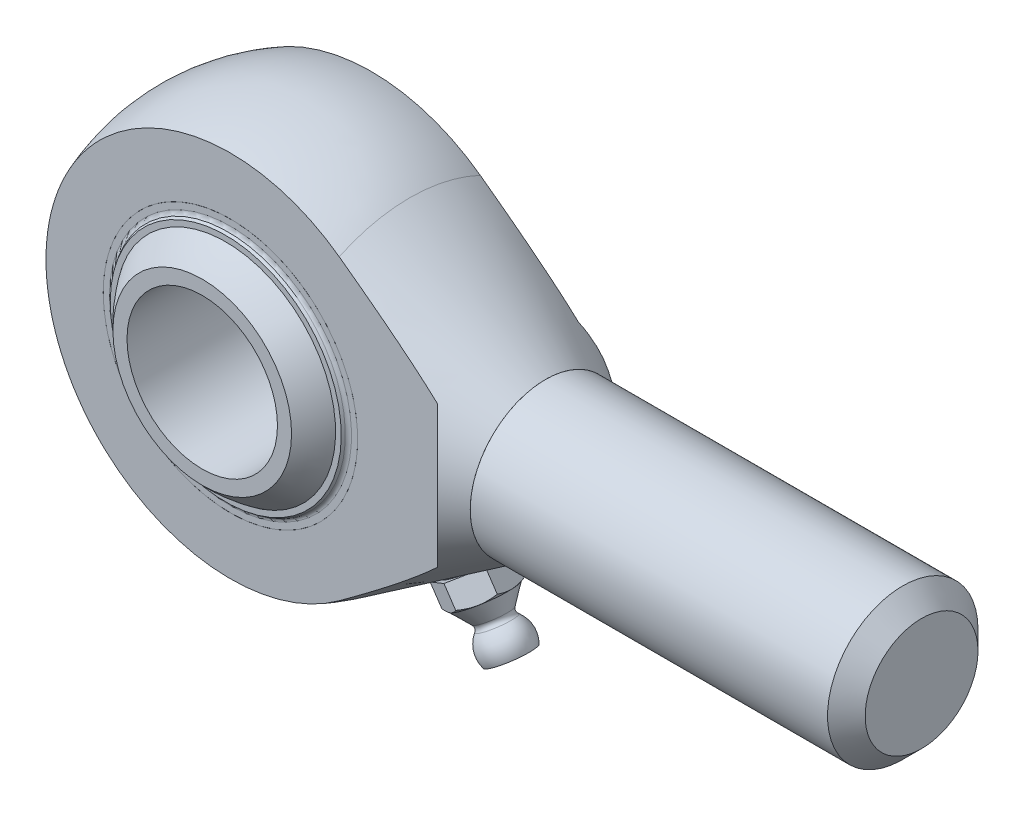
ISO-10303-21;
HEADER;
FILE_DESCRIPTION(('STEP AP214'),'2;1');
FILE_NAME('part.step','',(''),(''),'','','');
FILE_SCHEMA(('AUTOMOTIVE_DESIGN { 1 0 10303 214 1 1 1 1 }'));
ENDSEC;
DATA;
#1=APPLICATION_CONTEXT('core data for automotive mechanical design processes');
#2=APPLICATION_PROTOCOL_DEFINITION('international standard','automotive_design',2000,#1);
#3=PRODUCT_CONTEXT('',#1,'mechanical');
#4=PRODUCT('Part','Part','',(#3));
#5=PRODUCT_RELATED_PRODUCT_CATEGORY('part','',(#4));
#6=PRODUCT_DEFINITION_FORMATION('','',#4);
#7=PRODUCT_DEFINITION_CONTEXT('part definition',#1,'design');
#8=PRODUCT_DEFINITION('design','',#6,#7);
#9=PRODUCT_DEFINITION_SHAPE('','',#8);
#10=(LENGTH_UNIT() NAMED_UNIT(*) SI_UNIT(.MILLI.,.METRE.));
#11=(NAMED_UNIT(*) PLANE_ANGLE_UNIT() SI_UNIT($,.RADIAN.));
#12=(NAMED_UNIT(*) SI_UNIT($,.STERADIAN.) SOLID_ANGLE_UNIT());
#13=UNCERTAINTY_MEASURE_WITH_UNIT(LENGTH_MEASURE(1.E-05),#10,'distance_accuracy_value','');
#14=(GEOMETRIC_REPRESENTATION_CONTEXT(3) GLOBAL_UNCERTAINTY_ASSIGNED_CONTEXT((#13)) GLOBAL_UNIT_ASSIGNED_CONTEXT((#10,
#11,#12)) REPRESENTATION_CONTEXT('',''));
#15=CARTESIAN_POINT('',(0.,0.,0.));
#16=DIRECTION('',(0.,0.,1.));
#17=DIRECTION('',(1.,0.,0.));
#18=AXIS2_PLACEMENT_3D('',#15,#16,#17);
#19=CARTESIAN_POINT('',(-4.60079476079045,-14.1597902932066,2.09244005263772));
#20=DIRECTION('',(0.306009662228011,0.941800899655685,-0.139173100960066));
#21=DIRECTION('',(0.0430068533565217,0.132361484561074,0.99026806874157));
#22=AXIS2_PLACEMENT_3D('',#19,#20,#21);
#23=SPHERICAL_SURFACE('',#22,1.75);
#24=CARTESIAN_POINT('',(-4.06527785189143,-12.5116387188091,1.84888712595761));
#25=VERTEX_POINT('',#24);
#26=VERTEX_LOOP('',#25);
#27=FACE_BOUND('',#26,.T.);
#28=ADVANCED_FACE('P0_F12',(#27),#23,.T.);
#29=CLOSED_SHELL('',(#28));
#30=MANIFOLD_SOLID_BREP('P0_B1',#29);
#31=CARTESIAN_POINT('',(0.,14.8884845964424,2.09244005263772));
#32=DIRECTION('',(0.,-0.99026806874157,-0.139173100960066));
#33=DIRECTION('',(0.,-0.139173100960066,0.99026806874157));
#34=AXIS2_PLACEMENT_3D('',#31,#32,#33);
#35=SPHERICAL_SURFACE('',#34,1.75);
#36=CARTESIAN_POINT('',(0.,13.1555154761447,1.84888712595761));
#37=VERTEX_POINT('',#36);
#38=VERTEX_LOOP('',#37);
#39=FACE_BOUND('',#38,.T.);
#40=ADVANCED_FACE('P1_F12',(#39),#35,.T.);
#41=CLOSED_SHELL('',(#40));
#42=MANIFOLD_SOLID_BREP('P1_B1',#41);
#43=CARTESIAN_POINT('',(4.60079476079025,-14.1597902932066,-2.09244005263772));
#44=DIRECTION('',(-0.306009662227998,0.94180089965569,0.139173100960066));
#45=DIRECTION('',(-0.0430068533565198,0.132361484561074,-0.99026806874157));
#46=AXIS2_PLACEMENT_3D('',#43,#44,#45);
#47=SPHERICAL_SURFACE('',#46,1.75);
#48=CARTESIAN_POINT('',(4.06527785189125,-12.5116387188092,-1.84888712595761));
#49=VERTEX_POINT('',#48);
#50=VERTEX_LOOP('',#49);
#51=FACE_BOUND('',#50,.T.);
#52=ADVANCED_FACE('P2_F12',(#51),#47,.T.);
#53=CLOSED_SHELL('',(#52));
#54=MANIFOLD_SOLID_BREP('P2_B1',#53);
#55=CARTESIAN_POINT('',(0.,0.,0.));
#56=DIRECTION('',(0.,0.,1.));
#57=DIRECTION('',(0.999027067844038,0.044101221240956,0.));
#58=AXIS2_PLACEMENT_3D('',#55,#56,#57);
#59=CYLINDRICAL_SURFACE('',#58,13.535);
#60=CARTESIAN_POINT('',(0.,0.,-7.5));
#61=DIRECTION('',(0.,0.,1.));
#62=DIRECTION('',(0.999027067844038,0.044101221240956,0.));
#63=AXIS2_PLACEMENT_3D('',#60,#61,#62);
#64=CIRCLE('',#63,13.535);
#65=CARTESIAN_POINT('',(13.5218313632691,0.596910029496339,-7.5));
#66=VERTEX_POINT('',#65);
#67=EDGE_CURVE('P3_E34',#66,#66,#64,.T.);
#68=ORIENTED_EDGE('',*,*,#67,.T.);
#69=EDGE_LOOP('',(#68));
#70=FACE_BOUND('',#69,.T.);
#71=CARTESIAN_POINT('',(0.,0.,-7.));
#72=DIRECTION('',(0.,0.,1.));
#73=DIRECTION('',(0.999027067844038,0.044101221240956,0.));
#74=AXIS2_PLACEMENT_3D('',#71,#72,#73);
#75=CIRCLE('',#74,13.535);
#76=CARTESIAN_POINT('',(13.5218313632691,0.596910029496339,-7.));
#77=VERTEX_POINT('',#76);
#78=EDGE_CURVE('P3_E43',#77,#77,#75,.T.);
#79=ORIENTED_EDGE('',*,*,#78,.F.);
#80=EDGE_LOOP('',(#79));
#81=FACE_BOUND('',#80,.T.);
#82=ADVANCED_FACE('P3_F14',(#70,#81),#59,.T.);
#83=CARTESIAN_POINT('',(-0.596910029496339,13.5218313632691,-7.5));
#84=DIRECTION('',(0.,0.,-1.));
#85=DIRECTION('',(-0.999027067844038,-0.044101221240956,0.));
#86=AXIS2_PLACEMENT_3D('',#83,#84,#85);
#87=PLANE('',#86);
#88=CARTESIAN_POINT('',(0.,0.,-7.5));
#89=DIRECTION('',(0.,0.,-1.));
#90=DIRECTION('',(-0.999027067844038,-0.044101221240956,0.));
#91=AXIS2_PLACEMENT_3D('',#88,#89,#90);
#92=CIRCLE('',#91,12.8770934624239);
#93=CARTESIAN_POINT('',(-12.864564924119,-0.567895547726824,-7.5));
#94=VERTEX_POINT('',#93);
#95=EDGE_CURVE('P3_E21',#94,#94,#92,.F.);
#96=ORIENTED_EDGE('',*,*,#95,.T.);
#97=EDGE_LOOP('',(#96));
#98=FACE_BOUND('',#97,.T.);
#99=ORIENTED_EDGE('',*,*,#67,.F.);
#100=EDGE_LOOP('',(#99));
#101=FACE_BOUND('',#100,.T.);
#102=ADVANCED_FACE('P3_F50',(#98,#101),#87,.T.);
#103=CARTESIAN_POINT('',(0.,0.,0.));
#104=DIRECTION('',(0.,0.,1.));
#105=DIRECTION('',(-0.044101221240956,0.999027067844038,0.));
#106=AXIS2_PLACEMENT_3D('',#103,#104,#105);
#107=SPHERICAL_SURFACE('',#106,14.6598);
#108=CARTESIAN_POINT('',(0.,0.,-7.73614427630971));
#109=DIRECTION('',(0.,0.,1.));
#110=DIRECTION('',(0.999027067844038,0.044101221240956,0.));
#111=AXIS2_PLACEMENT_3D('',#108,#109,#110);
#112=CIRCLE('',#111,12.4523816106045);
#113=CARTESIAN_POINT('',(-0.54916523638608,12.4402662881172,-7.73614427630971));
#114=VERTEX_POINT('',#113);
#115=EDGE_CURVE('P3_E10',#114,#114,#112,.F.);
#116=CARTESIAN_POINT('',(0.,0.,-8.));
#117=DIRECTION('',(0.,0.,1.));
#118=DIRECTION('',(0.999027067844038,0.044101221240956,0.));
#119=AXIS2_PLACEMENT_3D('',#116,#117,#118);
#120=CIRCLE('',#119,12.284532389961);
#121=CARTESIAN_POINT('',(-0.541762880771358,12.2725803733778,-8.));
#122=VERTEX_POINT('',#121);
#123=EDGE_CURVE('P3_E37',#122,#122,#120,.T.);
#124=CARTESIAN_POINT('',(-0.54916523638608,12.4402662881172,-7.73614427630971));
#125=CARTESIAN_POINT('',(-0.549089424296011,12.4385489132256,-7.73891131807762));
#126=CARTESIAN_POINT('',(-0.549013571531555,12.4368306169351,-7.74167778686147));
#127=CARTESIAN_POINT('',(-0.548861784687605,12.4333921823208,-7.74720957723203));
#128=CARTESIAN_POINT('',(-0.548785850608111,12.431672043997,-7.74997489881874));
#129=CARTESIAN_POINT('',(-0.548633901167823,12.42822992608,-7.75550439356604));
#130=CARTESIAN_POINT('',(-0.548557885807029,12.426507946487,-7.75826856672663));
#131=CARTESIAN_POINT('',(-0.548405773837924,12.423062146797,-7.76379576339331));
#132=CARTESIAN_POINT('',(-0.548329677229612,12.4213383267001,-7.76655878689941));
#133=CARTESIAN_POINT('',(-0.548177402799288,12.4178888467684,-7.77208368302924));
#134=CARTESIAN_POINT('',(-0.548101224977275,12.4161631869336,-7.77484555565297));
#135=CARTESIAN_POINT('',(-0.547948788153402,12.4127100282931,-7.78036814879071));
#136=CARTESIAN_POINT('',(-0.547872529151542,12.4109825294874,-7.78312886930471));
#137=CARTESIAN_POINT('',(-0.547719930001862,12.4075256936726,-7.78864915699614));
#138=CARTESIAN_POINT('',(-0.547643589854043,12.4057963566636,-7.79140872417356));
#139=CARTESIAN_POINT('',(-0.54749082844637,12.4023358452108,-7.7969267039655));
#140=CARTESIAN_POINT('',(-0.547414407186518,12.400604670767,-7.79968511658));
#141=CARTESIAN_POINT('',(-0.547261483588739,12.397140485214,-7.80520078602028));
#142=CARTESIAN_POINT('',(-0.547184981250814,12.3954074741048,-7.80795804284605));
#143=CARTESIAN_POINT('',(-0.547031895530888,12.3919396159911,-7.81347139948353));
#144=CARTESIAN_POINT('',(-0.546955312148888,12.3902047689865,-7.81622749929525));
#145=CARTESIAN_POINT('',(-0.546802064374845,12.3867332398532,-7.82173854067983));
#146=CARTESIAN_POINT('',(-0.546725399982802,12.3849965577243,-7.8244934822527));
#147=CARTESIAN_POINT('',(-0.546571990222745,12.381521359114,-7.8300022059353));
#148=CARTESIAN_POINT('',(-0.54649524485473,12.3797828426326,-7.83275598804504));
#149=CARTESIAN_POINT('',(-0.546341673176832,12.3763039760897,-7.83826239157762));
#150=CARTESIAN_POINT('',(-0.54626484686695,12.3745636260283,-7.84101501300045));
#151=CARTESIAN_POINT('',(-0.546111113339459,12.3710810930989,-7.84651909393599));
#152=CARTESIAN_POINT('',(-0.54603420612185,12.3693389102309,-7.84927055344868));
#153=CARTESIAN_POINT('',(-0.545880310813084,12.3658527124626,-7.85477230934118));
#154=CARTESIAN_POINT('',(-0.545803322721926,12.3641086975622,-7.85752260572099));
#155=CARTESIAN_POINT('',(-0.545649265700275,12.3606188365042,-7.86302203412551));
#156=CARTESIAN_POINT('',(-0.545572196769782,12.3588729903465,-7.86577116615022));
#157=CARTESIAN_POINT('',(-0.545417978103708,12.3553794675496,-7.87126826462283));
#158=CARTESIAN_POINT('',(-0.545340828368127,12.3536317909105,-7.87401623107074));
#159=CARTESIAN_POINT('',(-0.545186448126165,12.3501346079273,-7.87951099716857));
#160=CARTESIAN_POINT('',(-0.545109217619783,12.3483851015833,-7.88225779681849));
#161=CARTESIAN_POINT('',(-0.544954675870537,12.3448842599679,-7.8877502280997));
#162=CARTESIAN_POINT('',(-0.544877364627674,12.3431329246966,-7.89049585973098));
#163=CARTESIAN_POINT('',(-0.544722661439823,12.3396284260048,-7.89598595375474));
#164=CARTESIAN_POINT('',(-0.544645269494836,12.3378752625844,-7.89873041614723));
#165=CARTESIAN_POINT('',(-0.544490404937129,12.3343671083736,-7.90421817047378));
#166=CARTESIAN_POINT('',(-0.54441293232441,12.3326121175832,-7.90696146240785));
#167=CARTESIAN_POINT('',(-0.544257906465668,12.3291003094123,-7.91244687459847));
#168=CARTESIAN_POINT('',(-0.544180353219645,12.3273434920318,-7.91518899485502));
#169=CARTESIAN_POINT('',(-0.544025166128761,12.3238280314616,-7.92067206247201));
#170=CARTESIAN_POINT('',(-0.5439475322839,12.3220693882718,-7.92341300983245));
#171=CARTESIAN_POINT('',(-0.543792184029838,12.3185502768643,-7.92889373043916));
#172=CARTESIAN_POINT('',(-0.543714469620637,12.3167898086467,-7.93163350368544));
#173=CARTESIAN_POINT('',(-0.543558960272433,12.313267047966,-7.93711187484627));
#174=CARTESIAN_POINT('',(-0.543481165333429,12.3115047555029,-7.93985047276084));
#175=CARTESIAN_POINT('',(-0.543325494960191,12.3079783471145,-7.94532649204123));
#176=CARTESIAN_POINT('',(-0.543247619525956,12.306214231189,-7.94806391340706));
#177=CARTESIAN_POINT('',(-0.543091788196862,12.3026841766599,-7.95353757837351));
#178=CARTESIAN_POINT('',(-0.543013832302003,12.3009182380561,-7.95627382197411));
#179=CARTESIAN_POINT('',(-0.542857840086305,12.2973845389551,-7.96174513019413));
#180=CARTESIAN_POINT('',(-0.542779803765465,12.2956167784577,-7.96448019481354));
#181=CARTESIAN_POINT('',(-0.542623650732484,12.2920794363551,-7.96994914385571));
#182=CARTESIAN_POINT('',(-0.542545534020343,12.2903098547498,-7.97268302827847));
#183=CARTESIAN_POINT('',(-0.542389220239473,12.2867688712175,-7.97814961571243));
#184=CARTESIAN_POINT('',(-0.542311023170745,12.2849974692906,-7.98088231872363));
#185=CARTESIAN_POINT('',(-0.54215454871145,12.2814528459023,-7.98634654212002));
#186=CARTESIAN_POINT('',(-0.542076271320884,12.279679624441,-7.98907806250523));
#187=CARTESIAN_POINT('',(-0.541919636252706,12.276131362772,-7.99453991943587));
#188=CARTESIAN_POINT('',(-0.541841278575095,12.2743563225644,-7.99727025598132));
#189=CARTESIAN_POINT('',(-0.541762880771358,12.2725803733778,-8.));
#190=B_SPLINE_CURVE_WITH_KNOTS('',3,(#124,#125,#126,#127,#128,#129,#130,#131,#132,#133,#134,
#135,#136,#137,#138,#139,#140,#141,#142,#143,#144,#145,#146,#147,#148,#149,#150,#151,#152,#153,
#154,#155,#156,#157,#158,#159,#160,#161,#162,#163,#164,#165,#166,#167,#168,#169,#170,#171,#172,
#173,#174,#175,#176,#177,#178,#179,#180,#181,#182,#183,#184,#185,#186,#187,#188,#189),
.UNSPECIFIED.,.F.,.F.,(4,2,2,2,2,2,2,2,2,2,2,2,2,2,2,2,2,2,2,2,2,2,2,2,2,2,2,2,2,2,2,2,4),(0.,
0.00977265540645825,0.0195453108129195,0.0293179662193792,0.039090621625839,0.0488632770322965,
0.0586359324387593,0.0684085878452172,0.078181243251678,0.0879538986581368,0.0977265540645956,
0.107499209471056,0.117271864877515,0.127044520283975,0.136817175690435,0.146589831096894,
0.156362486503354,0.166135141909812,0.175907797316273,0.185680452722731,0.195453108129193,
0.205225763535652,0.214998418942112,0.224771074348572,0.234543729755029,0.244316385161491,
0.254089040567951,0.263861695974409,0.273634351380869,0.28340700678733,0.293179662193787,
0.302952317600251,0.312724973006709),.UNSPECIFIED.);
#191=EDGE_CURVE('P3_BSEAM57',#114,#122,#190,.T.);
#192=ORIENTED_EDGE('',*,*,#115,.T.);
#193=ORIENTED_EDGE('',*,*,#123,.T.);
#194=ORIENTED_EDGE('',*,*,#191,.T.);
#195=ORIENTED_EDGE('',*,*,#191,.F.);
#196=EDGE_LOOP('',(#192,#194,#193,#195));
#197=FACE_BOUND('',#196,.T.);
#198=ADVANCED_FACE('P3_F57',(#197),#107,.T.);
#199=CARTESIAN_POINT('',(-0.51524862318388,11.6719516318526,-8.));
#200=DIRECTION('',(0.,0.,-1.));
#201=DIRECTION('',(-0.999027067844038,-0.044101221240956,0.));
#202=AXIS2_PLACEMENT_3D('',#199,#200,#201);
#203=PLANE('',#202);
#204=CARTESIAN_POINT('',(0.,0.,-8.));
#205=DIRECTION('',(0.,0.,1.));
#206=DIRECTION('',(0.999027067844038,0.044101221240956,0.));
#207=AXIS2_PLACEMENT_3D('',#204,#205,#206);
#208=CIRCLE('',#207,11.6833187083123);
#209=CARTESIAN_POINT('',(-0.51524862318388,11.6719516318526,-8.));
#210=VERTEX_POINT('',#209);
#211=EDGE_CURVE('P3_E40',#210,#210,#208,.T.);
#212=ORIENTED_EDGE('',*,*,#211,.T.);
#213=EDGE_LOOP('',(#212));
#214=FACE_BOUND('',#213,.T.);
#215=ORIENTED_EDGE('',*,*,#123,.F.);
#216=EDGE_LOOP('',(#215));
#217=FACE_BOUND('',#216,.T.);
#218=ADVANCED_FACE('P3_F77',(#214,#217),#203,.T.);
#219=CARTESIAN_POINT('',(0.,0.,0.));
#220=DIRECTION('',(0.,0.,1.));
#221=DIRECTION('',(-0.044101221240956,0.999027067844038,0.));
#222=AXIS2_PLACEMENT_3D('',#219,#220,#221);
#223=SPHERICAL_SURFACE('',#222,14.1598);
#224=CARTESIAN_POINT('',(0.,0.,-7.24419842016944));
#225=DIRECTION('',(0.,0.,1.));
#226=DIRECTION('',(0.999027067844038,0.044101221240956,0.));
#227=AXIS2_PLACEMENT_3D('',#224,#225,#226);
#228=CIRCLE('',#227,12.1664097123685);
#229=CARTESIAN_POINT('',(-0.536553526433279,12.1545726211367,-7.24419842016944));
#230=VERTEX_POINT('',#229);
#231=EDGE_CURVE('P3_E29',#230,#230,#228,.T.);
#232=CARTESIAN_POINT('',(-0.536553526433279,12.1545726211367,-7.24419842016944));
#233=CARTESIAN_POINT('',(-0.536342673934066,12.149796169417,-7.25222813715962));
#234=CARTESIAN_POINT('',(-0.536131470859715,12.145011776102,-7.26025312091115));
#235=CARTESIAN_POINT('',(-0.535708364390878,12.1354271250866,-7.27629359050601));
#236=CARTESIAN_POINT('',(-0.535496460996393,12.1306268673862,-7.28430907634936));
#237=CARTESIAN_POINT('',(-0.53507195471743,12.1210105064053,-7.30033051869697));
#238=CARTESIAN_POINT('',(-0.534859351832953,12.1161944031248,-7.30833647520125));
#239=CARTESIAN_POINT('',(-0.534433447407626,12.1065463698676,-7.32433882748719));
#240=CARTESIAN_POINT('',(-0.534220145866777,12.1017144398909,-7.33233522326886));
#241=CARTESIAN_POINT('',(-0.533792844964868,12.0920347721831,-7.34831842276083));
#242=CARTESIAN_POINT('',(-0.533578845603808,12.0871870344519,-7.35630522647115));
#243=CARTESIAN_POINT('',(-0.533150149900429,12.0774757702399,-7.37226921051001));
#244=CARTESIAN_POINT('',(-0.532935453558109,12.072612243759,-7.38024639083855));
#245=CARTESIAN_POINT('',(-0.532505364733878,12.0628694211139,-7.39619109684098));
#246=CARTESIAN_POINT('',(-0.532289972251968,12.0579901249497,-7.40415862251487));
#247=CARTESIAN_POINT('',(-0.531858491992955,12.0482157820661,-7.42008398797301));
#248=CARTESIAN_POINT('',(-0.531642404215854,12.0433207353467,-7.42804182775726));
#249=CARTESIAN_POINT('',(-0.531209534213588,12.033514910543,-7.44394779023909));
#250=CARTESIAN_POINT('',(-0.530992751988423,12.0286041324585,-7.45189591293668));
#251=CARTESIAN_POINT('',(-0.530558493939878,12.0187668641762,-7.46778241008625));
#252=CARTESIAN_POINT('',(-0.530341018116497,12.0138403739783,-7.47572078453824));
#253=CARTESIAN_POINT('',(-0.529905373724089,12.0039717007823,-7.49158775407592));
#254=CARTESIAN_POINT('',(-0.529687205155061,11.9990295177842,-7.4995163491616));
#255=CARTESIAN_POINT('',(-0.529250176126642,11.9891294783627,-7.51536372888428));
#256=CARTESIAN_POINT('',(-0.529031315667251,11.9841716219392,-7.52328251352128));
#257=CARTESIAN_POINT('',(-0.5285929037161,11.9742402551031,-7.53911024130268));
#258=CARTESIAN_POINT('',(-0.528373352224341,11.9692667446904,-7.54701918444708));
#259=CARTESIAN_POINT('',(-0.52793355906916,11.9593040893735,-7.56282719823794));
#260=CARTESIAN_POINT('',(-0.527713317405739,11.9543149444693,-7.5707262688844));
#261=CARTESIAN_POINT('',(-0.527272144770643,11.9443210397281,-7.58651450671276));
#262=CARTESIAN_POINT('',(-0.52705121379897,11.9393162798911,-7.59440367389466));
#263=CARTESIAN_POINT('',(-0.526608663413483,11.9292911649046,-7.61017207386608));
#264=CARTESIAN_POINT('',(-0.526387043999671,11.9242708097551,-7.6180513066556));
#265=CARTESIAN_POINT('',(-0.525943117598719,11.9142145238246,-7.63379980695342));
#266=CARTESIAN_POINT('',(-0.525720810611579,11.9091785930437,-7.64166907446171));
#267=CARTESIAN_POINT('',(-0.525275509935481,11.8990911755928,-7.65739761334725));
#268=CARTESIAN_POINT('',(-0.525052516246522,11.8940396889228,-7.66525688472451));
#269=CARTESIAN_POINT('',(-0.524605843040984,11.8839211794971,-7.68096540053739));
#270=CARTESIAN_POINT('',(-0.524382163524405,11.8788541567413,-7.68881464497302));
#271=CARTESIAN_POINT('',(-0.523934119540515,11.8687045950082,-7.70450307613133));
#272=CARTESIAN_POINT('',(-0.523709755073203,11.8636220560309,-7.71234226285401));
#273=CARTESIAN_POINT('',(-0.523260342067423,11.8534414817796,-7.72801054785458));
#274=CARTESIAN_POINT('',(-0.523035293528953,11.8483434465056,-7.73583964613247));
#275=CARTESIAN_POINT('',(-0.52258451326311,11.838131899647,-7.75148772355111));
#276=CARTESIAN_POINT('',(-0.522358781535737,11.8330183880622,-7.75930670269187));
#277=CARTESIAN_POINT('',(-0.52190663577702,11.8227759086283,-7.77493451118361));
#278=CARTESIAN_POINT('',(-0.521680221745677,11.8176469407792,-7.7827433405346));
#279=CARTESIAN_POINT('',(-0.521226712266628,11.8073735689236,-7.79835081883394));
#280=CARTESIAN_POINT('',(-0.520999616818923,11.8022291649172,-7.80614946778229));
#281=CARTESIAN_POINT('',(-0.520544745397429,11.7919249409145,-7.8217365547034));
#282=CARTESIAN_POINT('',(-0.520316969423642,11.7867651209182,-7.82952499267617));
#283=CARTESIAN_POINT('',(-0.519860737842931,11.7764300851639,-7.84509162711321));
#284=CARTESIAN_POINT('',(-0.519632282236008,11.7712548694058,-7.85286982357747));
#285=CARTESIAN_POINT('',(-0.519174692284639,11.7608890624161,-7.86841594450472));
#286=CARTESIAN_POINT('',(-0.518945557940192,11.7556984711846,-7.87618386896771));
#287=CARTESIAN_POINT('',(-0.518486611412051,11.7453019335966,-7.89170941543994));
#288=CARTESIAN_POINT('',(-0.518256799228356,11.7400959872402,-7.89946703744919));
#289=CARTESIAN_POINT('',(-0.517796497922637,11.7296687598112,-7.91497194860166));
#290=CARTESIAN_POINT('',(-0.517566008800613,11.7244474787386,-7.92271923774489));
#291=CARTESIAN_POINT('',(-0.517104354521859,11.7139896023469,-7.93820345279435));
#292=CARTESIAN_POINT('',(-0.51687318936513,11.7087530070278,-7.94594037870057));
#293=CARTESIAN_POINT('',(-0.51641018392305,11.6982645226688,-7.96140383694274));
#294=CARTESIAN_POINT('',(-0.516178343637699,11.6930126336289,-7.96913036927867));
#295=CARTESIAN_POINT('',(-0.515713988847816,11.6824935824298,-7.98457301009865));
#296=CARTESIAN_POINT('',(-0.515481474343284,11.6772264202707,-7.9922891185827));
#297=CARTESIAN_POINT('',(-0.51524862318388,11.6719516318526,-8.));
#298=B_SPLINE_CURVE_WITH_KNOTS('',3,(#232,#233,#234,#235,#236,#237,#238,#239,#240,#241,#242,
#243,#244,#245,#246,#247,#248,#249,#250,#251,#252,#253,#254,#255,#256,#257,#258,#259,#260,#261,
#262,#263,#264,#265,#266,#267,#268,#269,#270,#271,#272,#273,#274,#275,#276,#277,#278,#279,#280,
#281,#282,#283,#284,#285,#286,#287,#288,#289,#290,#291,#292,#293,#294,#295,#296,#297),
.UNSPECIFIED.,.F.,.F.,(4,2,2,2,2,2,2,2,2,2,2,2,2,2,2,2,2,2,2,2,2,2,2,2,2,2,2,2,2,2,2,2,4),(0.,
0.0280360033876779,0.056072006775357,0.0841080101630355,0.112144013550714,0.140180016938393,
0.168216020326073,0.19625202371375,0.224288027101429,0.252324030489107,0.280360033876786,
0.308396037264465,0.336432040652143,0.364468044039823,0.3925040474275,0.420540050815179,
0.448576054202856,0.476612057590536,0.504648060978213,0.532684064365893,0.560720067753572,
0.58875607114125,0.616792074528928,0.644828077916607,0.672864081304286,0.700900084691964,
0.728936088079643,0.756972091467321,0.785008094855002,0.813044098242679,0.841080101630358,
0.869116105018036,0.897152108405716),.UNSPECIFIED.);
#299=EDGE_CURVE('P3_BSEAM68',#230,#210,#298,.T.);
#300=ORIENTED_EDGE('',*,*,#231,.T.);
#301=ORIENTED_EDGE('',*,*,#211,.F.);
#302=ORIENTED_EDGE('',*,*,#299,.T.);
#303=ORIENTED_EDGE('',*,*,#299,.F.);
#304=EDGE_LOOP('',(#300,#302,#301,#303));
#305=FACE_BOUND('',#304,.T.);
#306=ADVANCED_FACE('P3_F68',(#305),#223,.F.);
#307=CARTESIAN_POINT('',(-0.596910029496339,13.5218313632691,-7.));
#308=DIRECTION('',(0.,0.,1.));
#309=DIRECTION('',(0.999027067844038,0.044101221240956,0.));
#310=AXIS2_PLACEMENT_3D('',#307,#308,#309);
#311=PLANE('',#310);
#312=CARTESIAN_POINT('',(0.,0.,-7.));
#313=DIRECTION('',(0.,0.,1.));
#314=DIRECTION('',(0.999027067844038,0.044101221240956,0.));
#315=AXIS2_PLACEMENT_3D('',#312,#313,#314);
#316=CIRCLE('',#315,12.5960206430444);
#317=CARTESIAN_POINT('',(12.5837655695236,0.555499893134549,-7.));
#318=VERTEX_POINT('',#317);
#319=EDGE_CURVE('P3_E25',#318,#318,#316,.F.);
#320=ORIENTED_EDGE('',*,*,#319,.T.);
#321=EDGE_LOOP('',(#320));
#322=FACE_BOUND('',#321,.T.);
#323=ORIENTED_EDGE('',*,*,#78,.T.);
#324=EDGE_LOOP('',(#323));
#325=FACE_BOUND('',#324,.T.);
#326=ADVANCED_FACE('P3_F47',(#322,#325),#311,.T.);
#327=CARTESIAN_POINT('',(0.,0.,-7.5));
#328=DIRECTION('',(0.,0.,1.));
#329=DIRECTION('',(0.999027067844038,0.044101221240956,0.));
#330=AXIS2_PLACEMENT_3D('',#327,#328,#329);
#331=TOROIDAL_SURFACE('',#330,12.5960206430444,0.5);
#332=ORIENTED_EDGE('',*,*,#319,.F.);
#333=EDGE_LOOP('',(#332));
#334=FACE_BOUND('',#333,.T.);
#335=ORIENTED_EDGE('',*,*,#231,.F.);
#336=EDGE_LOOP('',(#335));
#337=FACE_BOUND('',#336,.T.);
#338=ADVANCED_FACE('P3_F60',(#334,#337),#331,.T.);
#339=CARTESIAN_POINT('',(0.,0.,-8.));
#340=DIRECTION('',(0.,0.,-1.));
#341=DIRECTION('',(-0.999027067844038,-0.044101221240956,0.));
#342=AXIS2_PLACEMENT_3D('',#339,#340,#341);
#343=TOROIDAL_SURFACE('',#342,12.8770934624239,0.5);
#344=ORIENTED_EDGE('',*,*,#115,.F.);
#345=EDGE_LOOP('',(#344));
#346=FACE_BOUND('',#345,.T.);
#347=ORIENTED_EDGE('',*,*,#95,.F.);
#348=EDGE_LOOP('',(#347));
#349=FACE_BOUND('',#348,.T.);
#350=ADVANCED_FACE('P3_F16',(#346,#349),#343,.F.);
#351=CLOSED_SHELL('',(#82,#102,#198,#218,#306,#326,#338,#350));
#352=MANIFOLD_SOLID_BREP('P3_B1',#351);
#353=CARTESIAN_POINT('',(-8.75123167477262,-12.0450370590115,2.09244005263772));
#354=DIRECTION('',(0.582064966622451,0.801143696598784,-0.139173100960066));
#355=DIRECTION('',(0.0818038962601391,0.112593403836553,0.99026806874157));
#356=AXIS2_PLACEMENT_3D('',#353,#354,#355);
#357=SPHERICAL_SURFACE('',#356,1.75);
#358=CARTESIAN_POINT('',(-7.73261798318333,-10.6430355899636,1.84888712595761));
#359=VERTEX_POINT('',#358);
#360=VERTEX_LOOP('',#359);
#361=FACE_BOUND('',#360,.T.);
#362=ADVANCED_FACE('P4_F12',(#361),#357,.T.);
#363=CLOSED_SHELL('',(#362));
#364=MANIFOLD_SOLID_BREP('P4_B1',#363);
#365=CARTESIAN_POINT('',(4.60079476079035,14.1597902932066,2.09244005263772));
#366=DIRECTION('',(-0.306009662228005,-0.941800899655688,-0.139173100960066));
#367=DIRECTION('',(-0.0430068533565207,-0.132361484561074,0.99026806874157));
#368=AXIS2_PLACEMENT_3D('',#365,#366,#367);
#369=SPHERICAL_SURFACE('',#368,1.75);
#370=CARTESIAN_POINT('',(4.06527785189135,12.5116387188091,1.84888712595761));
#371=VERTEX_POINT('',#370);
#372=VERTEX_LOOP('',#371);
#373=FACE_BOUND('',#372,.T.);
#374=ADVANCED_FACE('P5_F12',(#373),#369,.T.);
#375=CLOSED_SHELL('',(#374));
#376=MANIFOLD_SOLID_BREP('P5_B1',#375);
#377=CARTESIAN_POINT('',(-1.03965792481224E-13,-14.8884845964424,-2.09244005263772));
#378=DIRECTION('',(0.,0.99026806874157,0.139173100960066));
#379=DIRECTION('',(0.,0.139173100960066,-0.99026806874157));
#380=AXIS2_PLACEMENT_3D('',#377,#378,#379);
#381=SPHERICAL_SURFACE('',#380,1.75);
#382=CARTESIAN_POINT('',(0.,-13.1555154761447,-1.84888712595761));
#383=VERTEX_POINT('',#382);
#384=VERTEX_LOOP('',#383);
#385=FACE_BOUND('',#384,.T.);
#386=ADVANCED_FACE('P6_F12',(#385),#381,.T.);
#387=CLOSED_SHELL('',(#386));
#388=MANIFOLD_SOLID_BREP('P6_B1',#387);
#389=CARTESIAN_POINT('',(-12.0450370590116,-8.7512316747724,2.09244005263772));
#390=DIRECTION('',(0.801143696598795,0.582064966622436,-0.139173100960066));
#391=DIRECTION('',(0.112593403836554,0.081803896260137,0.99026806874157));
#392=AXIS2_PLACEMENT_3D('',#389,#390,#391);
#393=SPHERICAL_SURFACE('',#392,1.75);
#394=CARTESIAN_POINT('',(-10.6430355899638,-7.73261798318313,1.84888712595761));
#395=VERTEX_POINT('',#394);
#396=VERTEX_LOOP('',#395);
#397=FACE_BOUND('',#396,.T.);
#398=ADVANCED_FACE('P7_F12',(#397),#393,.T.);
#399=CLOSED_SHELL('',(#398));
#400=MANIFOLD_SOLID_BREP('P7_B1',#399);
#401=CARTESIAN_POINT('',(8.75123167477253,12.0450370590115,2.09244005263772));
#402=DIRECTION('',(-0.582064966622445,-0.801143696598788,-0.139173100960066));
#403=DIRECTION('',(-0.0818038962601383,-0.112593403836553,0.99026806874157));
#404=AXIS2_PLACEMENT_3D('',#401,#402,#403);
#405=SPHERICAL_SURFACE('',#404,1.75);
#406=CARTESIAN_POINT('',(7.73261798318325,10.6430355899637,1.84888712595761));
#407=VERTEX_POINT('',#406);
#408=VERTEX_LOOP('',#407);
#409=FACE_BOUND('',#408,.T.);
#410=ADVANCED_FACE('P8_F12',(#409),#405,.T.);
#411=CLOSED_SHELL('',(#410));
#412=MANIFOLD_SOLID_BREP('P8_B1',#411);
#413=CARTESIAN_POINT('',(-4.60079476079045,-14.1597902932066,-2.09244005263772));
#414=DIRECTION('',(0.306009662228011,0.941800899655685,0.139173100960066));
#415=DIRECTION('',(0.0430068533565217,0.132361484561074,-0.99026806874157));
#416=AXIS2_PLACEMENT_3D('',#413,#414,#415);
#417=SPHERICAL_SURFACE('',#416,1.75);
#418=CARTESIAN_POINT('',(-4.06527785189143,-12.5116387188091,-1.84888712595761));
#419=VERTEX_POINT('',#418);
#420=VERTEX_LOOP('',#419);
#421=FACE_BOUND('',#420,.T.);
#422=ADVANCED_FACE('P9_F12',(#421),#417,.T.);
#423=CLOSED_SHELL('',(#422));
#424=MANIFOLD_SOLID_BREP('P9_B1',#423);
#425=CARTESIAN_POINT('',(0.,0.,0.));
#426=DIRECTION('',(0.,1.,0.));
#427=DIRECTION('',(1.,0.,0.));
#428=AXIS2_PLACEMENT_3D('',#425,#426,#427);
#429=SPHERICAL_SURFACE('',#428,14.1598022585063);
#430=CARTESIAN_POINT('',(0.,0.,0.));
#431=DIRECTION('',(0.,0.,1.));
#432=DIRECTION('',(1.,0.,0.));
#433=AXIS2_PLACEMENT_3D('',#430,#431,#432);
#434=SPHERICAL_SURFACE('',#433,14.1598022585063);
#435=CARTESIAN_POINT('',(0.,0.,3.41453606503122));
#436=DIRECTION('',(0.,0.,1.));
#437=DIRECTION('',(1.,0.,0.));
#438=AXIS2_PLACEMENT_3D('',#435,#436,#437);
#439=CIRCLE('',#438,13.7419410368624);
#440=CARTESIAN_POINT('',(13.7419410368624,0.,3.41453606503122));
#441=VERTEX_POINT('',#440);
#442=EDGE_CURVE('P10_E18',#441,#441,#439,.F.);
#443=ORIENTED_EDGE('',*,*,#442,.F.);
#444=EDGE_LOOP('',(#443));
#445=FACE_BOUND('',#444,.T.);
#446=CARTESIAN_POINT('',(0.,0.,10.5));
#447=DIRECTION('',(0.,0.,-1.));
#448=DIRECTION('',(-1.,0.,0.));
#449=AXIS2_PLACEMENT_3D('',#446,#447,#448);
#450=CIRCLE('',#449,9.5);
#451=CARTESIAN_POINT('',(-9.5,0.,10.5));
#452=VERTEX_POINT('',#451);
#453=EDGE_CURVE('P10_E27',#452,#452,#450,.F.);
#454=ORIENTED_EDGE('',*,*,#453,.F.);
#455=EDGE_LOOP('',(#454));
#456=FACE_BOUND('',#455,.T.);
#457=ADVANCED_FACE('P10_F14',(#445,#456),#434,.T.);
#458=CARTESIAN_POINT('',(0.,0.,0.));
#459=DIRECTION('',(0.,0.,-1.));
#460=DIRECTION('',(-1.,0.,0.));
#461=AXIS2_PLACEMENT_3D('',#458,#459,#460);
#462=SPHERICAL_SURFACE('',#461,14.1598022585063);
#463=CARTESIAN_POINT('',(0.,0.,-3.41453606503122));
#464=DIRECTION('',(0.,0.,-1.));
#465=DIRECTION('',(-1.,0.,0.));
#466=AXIS2_PLACEMENT_3D('',#463,#464,#465);
#467=CIRCLE('',#466,13.7419410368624);
#468=CARTESIAN_POINT('',(-13.7419410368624,0.,-3.41453606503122));
#469=VERTEX_POINT('',#468);
#470=EDGE_CURVE('P10_E34',#469,#469,#467,.F.);
#471=ORIENTED_EDGE('',*,*,#470,.F.);
#472=EDGE_LOOP('',(#471));
#473=FACE_BOUND('',#472,.T.);
#474=CARTESIAN_POINT('',(0.,0.,-10.5));
#475=DIRECTION('',(0.,0.,1.));
#476=DIRECTION('',(1.,0.,0.));
#477=AXIS2_PLACEMENT_3D('',#474,#475,#476);
#478=CIRCLE('',#477,9.5);
#479=CARTESIAN_POINT('',(9.5,0.,-10.5));
#480=VERTEX_POINT('',#479);
#481=EDGE_CURVE('P10_E10',#480,#480,#478,.F.);
#482=ORIENTED_EDGE('',*,*,#481,.F.);
#483=EDGE_LOOP('',(#482));
#484=FACE_BOUND('',#483,.T.);
#485=ADVANCED_FACE('P10_F50',(#473,#484),#462,.T.);
#486=CARTESIAN_POINT('',(0.,0.,0.));
#487=DIRECTION('',(0.,0.,-1.));
#488=DIRECTION('',(-1.,0.,0.));
#489=AXIS2_PLACEMENT_3D('',#486,#487,#488);
#490=SPHERICAL_SURFACE('',#489,14.1598022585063);
#491=CARTESIAN_POINT('',(0.,0.,0.505529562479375));
#492=DIRECTION('',(0.,0.,-1.));
#493=DIRECTION('',(-1.,0.,0.));
#494=AXIS2_PLACEMENT_3D('',#491,#492,#493);
#495=CIRCLE('',#494,14.1507752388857);
#496=CARTESIAN_POINT('',(-14.1507752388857,0.,0.505529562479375));
#497=VERTEX_POINT('',#496);
#498=EDGE_CURVE('P10_E39',#497,#497,#495,.F.);
#499=ORIENTED_EDGE('',*,*,#498,.F.);
#500=EDGE_LOOP('',(#499));
#501=FACE_BOUND('',#500,.T.);
#502=CARTESIAN_POINT('',(0.,0.,-0.505529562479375));
#503=DIRECTION('',(0.,0.,1.));
#504=DIRECTION('',(1.,0.,0.));
#505=AXIS2_PLACEMENT_3D('',#502,#503,#504);
#506=CIRCLE('',#505,14.1507752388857);
#507=CARTESIAN_POINT('',(14.1507752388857,0.,-0.505529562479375));
#508=VERTEX_POINT('',#507);
#509=EDGE_CURVE('P10_E35',#508,#508,#506,.F.);
#510=ORIENTED_EDGE('',*,*,#509,.F.);
#511=EDGE_LOOP('',(#510));
#512=FACE_BOUND('',#511,.T.);
#513=ADVANCED_FACE('P10_F16',(#501,#512),#490,.T.);
#514=CARTESIAN_POINT('',(0.,0.,-14.1598022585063));
#515=DIRECTION('',(0.,0.,1.));
#516=DIRECTION('',(1.,0.,0.));
#517=AXIS2_PLACEMENT_3D('',#514,#515,#516);
#518=CYLINDRICAL_SURFACE('',#517,8.);
#519=CARTESIAN_POINT('',(0.,0.,10.5));
#520=DIRECTION('',(0.,0.,-1.));
#521=DIRECTION('',(-1.,0.,0.));
#522=AXIS2_PLACEMENT_3D('',#519,#520,#521);
#523=CIRCLE('',#522,8.);
#524=CARTESIAN_POINT('',(-8.,0.,10.5));
#525=VERTEX_POINT('',#524);
#526=EDGE_CURVE('P10_E31',#525,#525,#523,.F.);
#527=ORIENTED_EDGE('',*,*,#526,.T.);
#528=EDGE_LOOP('',(#527));
#529=FACE_BOUND('',#528,.T.);
#530=CARTESIAN_POINT('',(0.,0.,-10.5));
#531=DIRECTION('',(0.,0.,1.));
#532=DIRECTION('',(1.,0.,0.));
#533=AXIS2_PLACEMENT_3D('',#530,#531,#532);
#534=CIRCLE('',#533,8.);
#535=CARTESIAN_POINT('',(8.,0.,-10.5));
#536=VERTEX_POINT('',#535);
#537=EDGE_CURVE('P10_E22',#536,#536,#534,.F.);
#538=ORIENTED_EDGE('',*,*,#537,.T.);
#539=EDGE_LOOP('',(#538));
#540=FACE_BOUND('',#539,.T.);
#541=ADVANCED_FACE('P10_F62',(#529,#540),#518,.F.);
#542=CARTESIAN_POINT('',(-14.1598022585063,-14.1598022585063,-10.5));
#543=DIRECTION('',(0.,0.,1.));
#544=DIRECTION('',(1.,0.,0.));
#545=AXIS2_PLACEMENT_3D('',#542,#543,#544);
#546=PLANE('',#545);
#547=ORIENTED_EDGE('',*,*,#481,.T.);
#548=EDGE_LOOP('',(#547));
#549=FACE_BOUND('',#548,.T.);
#550=ORIENTED_EDGE('',*,*,#537,.F.);
#551=EDGE_LOOP('',(#550));
#552=FACE_BOUND('',#551,.T.);
#553=ADVANCED_FACE('P10_F58',(#549,#552),#546,.F.);
#554=CARTESIAN_POINT('',(-14.1598022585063,-14.1598022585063,10.5));
#555=DIRECTION('',(0.,0.,-1.));
#556=DIRECTION('',(-1.,0.,0.));
#557=AXIS2_PLACEMENT_3D('',#554,#555,#556);
#558=PLANE('',#557);
#559=ORIENTED_EDGE('',*,*,#453,.T.);
#560=EDGE_LOOP('',(#559));
#561=FACE_BOUND('',#560,.T.);
#562=ORIENTED_EDGE('',*,*,#526,.F.);
#563=EDGE_LOOP('',(#562));
#564=FACE_BOUND('',#563,.T.);
#565=ADVANCED_FACE('P10_F54',(#561,#564),#558,.F.);
#566=CARTESIAN_POINT('',(0.,0.,-2.09244005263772));
#567=DIRECTION('',(0.,0.,-1.));
#568=DIRECTION('',(-1.,0.,0.));
#569=AXIS2_PLACEMENT_3D('',#566,#567,#568);
#570=TOROIDAL_SURFACE('',#569,14.8884845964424,1.75);
#571=ORIENTED_EDGE('',*,*,#470,.T.);
#572=EDGE_LOOP('',(#571));
#573=FACE_BOUND('',#572,.T.);
#574=ORIENTED_EDGE('',*,*,#509,.T.);
#575=EDGE_LOOP('',(#574));
#576=FACE_BOUND('',#575,.T.);
#577=ADVANCED_FACE('P10_F57',(#573,#576),#570,.F.);
#578=CARTESIAN_POINT('',(0.,0.,2.09244005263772));
#579=DIRECTION('',(0.,0.,-1.));
#580=DIRECTION('',(-1.,0.,0.));
#581=AXIS2_PLACEMENT_3D('',#578,#579,#580);
#582=TOROIDAL_SURFACE('',#581,14.8884845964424,1.75);
#583=ORIENTED_EDGE('',*,*,#442,.T.);
#584=EDGE_LOOP('',(#583));
#585=FACE_BOUND('',#584,.T.);
#586=ORIENTED_EDGE('',*,*,#498,.T.);
#587=EDGE_LOOP('',(#586));
#588=FACE_BOUND('',#587,.T.);
#589=ADVANCED_FACE('P10_F46',(#585,#588),#582,.F.);
#590=CLOSED_SHELL('',(#457,#485,#513,#541,#553,#565,#577,#589));
#591=MANIFOLD_SOLID_BREP('P10_B1',#590);
#592=CARTESIAN_POINT('',(-14.1597902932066,-4.60079476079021,2.09244005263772));
#593=DIRECTION('',(0.94180089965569,0.306009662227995,-0.139173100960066));
#594=DIRECTION('',(0.132361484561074,0.0430068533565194,0.99026806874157));
#595=AXIS2_PLACEMENT_3D('',#592,#593,#594);
#596=SPHERICAL_SURFACE('',#595,1.75);
#597=CARTESIAN_POINT('',(-12.5116387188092,-4.06527785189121,1.84888712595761));
#598=VERTEX_POINT('',#597);
#599=VERTEX_LOOP('',#598);
#600=FACE_BOUND('',#599,.T.);
#601=ADVANCED_FACE('P11_F12',(#600),#596,.T.);
#602=CLOSED_SHELL('',(#601));
#603=MANIFOLD_SOLID_BREP('P11_B1',#602);
#604=CARTESIAN_POINT('',(12.0450370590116,8.75123167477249,2.09244005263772));
#605=DIRECTION('',(-0.80114369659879,-0.582064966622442,-0.139173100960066));
#606=DIRECTION('',(-0.112593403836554,-0.0818038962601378,0.99026806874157));
#607=AXIS2_PLACEMENT_3D('',#604,#605,#606);
#608=SPHERICAL_SURFACE('',#607,1.75);
#609=CARTESIAN_POINT('',(10.6430355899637,7.73261798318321,1.84888712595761));
#610=VERTEX_POINT('',#609);
#611=VERTEX_LOOP('',#610);
#612=FACE_BOUND('',#611,.T.);
#613=ADVANCED_FACE('P12_F12',(#612),#608,.T.);
#614=CLOSED_SHELL('',(#613));
#615=MANIFOLD_SOLID_BREP('P12_B1',#614);
#616=CARTESIAN_POINT('',(-8.75123167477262,-12.0450370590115,-2.09244005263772));
#617=DIRECTION('',(0.582064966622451,0.801143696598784,0.139173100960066));
#618=DIRECTION('',(0.0818038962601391,0.112593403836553,-0.99026806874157));
#619=AXIS2_PLACEMENT_3D('',#616,#617,#618);
#620=SPHERICAL_SURFACE('',#619,1.75);
#621=CARTESIAN_POINT('',(-7.73261798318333,-10.6430355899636,-1.84888712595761));
#622=VERTEX_POINT('',#621);
#623=VERTEX_LOOP('',#622);
#624=FACE_BOUND('',#623,.T.);
#625=ADVANCED_FACE('P13_F12',(#624),#620,.T.);
#626=CLOSED_SHELL('',(#625));
#627=MANIFOLD_SOLID_BREP('P13_B1',#626);
#628=CARTESIAN_POINT('',(0.,14.8884845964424,-2.09244005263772));
#629=DIRECTION('',(0.,-0.99026806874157,0.139173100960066));
#630=DIRECTION('',(0.,-0.139173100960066,-0.99026806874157));
#631=AXIS2_PLACEMENT_3D('',#628,#629,#630);
#632=SPHERICAL_SURFACE('',#631,1.75);
#633=CARTESIAN_POINT('',(0.,13.1555154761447,-1.84888712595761));
#634=VERTEX_POINT('',#633);
#635=VERTEX_LOOP('',#634);
#636=FACE_BOUND('',#635,.T.);
#637=ADVANCED_FACE('P14_F12',(#636),#632,.T.);
#638=CLOSED_SHELL('',(#637));
#639=MANIFOLD_SOLID_BREP('P14_B1',#638);
#640=CARTESIAN_POINT('',(-14.8884845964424,1.55948688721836E-13,2.09244005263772));
#641=DIRECTION('',(0.99026806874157,0.,-0.139173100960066));
#642=DIRECTION('',(0.139173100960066,0.,0.99026806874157));
#643=AXIS2_PLACEMENT_3D('',#640,#641,#642);
#644=SPHERICAL_SURFACE('',#643,1.75);
#645=CARTESIAN_POINT('',(-13.1555154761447,1.37796790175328E-13,1.84888712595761));
#646=VERTEX_POINT('',#645);
#647=VERTEX_LOOP('',#646);
#648=FACE_BOUND('',#647,.T.);
#649=ADVANCED_FACE('P15_F12',(#648),#644,.T.);
#650=CLOSED_SHELL('',(#649));
#651=MANIFOLD_SOLID_BREP('P15_B1',#650);
#652=CARTESIAN_POINT('',(14.1597902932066,4.6007947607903,2.09244005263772));
#653=DIRECTION('',(-0.941800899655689,-0.306009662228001,-0.139173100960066));
#654=DIRECTION('',(-0.132361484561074,-0.0430068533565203,0.99026806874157));
#655=AXIS2_PLACEMENT_3D('',#652,#653,#654);
#656=SPHERICAL_SURFACE('',#655,1.75);
#657=CARTESIAN_POINT('',(12.5116387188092,4.0652778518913,1.84888712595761));
#658=VERTEX_POINT('',#657);
#659=VERTEX_LOOP('',#658);
#660=FACE_BOUND('',#659,.T.);
#661=ADVANCED_FACE('P16_F12',(#660),#656,.T.);
#662=CLOSED_SHELL('',(#661));
#663=MANIFOLD_SOLID_BREP('P16_B1',#662);
#664=CARTESIAN_POINT('',(-12.0450370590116,-8.7512316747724,-2.09244005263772));
#665=DIRECTION('',(0.801143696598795,0.582064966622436,0.139173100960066));
#666=DIRECTION('',(0.112593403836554,0.081803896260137,-0.99026806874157));
#667=AXIS2_PLACEMENT_3D('',#664,#665,#666);
#668=SPHERICAL_SURFACE('',#667,1.75);
#669=CARTESIAN_POINT('',(-10.6430355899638,-7.73261798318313,-1.84888712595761));
#670=VERTEX_POINT('',#669);
#671=VERTEX_LOOP('',#670);
#672=FACE_BOUND('',#671,.T.);
#673=ADVANCED_FACE('P17_F12',(#672),#668,.T.);
#674=CLOSED_SHELL('',(#673));
#675=MANIFOLD_SOLID_BREP('P17_B1',#674);
#676=CARTESIAN_POINT('',(4.60079476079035,14.1597902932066,-2.09244005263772));
#677=DIRECTION('',(-0.306009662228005,-0.941800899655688,0.139173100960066));
#678=DIRECTION('',(-0.0430068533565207,-0.132361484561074,-0.99026806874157));
#679=AXIS2_PLACEMENT_3D('',#676,#677,#678);
#680=SPHERICAL_SURFACE('',#679,1.75);
#681=CARTESIAN_POINT('',(4.06527785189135,12.5116387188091,-1.84888712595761));
#682=VERTEX_POINT('',#681);
#683=VERTEX_LOOP('',#682);
#684=FACE_BOUND('',#683,.T.);
#685=ADVANCED_FACE('P18_F12',(#684),#680,.T.);
#686=CLOSED_SHELL('',(#685));
#687=MANIFOLD_SOLID_BREP('P18_B1',#686);
#688=CARTESIAN_POINT('',(-14.1597902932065,4.6007947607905,2.09244005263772));
#689=DIRECTION('',(0.941800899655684,-0.306009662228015,-0.139173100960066));
#690=DIRECTION('',(0.132361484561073,-0.0430068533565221,0.99026806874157));
#691=AXIS2_PLACEMENT_3D('',#688,#689,#690);
#692=SPHERICAL_SURFACE('',#691,1.75);
#693=CARTESIAN_POINT('',(-12.5116387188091,4.06527785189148,1.84888712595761));
#694=VERTEX_POINT('',#693);
#695=VERTEX_LOOP('',#694);
#696=FACE_BOUND('',#695,.T.);
#697=ADVANCED_FACE('P19_F12',(#696),#692,.T.);
#698=CLOSED_SHELL('',(#697));
#699=MANIFOLD_SOLID_BREP('P19_B1',#698);
#700=CARTESIAN_POINT('',(14.8884845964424,0.,2.09244005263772));
#701=DIRECTION('',(-0.99026806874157,0.,-0.139173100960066));
#702=DIRECTION('',(-0.139173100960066,0.,0.99026806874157));
#703=AXIS2_PLACEMENT_3D('',#700,#701,#702);
#704=SPHERICAL_SURFACE('',#703,1.75);
#705=CARTESIAN_POINT('',(13.1555154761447,0.,1.84888712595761));
#706=VERTEX_POINT('',#705);
#707=VERTEX_LOOP('',#706);
#708=FACE_BOUND('',#707,.T.);
#709=ADVANCED_FACE('P20_F12',(#708),#704,.T.);
#710=CLOSED_SHELL('',(#709));
#711=MANIFOLD_SOLID_BREP('P20_B1',#710);
#712=CARTESIAN_POINT('',(-14.1597902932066,-4.60079476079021,-2.09244005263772));
#713=DIRECTION('',(0.94180089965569,0.306009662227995,0.139173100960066));
#714=DIRECTION('',(0.132361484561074,0.0430068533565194,-0.99026806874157));
#715=AXIS2_PLACEMENT_3D('',#712,#713,#714);
#716=SPHERICAL_SURFACE('',#715,1.75);
#717=CARTESIAN_POINT('',(-12.5116387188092,-4.06527785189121,-1.84888712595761));
#718=VERTEX_POINT('',#717);
#719=VERTEX_LOOP('',#718);
#720=FACE_BOUND('',#719,.T.);
#721=ADVANCED_FACE('P21_F12',(#720),#716,.T.);
#722=CLOSED_SHELL('',(#721));
#723=MANIFOLD_SOLID_BREP('P21_B1',#722);
#724=CARTESIAN_POINT('',(8.75123167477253,12.0450370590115,-2.09244005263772));
#725=DIRECTION('',(-0.582064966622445,-0.801143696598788,0.139173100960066));
#726=DIRECTION('',(-0.0818038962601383,-0.112593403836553,-0.99026806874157));
#727=AXIS2_PLACEMENT_3D('',#724,#725,#726);
#728=SPHERICAL_SURFACE('',#727,1.75);
#729=CARTESIAN_POINT('',(7.73261798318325,10.6430355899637,-1.84888712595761));
#730=VERTEX_POINT('',#729);
#731=VERTEX_LOOP('',#730);
#732=FACE_BOUND('',#731,.T.);
#733=ADVANCED_FACE('P22_F12',(#732),#728,.T.);
#734=CLOSED_SHELL('',(#733));
#735=MANIFOLD_SOLID_BREP('P22_B1',#734);
#736=CARTESIAN_POINT('',(-12.0450370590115,8.75123167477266,2.09244005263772));
#737=DIRECTION('',(0.801143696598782,-0.582064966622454,-0.139173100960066));
#738=DIRECTION('',(0.112593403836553,-0.0818038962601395,0.99026806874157));
#739=AXIS2_PLACEMENT_3D('',#736,#737,#738);
#740=SPHERICAL_SURFACE('',#739,1.75);
#741=CARTESIAN_POINT('',(-10.6430355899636,7.73261798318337,1.84888712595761));
#742=VERTEX_POINT('',#741);
#743=VERTEX_LOOP('',#742);
#744=FACE_BOUND('',#743,.T.);
#745=ADVANCED_FACE('P23_F12',(#744),#740,.T.);
#746=CLOSED_SHELL('',(#745));
#747=MANIFOLD_SOLID_BREP('P23_B1',#746);
#748=CARTESIAN_POINT('',(14.1597902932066,-4.6007947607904,2.09244005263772));
#749=DIRECTION('',(-0.941800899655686,0.306009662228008,-0.139173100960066));
#750=DIRECTION('',(-0.132361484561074,0.0430068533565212,0.99026806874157));
#751=AXIS2_PLACEMENT_3D('',#748,#749,#750);
#752=SPHERICAL_SURFACE('',#751,1.75);
#753=CARTESIAN_POINT('',(12.5116387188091,-4.06527785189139,1.84888712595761));
#754=VERTEX_POINT('',#753);
#755=VERTEX_LOOP('',#754);
#756=FACE_BOUND('',#755,.T.);
#757=ADVANCED_FACE('P24_F12',(#756),#752,.T.);
#758=CLOSED_SHELL('',(#757));
#759=MANIFOLD_SOLID_BREP('P24_B1',#758);
#760=CARTESIAN_POINT('',(-14.8884845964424,1.55948688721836E-13,-2.09244005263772));
#761=DIRECTION('',(0.99026806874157,0.,0.139173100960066));
#762=DIRECTION('',(0.139173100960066,0.,-0.99026806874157));
#763=AXIS2_PLACEMENT_3D('',#760,#761,#762);
#764=SPHERICAL_SURFACE('',#763,1.75);
#765=CARTESIAN_POINT('',(-13.1555154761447,1.37796790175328E-13,-1.84888712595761));
#766=VERTEX_POINT('',#765);
#767=VERTEX_LOOP('',#766);
#768=FACE_BOUND('',#767,.T.);
#769=ADVANCED_FACE('P25_F12',(#768),#764,.T.);
#770=CLOSED_SHELL('',(#769));
#771=MANIFOLD_SOLID_BREP('P25_B1',#770);
#772=CARTESIAN_POINT('',(12.0450370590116,8.75123167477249,-2.09244005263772));
#773=DIRECTION('',(-0.80114369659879,-0.582064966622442,0.139173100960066));
#774=DIRECTION('',(-0.112593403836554,-0.0818038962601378,-0.99026806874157));
#775=AXIS2_PLACEMENT_3D('',#772,#773,#774);
#776=SPHERICAL_SURFACE('',#775,1.75);
#777=CARTESIAN_POINT('',(10.6430355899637,7.73261798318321,-1.84888712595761));
#778=VERTEX_POINT('',#777);
#779=VERTEX_LOOP('',#778);
#780=FACE_BOUND('',#779,.T.);
#781=ADVANCED_FACE('P26_F12',(#780),#776,.T.);
#782=CLOSED_SHELL('',(#781));
#783=MANIFOLD_SOLID_BREP('P26_B1',#782);
#784=CARTESIAN_POINT('',(18.1566109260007,-13.0837882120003,0.));
#785=DIRECTION('',(-0.559192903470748,0.829037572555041,0.));
#786=DIRECTION('',(0.291751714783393,0.196789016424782,-0.936031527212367));
#787=AXIS2_PLACEMENT_3D('',#784,#785,#786);
#788=CYLINDRICAL_SURFACE('',#787,2.5);
#789=CARTESIAN_POINT('',(16.1994357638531,-10.1821567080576,0.));
#790=DIRECTION('',(0.559192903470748,-0.829037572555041,0.));
#791=DIRECTION('',(-0.291751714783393,-0.196789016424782,0.936031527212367));
#792=AXIS2_PLACEMENT_3D('',#789,#790,#791);
#793=CIRCLE('',#792,2.5);
#794=CARTESIAN_POINT('',(15.4700564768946,-10.6741292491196,2.34007881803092));
#795=VERTEX_POINT('',#794);
#796=EDGE_CURVE('P27_E207',#795,#795,#793,.T.);
#797=ORIENTED_EDGE('',*,*,#796,.T.);
#798=EDGE_LOOP('',(#797));
#799=FACE_BOUND('',#798,.T.);
#800=CARTESIAN_POINT('',(18.1566109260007,-13.0837882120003,0.));
#801=DIRECTION('',(0.559192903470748,-0.829037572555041,0.));
#802=DIRECTION('',(-0.291751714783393,-0.196789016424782,0.936031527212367));
#803=AXIS2_PLACEMENT_3D('',#800,#801,#802);
#804=CIRCLE('',#803,2.5);
#805=CARTESIAN_POINT('',(17.4272316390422,-13.5757607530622,2.34007881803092));
#806=VERTEX_POINT('',#805);
#807=EDGE_CURVE('P27_E337',#806,#806,#804,.T.);
#808=ORIENTED_EDGE('',*,*,#807,.F.);
#809=EDGE_LOOP('',(#808));
#810=FACE_BOUND('',#809,.T.);
#811=ADVANCED_FACE('P27_F16',(#799,#810),#788,.T.);
#812=CARTESIAN_POINT('',(15.9198393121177,-9.76763792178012,0.));
#813=DIRECTION('',(0.559192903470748,-0.829037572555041,0.));
#814=DIRECTION('',(-0.291751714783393,-0.196789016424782,0.936031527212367));
#815=AXIS2_PLACEMENT_3D('',#812,#813,#814);
#816=PLANE('',#815);
#817=CARTESIAN_POINT('',(15.9198393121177,-9.76763792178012,0.));
#818=DIRECTION('',(0.559192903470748,-0.829037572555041,0.));
#819=DIRECTION('',(-0.291751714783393,-0.196789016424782,0.936031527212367));
#820=AXIS2_PLACEMENT_3D('',#817,#818,#819);
#821=CIRCLE('',#820,2.);
#822=CARTESIAN_POINT('',(15.3363358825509,-10.1612159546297,1.87206305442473));
#823=VERTEX_POINT('',#822);
#824=EDGE_CURVE('P27_E205',#823,#823,#821,.F.);
#825=ORIENTED_EDGE('',*,*,#824,.T.);
#826=EDGE_LOOP('',(#825));
#827=FACE_BOUND('',#826,.T.);
#828=CARTESIAN_POINT('',(15.9198393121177,-9.76763792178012,0.));
#829=DIRECTION('',(0.559192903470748,-0.829037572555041,0.));
#830=DIRECTION('',(-0.291751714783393,-0.196789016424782,0.936031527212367));
#831=AXIS2_PLACEMENT_3D('',#828,#829,#830);
#832=CIRCLE('',#831,1.);
#833=CARTESIAN_POINT('',(15.6280875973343,-9.96442693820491,0.936031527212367));
#834=VERTEX_POINT('',#833);
#835=EDGE_CURVE('P27_E280',#834,#834,#832,.T.);
#836=ORIENTED_EDGE('',*,*,#835,.T.);
#837=EDGE_LOOP('',(#836));
#838=FACE_BOUND('',#837,.T.);
#839=ADVANCED_FACE('P27_F180',(#827,#838),#816,.F.);
#840=CARTESIAN_POINT('',(15.9372751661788,-14.5807490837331,2.19855792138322));
#841=DIRECTION('',(0.559192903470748,-0.829037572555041,0.));
#842=DIRECTION('',(-0.291751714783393,-0.196789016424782,0.936031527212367));
#843=AXIS2_PLACEMENT_3D('',#840,#841,#842);
#844=PLANE('',#843);
#845=DIRECTION('',(-0.776005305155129,-0.523422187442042,-0.351916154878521));
#846=VECTOR('',#845,1.);
#847=CARTESIAN_POINT('',(18.6254363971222,-12.7675614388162,3.41763124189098));
#848=LINE('',#847,#846);
#849=CARTESIAN_POINT('',(18.6254363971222,-12.7675614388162,3.41763124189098));
#850=VERTEX_POINT('',#849);
#851=CARTESIAN_POINT('',(15.9372751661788,-14.5807490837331,2.19855792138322));
#852=VERTEX_POINT('',#851);
#853=EDGE_CURVE('P27_E314',#850,#852,#848,.T.);
#854=ORIENTED_EDGE('',*,*,#853,.F.);
#855=DIRECTION('',(-0.640667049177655,-0.432135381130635,0.634669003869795));
#856=VECTOR('',#855,1.);
#857=CARTESIAN_POINT('',(20.844772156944,-11.2706005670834,1.21907332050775));
#858=LINE('',#857,#856);
#859=CARTESIAN_POINT('',(20.844772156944,-11.2706005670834,1.21907332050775));
#860=VERTEX_POINT('',#859);
#861=EDGE_CURVE('P27_E347',#860,#850,#858,.T.);
#862=ORIENTED_EDGE('',*,*,#861,.F.);
#863=DIRECTION('',(0.135338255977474,0.091286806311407,0.986585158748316));
#864=VECTOR('',#863,1.);
#865=CARTESIAN_POINT('',(20.3759466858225,-11.5868273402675,-2.19855792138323));
#866=LINE('',#865,#864);
#867=CARTESIAN_POINT('',(20.3759466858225,-11.5868273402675,-2.19855792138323));
#868=VERTEX_POINT('',#867);
#869=EDGE_CURVE('P27_E349',#868,#860,#866,.T.);
#870=ORIENTED_EDGE('',*,*,#869,.F.);
#871=DIRECTION('',(0.776005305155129,0.523422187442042,0.351916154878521));
#872=VECTOR('',#871,1.);
#873=CARTESIAN_POINT('',(17.6877854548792,-13.4000149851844,-3.41763124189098));
#874=LINE('',#873,#872);
#875=CARTESIAN_POINT('',(17.6877854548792,-13.4000149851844,-3.41763124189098));
#876=VERTEX_POINT('',#875);
#877=EDGE_CURVE('P27_E352',#876,#868,#874,.T.);
#878=ORIENTED_EDGE('',*,*,#877,.F.);
#879=DIRECTION('',(0.640667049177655,0.432135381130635,-0.634669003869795));
#880=VECTOR('',#879,1.);
#881=CARTESIAN_POINT('',(15.4684496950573,-14.8969758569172,-1.21907332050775));
#882=LINE('',#881,#880);
#883=CARTESIAN_POINT('',(15.4684496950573,-14.8969758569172,-1.21907332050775));
#884=VERTEX_POINT('',#883);
#885=EDGE_CURVE('P27_E354',#884,#876,#882,.T.);
#886=ORIENTED_EDGE('',*,*,#885,.F.);
#887=DIRECTION('',(-0.135338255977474,-0.091286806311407,-0.986585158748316));
#888=VECTOR('',#887,1.);
#889=CARTESIAN_POINT('',(15.9372751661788,-14.5807490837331,2.19855792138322));
#890=LINE('',#889,#888);
#891=EDGE_CURVE('P27_E355',#852,#884,#890,.T.);
#892=ORIENTED_EDGE('',*,*,#891,.F.);
#893=EDGE_LOOP('',(#854,#862,#870,#878,#886,#892));
#894=FACE_BOUND('',#893,.T.);
#895=ORIENTED_EDGE('',*,*,#807,.T.);
#896=EDGE_LOOP('',(#895));
#897=FACE_BOUND('',#896,.T.);
#898=ADVANCED_FACE('P27_F147',(#894,#897),#844,.F.);
#899=CARTESIAN_POINT('',(20.023418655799,-14.8401553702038,3.41763124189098));
#900=DIRECTION('',(0.291751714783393,0.196789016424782,-0.936031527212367));
#901=DIRECTION('',(0.559192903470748,-0.829037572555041,0.));
#902=AXIS2_PLACEMENT_3D('',#899,#900,#901);
#903=PLANE('',#902);
#904=DIRECTION('',(-0.559192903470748,0.829037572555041,0.));
#905=VECTOR('',#904,1.);
#906=CARTESIAN_POINT('',(17.3352574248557,-16.6533430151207,2.19855792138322));
#907=LINE('',#906,#905);
#908=CARTESIAN_POINT('',(17.1854221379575,-16.4312030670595,2.19855792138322));
#909=VERTEX_POINT('',#908);
#910=EDGE_CURVE('P27_E300',#909,#852,#907,.T.);
#911=ORIENTED_EDGE('',*,*,#910,.F.);
#912=CARTESIAN_POINT('',(21.4834235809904,-12.0749444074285,4.45405155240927));
#913=CARTESIAN_POINT('',(21.4172274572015,-12.1965145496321,4.40786026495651));
#914=CARTESIAN_POINT('',(21.350461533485,-12.3177399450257,4.36156385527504));
#915=CARTESIAN_POINT('',(21.2154770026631,-12.5593028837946,4.26870490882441));
#916=CARTESIAN_POINT('',(21.1472581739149,-12.6796402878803,4.22214233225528));
#917=CARTESIAN_POINT('',(21.0087053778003,-12.9198319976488,4.12845947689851));
#918=CARTESIAN_POINT('',(20.9383620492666,-13.0396802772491,4.08133754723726));
#919=CARTESIAN_POINT('',(20.7954998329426,-13.2779201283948,3.98672184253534));
#920=CARTESIAN_POINT('',(20.7229810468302,-13.396311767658,3.93922808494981));
#921=CARTESIAN_POINT('',(20.572840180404,-13.6350426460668,3.84224046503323));
#922=CARTESIAN_POINT('',(20.4951288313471,-13.7553199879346,3.79273179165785));
#923=CARTESIAN_POINT('',(20.3360882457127,-13.9932505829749,3.69313846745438));
#924=CARTESIAN_POINT('',(20.2547586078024,-14.1109035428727,3.64305375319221));
#925=CARTESIAN_POINT('',(20.087752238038,-14.3424508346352,3.5423195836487));
#926=CARTESIAN_POINT('',(20.0020846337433,-14.4563522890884,3.49167147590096));
#927=CARTESIAN_POINT('',(19.8252201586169,-14.6794130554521,3.3896488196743));
#928=CARTESIAN_POINT('',(19.734025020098,-14.7885738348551,3.33827450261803));
#929=CARTESIAN_POINT('',(19.5454921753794,-15.000050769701,3.23505028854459));
#930=CARTESIAN_POINT('',(19.4481911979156,-15.1024014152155,3.18320458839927));
#931=CARTESIAN_POINT('',(19.2460976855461,-15.2991051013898,3.0788595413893));
#932=CARTESIAN_POINT('',(19.1413059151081,-15.3934589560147,3.0263602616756));
#933=CARTESIAN_POINT('',(18.9253111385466,-15.5712434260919,2.92165985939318));
#934=CARTESIAN_POINT('',(18.8142118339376,-15.6548025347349,2.86946404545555));
#935=CARTESIAN_POINT('',(18.5847880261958,-15.8113398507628,2.76504489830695));
#936=CARTESIAN_POINT('',(18.4664633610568,-15.8843178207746,2.71282156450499));
#937=CARTESIAN_POINT('',(18.2603515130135,-15.9991832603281,2.62442951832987));
#938=CARTESIAN_POINT('',(18.1741123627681,-16.0438109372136,2.58816721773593));
#939=CARTESIAN_POINT('',(17.9991389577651,-16.1281243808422,2.51590389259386));
#940=CARTESIAN_POINT('',(17.9104043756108,-16.1678094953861,2.47990290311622));
#941=CARTESIAN_POINT('',(17.6410612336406,-16.2801022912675,2.37234315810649));
#942=CARTESIAN_POINT('',(17.4574026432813,-16.3458989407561,2.30126567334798));
#943=CARTESIAN_POINT('',(17.1761826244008,-16.4346661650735,2.19494998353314));
#944=CARTESIAN_POINT('',(17.0803811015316,-16.4628580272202,2.15916261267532));
#945=CARTESIAN_POINT('',(16.887768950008,-16.5160920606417,2.08793552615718));
#946=CARTESIAN_POINT('',(16.7909583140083,-16.5411342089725,2.0524958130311));
#947=CARTESIAN_POINT('',(16.596604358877,-16.5885324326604,1.98195273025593));
#948=CARTESIAN_POINT('',(16.4990612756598,-16.6108893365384,1.94684925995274));
#949=CARTESIAN_POINT('',(16.303384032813,-16.6533373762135,1.87693443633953));
#950=CARTESIAN_POINT('',(16.2052498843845,-16.6734285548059,1.84212307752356));
#951=CARTESIAN_POINT('',(15.949875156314,-16.7231086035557,1.75208070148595));
#952=CARTESIAN_POINT('',(15.7922771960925,-16.7512185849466,1.69704921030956));
#953=CARTESIAN_POINT('',(15.4762709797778,-16.8037026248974,1.58751909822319));
#954=CARTESIAN_POINT('',(15.3178626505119,-16.8280763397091,1.5330205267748));
#955=CARTESIAN_POINT('',(15.0004346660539,-16.8739252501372,1.42444221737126));
#956=CARTESIAN_POINT('',(14.8414148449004,-16.8953995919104,1.3703626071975));
#957=CARTESIAN_POINT('',(14.5229618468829,-16.9360587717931,1.26255588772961));
#958=CARTESIAN_POINT('',(14.3635286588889,-16.9552435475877,1.20882878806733));
#959=CARTESIAN_POINT('',(13.8843353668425,-17.0101411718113,1.04792746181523));
#960=CARTESIAN_POINT('',(13.5641209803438,-17.0431367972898,0.941182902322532));
#961=CARTESIAN_POINT('',(12.923054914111,-17.1043996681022,0.728489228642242));
#962=CARTESIAN_POINT('',(12.6022033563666,-17.1326677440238,0.622539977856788));
#963=CARTESIAN_POINT('',(11.9917440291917,-17.1833106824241,0.421618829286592));
#964=CARTESIAN_POINT('',(11.702178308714,-17.2059918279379,0.326595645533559));
#965=CARTESIAN_POINT('',(11.1227780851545,-17.249399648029,0.136876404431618));
#966=CARTESIAN_POINT('',(10.8329435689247,-17.270126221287,0.0421803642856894));
#967=CARTESIAN_POINT('',(10.2539706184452,-17.3100458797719,-0.146672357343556));
#968=CARTESIAN_POINT('',(9.96483273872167,-17.3292434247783,-0.240829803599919));
#969=CARTESIAN_POINT('',(9.38643816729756,-17.3664864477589,-0.428939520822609));
#970=CARTESIAN_POINT('',(9.09718148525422,-17.3845320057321,-0.522891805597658));
#971=CARTESIAN_POINT('',(8.80787690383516,-17.4021588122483,-0.616770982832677));
#972=B_SPLINE_CURVE_WITH_KNOTS('',3,(#912,#913,#914,#915,#916,#917,#918,#919,#920,#921,#922,
#923,#924,#925,#926,#927,#928,#929,#930,#931,#932,#933,#934,#935,#936,#937,#938,#939,#940,#941,
#942,#943,#944,#945,#946,#947,#948,#949,#950,#951,#952,#953,#954,#955,#956,#957,#958,#959,#960,
#961,#962,#963,#964,#965,#966,#967,#968,#969,#970,#971),.UNSPECIFIED.,.F.,.F.,(4,2,2,2,2,2,2,2,
2,2,2,2,2,2,2,2,2,2,2,2,2,2,2,2,2,2,2,2,2,4),(0.,0.437788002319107,0.875643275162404,
1.31584036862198,1.75601691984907,2.2105101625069,2.66505394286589,3.11867812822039,
3.5721608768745,4.02313767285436,4.47406851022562,4.91900709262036,5.36395565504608,
5.67476198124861,5.98560927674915,6.6076280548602,6.92584727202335,7.24406880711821,
7.56219190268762,7.88030898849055,8.38808558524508,8.89590887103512,9.40388138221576,
9.91186771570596,10.9292445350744,11.946442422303,12.8632373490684,13.7800797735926,
14.6941418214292,15.608140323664),.UNSPECIFIED.);
#973=CARTESIAN_POINT('',(18.6793380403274,-15.7467491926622,2.8080945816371));
#974=VERTEX_POINT('',#973);
#975=EDGE_CURVE('P27_E119',#909,#974,#972,.F.);
#976=ORIENTED_EDGE('',*,*,#975,.T.);
#977=CARTESIAN_POINT('',(19.8735833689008,-14.6180154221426,3.41763124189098));
#978=VERTEX_POINT('',#977);
#979=EDGE_CURVE('P27_E127',#974,#978,#972,.F.);
#980=ORIENTED_EDGE('',*,*,#979,.T.);
#981=DIRECTION('',(-0.559192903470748,0.829037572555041,0.));
#982=VECTOR('',#981,1.);
#983=CARTESIAN_POINT('',(20.023418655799,-14.8401553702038,3.41763124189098));
#984=LINE('',#983,#982);
#985=EDGE_CURVE('P27_E292',#978,#850,#984,.T.);
#986=ORIENTED_EDGE('',*,*,#985,.T.);
#987=ORIENTED_EDGE('',*,*,#853,.T.);
#988=EDGE_LOOP('',(#911,#976,#980,#986,#987));
#989=FACE_BOUND('',#988,.T.);
#990=ADVANCED_FACE('P27_F298',(#989),#903,.F.);
#991=CARTESIAN_POINT('',(17.3352574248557,-16.6533430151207,2.19855792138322));
#992=DIRECTION('',(0.817916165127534,0.551691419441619,-0.163247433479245));
#993=DIRECTION('',(0.135338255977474,0.091286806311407,0.986585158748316));
#994=AXIS2_PLACEMENT_3D('',#991,#992,#993);
#995=PLANE('',#994);
#996=DIRECTION('',(-0.559192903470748,0.829037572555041,0.));
#997=VECTOR('',#996,1.);
#998=CARTESIAN_POINT('',(16.8664319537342,-16.9695697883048,-1.21907332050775));
#999=LINE('',#998,#997);
#1000=CARTESIAN_POINT('',(16.716596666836,-16.7474298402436,-1.21907332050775));
#1001=VERTEX_POINT('',#1000);
#1002=EDGE_CURVE('P27_E308',#1001,#884,#999,.T.);
#1003=ORIENTED_EDGE('',*,*,#1002,.F.);
#1004=CARTESIAN_POINT('',(16.7165281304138,-16.7473956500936,-1.21930116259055));
#1005=CARTESIAN_POINT('',(16.7617140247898,-16.7699453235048,-1.06911312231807));
#1006=CARTESIAN_POINT('',(16.8048521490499,-16.7890754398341,-0.917628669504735));
#1007=CARTESIAN_POINT('',(16.8857986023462,-16.8186577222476,-0.612036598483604));
#1008=CARTESIAN_POINT('',(16.9235938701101,-16.8290889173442,-0.457923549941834));
#1009=CARTESIAN_POINT('',(16.9915388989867,-16.8391815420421,-0.151607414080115));
#1010=CARTESIAN_POINT('',(17.0218547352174,-16.839103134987,0.000548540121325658));
#1011=CARTESIAN_POINT('',(17.074971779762,-16.8275935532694,0.305576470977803));
#1012=CARTESIAN_POINT('',(17.0977821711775,-16.8161763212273,0.458447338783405));
#1013=CARTESIAN_POINT('',(17.1331421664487,-16.7840739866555,0.744100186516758));
#1014=CARTESIAN_POINT('',(17.1466369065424,-16.7647774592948,0.876924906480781));
#1015=CARTESIAN_POINT('',(17.1679804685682,-16.7180700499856,1.14170898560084));
#1016=CARTESIAN_POINT('',(17.1758240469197,-16.690651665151,1.27366742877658));
#1017=CARTESIAN_POINT('',(17.1865764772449,-16.6280806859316,1.53899753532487));
#1018=CARTESIAN_POINT('',(17.189372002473,-16.5927700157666,1.67233561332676));
#1019=CARTESIAN_POINT('',(17.1905124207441,-16.516138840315,1.93702295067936));
#1020=CARTESIAN_POINT('',(17.1888660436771,-16.4748302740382,2.06837560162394));
#1021=CARTESIAN_POINT('',(17.1854161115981,-16.4311267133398,2.19878576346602));
#1022=B_SPLINE_CURVE_WITH_KNOTS('',3,(#1004,#1005,#1006,#1007,#1008,#1009,#1010,#1011,#1012,
#1013,#1014,#1015,#1016,#1017,#1018,#1019,#1020,#1021),.UNSPECIFIED.,.F.,.F.,(4,2,2,2,2,2,2,2,
4),(0.,0.47553983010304,0.952222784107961,1.41710776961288,1.88142182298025,2.28572436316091,
2.69040156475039,3.10405572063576,3.5168974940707),.UNSPECIFIED.);
#1023=CARTESIAN_POINT('',(17.1008446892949,-16.8114564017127,0.489742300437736));
#1024=VERTEX_POINT('',#1023);
#1025=EDGE_CURVE('P27_E105',#1001,#1024,#1022,.T.);
#1026=ORIENTED_EDGE('',*,*,#1025,.T.);
#1027=EDGE_CURVE('P27_E116',#1024,#909,#1022,.T.);
#1028=ORIENTED_EDGE('',*,*,#1027,.T.);
#1029=ORIENTED_EDGE('',*,*,#910,.T.);
#1030=ORIENTED_EDGE('',*,*,#891,.T.);
#1031=EDGE_LOOP('',(#1003,#1026,#1028,#1029,#1030));
#1032=FACE_BOUND('',#1031,.T.);
#1033=ADVANCED_FACE('P27_F305',(#1032),#995,.F.);
#1034=CARTESIAN_POINT('',(16.8664319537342,-16.9695697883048,-1.21907332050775));
#1035=DIRECTION('',(0.52616445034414,0.354902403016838,0.772784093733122));
#1036=DIRECTION('',(-0.640667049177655,-0.432135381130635,0.634669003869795));
#1037=AXIS2_PLACEMENT_3D('',#1034,#1035,#1036);
#1038=PLANE('',#1037);
#1039=DIRECTION('',(-0.559192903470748,0.829037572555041,0.));
#1040=VECTOR('',#1039,1.);
#1041=CARTESIAN_POINT('',(19.0857677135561,-15.472608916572,-3.41763124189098));
#1042=LINE('',#1041,#1040);
#1043=CARTESIAN_POINT('',(18.9359324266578,-15.2504689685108,-3.41763124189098));
#1044=VERTEX_POINT('',#1043);
#1045=EDGE_CURVE('P27_E341',#1044,#876,#1042,.T.);
#1046=ORIENTED_EDGE('',*,*,#1045,.F.);
#1047=CARTESIAN_POINT('',(18.9360431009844,-15.2503138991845,-3.41777781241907));
#1048=CARTESIAN_POINT('',(18.8630975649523,-15.3525442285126,-3.32116203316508));
#1049=CARTESIAN_POINT('',(18.7870845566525,-15.4520427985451,-3.22371227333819));
#1050=CARTESIAN_POINT('',(18.6276654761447,-15.6437536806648,-3.0271252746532));
#1051=CARTESIAN_POINT('',(18.5442420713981,-15.7359479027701,-2.92798454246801));
#1052=CARTESIAN_POINT('',(18.3712520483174,-15.908553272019,-2.73093175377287));
#1053=CARTESIAN_POINT('',(18.2818885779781,-15.9891995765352,-2.63305001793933));
#1054=CARTESIAN_POINT('',(18.095083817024,-16.1395192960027,-2.43682592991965));
#1055=CARTESIAN_POINT('',(17.9976525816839,-16.2092060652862,-2.33848429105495));
#1056=CARTESIAN_POINT('',(17.8083303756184,-16.3286537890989,-2.15472416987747));
#1057=CARTESIAN_POINT('',(17.717350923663,-16.3798259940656,-2.06927819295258));
#1058=CARTESIAN_POINT('',(17.5304267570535,-16.4735969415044,-1.89894292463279));
#1059=CARTESIAN_POINT('',(17.4344775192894,-16.5161876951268,-1.81405422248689));
#1060=CARTESIAN_POINT('',(17.2365327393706,-16.5943847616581,-1.64336769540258));
#1061=CARTESIAN_POINT('',(17.1344502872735,-16.6298151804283,-1.5575914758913));
#1062=CARTESIAN_POINT('',(16.9273990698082,-16.6936110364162,-1.38731844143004));
#1063=CARTESIAN_POINT('',(16.8224363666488,-16.7219902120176,-1.30281944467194));
#1064=CARTESIAN_POINT('',(16.7164114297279,-16.7474743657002,-1.21892674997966));
#1065=B_SPLINE_CURVE_WITH_KNOTS('',3,(#1047,#1048,#1049,#1050,#1051,#1052,#1053,#1054,#1055,
#1056,#1057,#1058,#1059,#1060,#1061,#1062,#1063,#1064),.UNSPECIFIED.,.F.,.F.,(4,2,2,2,2,2,2,2,
4),(0.,0.47553983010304,0.952222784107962,1.41710776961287,1.88142182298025,2.28572436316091,
2.69040156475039,3.10405572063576,3.5168974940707),.UNSPECIFIED.);
#1066=CARTESIAN_POINT('',(17.9760998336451,-16.2210893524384,-2.31835228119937));
#1067=VERTEX_POINT('',#1066);
#1068=EDGE_CURVE('P27_E100',#1044,#1067,#1065,.T.);
#1069=ORIENTED_EDGE('',*,*,#1068,.T.);
#1070=EDGE_CURVE('P27_E104',#1067,#1001,#1065,.T.);
#1071=ORIENTED_EDGE('',*,*,#1070,.T.);
#1072=ORIENTED_EDGE('',*,*,#1002,.T.);
#1073=ORIENTED_EDGE('',*,*,#885,.T.);
#1074=EDGE_LOOP('',(#1046,#1069,#1071,#1072,#1073));
#1075=FACE_BOUND('',#1074,.T.);
#1076=ADVANCED_FACE('P27_F312',(#1075),#1038,.F.);
#1077=CARTESIAN_POINT('',(19.0857677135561,-15.472608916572,-3.41763124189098));
#1078=DIRECTION('',(-0.291751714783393,-0.196789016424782,0.936031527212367));
#1079=DIRECTION('',(-0.776005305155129,-0.523422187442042,-0.351916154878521));
#1080=AXIS2_PLACEMENT_3D('',#1077,#1078,#1079);
#1081=PLANE('',#1080);
#1082=DIRECTION('',(-0.559192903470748,0.829037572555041,0.));
#1083=VECTOR('',#1082,1.);
#1084=CARTESIAN_POINT('',(21.7739289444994,-13.6594212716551,-2.19855792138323));
#1085=LINE('',#1084,#1083);
#1086=CARTESIAN_POINT('',(21.6240936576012,-13.4372813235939,-2.19855792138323));
#1087=VERTEX_POINT('',#1086);
#1088=EDGE_CURVE('P27_E115',#1087,#868,#1085,.T.);
#1089=ORIENTED_EDGE('',*,*,#1088,.F.);
#1090=CARTESIAN_POINT('',(23.233933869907,-10.8942103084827,-1.16213761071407));
#1091=CARTESIAN_POINT('',(23.1677377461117,-11.0157804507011,-1.2083288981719));
#1092=CARTESIAN_POINT('',(23.1009718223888,-11.1370058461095,-1.25462530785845));
#1093=CARTESIAN_POINT('',(22.9659872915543,-11.3785687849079,-1.34748425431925));
#1094=CARTESIAN_POINT('',(22.8977684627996,-11.4989061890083,-1.39404683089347));
#1095=CARTESIAN_POINT('',(22.7592156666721,-11.7390978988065,-1.48772968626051));
#1096=CARTESIAN_POINT('',(22.6888723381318,-11.8589461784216,-1.53485161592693));
#1097=CARTESIAN_POINT('',(22.5460101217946,-12.097186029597,-1.62946732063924));
#1098=CARTESIAN_POINT('',(22.4734913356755,-12.215577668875,-1.67696107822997));
#1099=CARTESIAN_POINT('',(22.3233504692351,-12.4543085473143,-1.77394869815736));
#1100=CARTESIAN_POINT('',(22.2456391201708,-12.5745858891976,-1.82345737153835));
#1101=CARTESIAN_POINT('',(22.0865985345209,-12.8125164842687,-1.92305069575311));
#1102=CARTESIAN_POINT('',(22.0052688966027,-12.9301694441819,-1.97313541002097));
#1103=CARTESIAN_POINT('',(21.8382625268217,-13.1617167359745,-2.07386957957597));
#1104=CARTESIAN_POINT('',(21.7525949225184,-13.2756181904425,-2.12451768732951));
#1105=CARTESIAN_POINT('',(21.5757304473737,-13.4986789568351,-2.22654034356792));
#1106=CARTESIAN_POINT('',(21.4845353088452,-13.6078397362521,-2.27791466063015));
#1107=CARTESIAN_POINT('',(21.2960024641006,-13.8193166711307,-2.38113887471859));
#1108=CARTESIAN_POINT('',(21.1987014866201,-13.9216673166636,-2.43298457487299));
#1109=CARTESIAN_POINT('',(20.9966079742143,-14.1183710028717,-2.53732962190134));
#1110=CARTESIAN_POINT('',(20.8918162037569,-14.212724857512,-2.58982890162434));
#1111=CARTESIAN_POINT('',(20.6758214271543,-14.3905093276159,-2.6945293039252));
#1112=CARTESIAN_POINT('',(20.5647221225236,-14.4740684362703,-2.74672511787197));
#1113=CARTESIAN_POINT('',(20.3352983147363,-14.6306057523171,-2.85114426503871));
#1114=CARTESIAN_POINT('',(20.2169736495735,-14.7035837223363,-2.90336759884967));
#1115=CARTESIAN_POINT('',(20.0108618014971,-14.8184491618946,-2.99175964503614));
#1116=CARTESIAN_POINT('',(19.9246226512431,-14.863076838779,-3.02802194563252));
#1117=CARTESIAN_POINT('',(19.7496492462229,-14.9473902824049,-3.10028527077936));
#1118=CARTESIAN_POINT('',(19.66091466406,-14.9870753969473,-3.13628626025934));
#1119=CARTESIAN_POINT('',(19.3915715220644,-15.0993681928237,-3.24384600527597));
#1120=CARTESIAN_POINT('',(19.2079129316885,-15.1651648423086,-3.31492349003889));
#1121=CARTESIAN_POINT('',(18.9266929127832,-15.2539320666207,-3.42123917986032));
#1122=CARTESIAN_POINT('',(18.8308913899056,-15.2821239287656,-3.45702655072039));
#1123=CARTESIAN_POINT('',(18.6382792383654,-15.3353579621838,-3.528253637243));
#1124=CARTESIAN_POINT('',(18.5414686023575,-15.360400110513,-3.5636933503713));
#1125=CARTESIAN_POINT('',(18.3471146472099,-15.4077983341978,-3.63423643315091));
#1126=CARTESIAN_POINT('',(18.2495715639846,-15.4301552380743,-3.6693399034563));
#1127=CARTESIAN_POINT('',(18.0538943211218,-15.4726032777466,-3.73925472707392));
#1128=CARTESIAN_POINT('',(17.9557601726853,-15.4926944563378,-3.7740660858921));
#1129=CARTESIAN_POINT('',(17.7003854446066,-15.5423745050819,-3.86410846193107));
#1130=CARTESIAN_POINT('',(17.5427874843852,-15.5704844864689,-3.91913995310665));
#1131=CARTESIAN_POINT('',(17.2267812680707,-15.622968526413,-4.02867006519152));
#1132=CARTESIAN_POINT('',(17.0683729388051,-15.6473422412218,-4.0831686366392));
#1133=CARTESIAN_POINT('',(16.7509449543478,-15.6931911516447,-4.19174694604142));
#1134=CARTESIAN_POINT('',(16.5919251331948,-15.7146654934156,-4.24582655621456));
#1135=CARTESIAN_POINT('',(16.2734721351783,-15.7553246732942,-4.35363327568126));
#1136=CARTESIAN_POINT('',(16.1140389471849,-15.7745094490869,-4.40736037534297));
#1137=CARTESIAN_POINT('',(15.6348456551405,-15.8294070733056,-4.56826170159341));
#1138=CARTESIAN_POINT('',(15.3146312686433,-15.8624026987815,-4.67500626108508));
#1139=CARTESIAN_POINT('',(14.6735652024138,-15.9236655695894,-4.88769993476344));
#1140=CARTESIAN_POINT('',(14.352713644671,-15.9519336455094,-4.99364918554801));
#1141=CARTESIAN_POINT('',(13.7422543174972,-16.0025765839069,-5.1945703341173));
#1142=CARTESIAN_POINT('',(13.4526885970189,-16.0252577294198,-5.28959351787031));
#1143=CARTESIAN_POINT('',(12.8732883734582,-16.0686655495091,-5.47931275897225));
#1144=CARTESIAN_POINT('',(12.5834538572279,-16.0893921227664,-5.5740087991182));
#1145=CARTESIAN_POINT('',(12.004480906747,-16.12931178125,-5.76286152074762));
#1146=CARTESIAN_POINT('',(11.7153430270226,-16.1485093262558,-5.85701896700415));
#1147=CARTESIAN_POINT('',(11.1369484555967,-16.1857523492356,-6.04512868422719));
#1148=CARTESIAN_POINT('',(10.8476917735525,-16.2037979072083,-6.13908096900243));
#1149=CARTESIAN_POINT('',(10.5583871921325,-16.2214247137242,-6.23296014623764));
#1150=B_SPLINE_CURVE_WITH_KNOTS('',3,(#1090,#1091,#1092,#1093,#1094,#1095,#1096,#1097,#1098,
#1099,#1100,#1101,#1102,#1103,#1104,#1105,#1106,#1107,#1108,#1109,#1110,#1111,#1112,#1113,#1114,
#1115,#1116,#1117,#1118,#1119,#1120,#1121,#1122,#1123,#1124,#1125,#1126,#1127,#1128,#1129,#1130,
#1131,#1132,#1133,#1134,#1135,#1136,#1137,#1138,#1139,#1140,#1141,#1142,#1143,#1144,#1145,#1146,
#1147,#1148,#1149),.UNSPECIFIED.,.F.,.F.,(4,2,2,2,2,2,2,2,2,2,2,2,2,2,2,2,2,2,2,2,2,2,2,2,2,2,2,
2,2,4),(0.,0.437788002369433,0.875643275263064,1.31584036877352,1.75601692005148,
2.21051016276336,2.66505394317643,3.11867812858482,3.57216087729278,4.02313767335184,
4.47406851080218,4.91900709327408,5.36395565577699,5.6747619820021,5.98560927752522,
6.60762805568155,6.92584727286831,7.24406880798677,7.56219190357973,7.8803089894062,
8.38808558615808,8.89590887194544,9.40388138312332,9.91186771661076,10.9292445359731,
11.9464424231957,12.8632373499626,13.7800797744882,14.6941418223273,15.6081403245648),.UNSPECIFIED.);
#1151=CARTESIAN_POINT('',(20.4298483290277,-14.5660150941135,-2.8080945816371));
#1152=VERTEX_POINT('',#1151);
#1153=EDGE_CURVE('P27_E107',#1087,#1152,#1150,.T.);
#1154=ORIENTED_EDGE('',*,*,#1153,.T.);
#1155=EDGE_CURVE('P27_E98',#1152,#1044,#1150,.T.);
#1156=ORIENTED_EDGE('',*,*,#1155,.T.);
#1157=ORIENTED_EDGE('',*,*,#1045,.T.);
#1158=ORIENTED_EDGE('',*,*,#877,.T.);
#1159=EDGE_LOOP('',(#1089,#1154,#1156,#1157,#1158));
#1160=FACE_BOUND('',#1159,.T.);
#1161=ADVANCED_FACE('P27_F113',(#1160),#1081,.F.);
#1162=CARTESIAN_POINT('',(21.7739289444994,-13.6594212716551,-2.19855792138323));
#1163=DIRECTION('',(-0.817916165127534,-0.551691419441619,0.163247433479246));
#1164=DIRECTION('',(-0.135338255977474,-0.091286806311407,-0.986585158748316));
#1165=AXIS2_PLACEMENT_3D('',#1162,#1163,#1164);
#1166=PLANE('',#1165);
#1167=DIRECTION('',(-0.559192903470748,0.829037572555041,0.));
#1168=VECTOR('',#1167,1.);
#1169=CARTESIAN_POINT('',(22.2427544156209,-13.343194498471,1.21907332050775));
#1170=LINE('',#1169,#1168);
#1171=CARTESIAN_POINT('',(22.0929191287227,-13.1210545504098,1.21907332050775));
#1172=VERTEX_POINT('',#1171);
#1173=EDGE_CURVE('P27_E344',#1172,#860,#1170,.T.);
#1174=ORIENTED_EDGE('',*,*,#1173,.F.);
#1175=CARTESIAN_POINT('',(22.0929131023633,-13.12097819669,1.21930116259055));
#1176=CARTESIAN_POINT('',(22.0968938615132,-13.1713210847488,1.06911312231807));
#1177=CARTESIAN_POINT('',(22.0984711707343,-13.2184843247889,0.917628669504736));
#1178=CARTESIAN_POINT('',(22.0955763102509,-13.3046182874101,0.612036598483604));
#1179=CARTESIAN_POINT('',(22.091089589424,-13.3435690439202,0.457923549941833));
#1180=CARTESIAN_POINT('',(22.0749946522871,-13.4103473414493,0.151607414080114));
#1181=CARTESIAN_POINT('',(22.0635654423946,-13.4384263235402,-0.000548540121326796));
#1182=CARTESIAN_POINT('',(22.032995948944,-13.4833640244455,-0.305576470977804));
#1183=CARTESIAN_POINT('',(22.0138651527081,-13.5002364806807,-0.458447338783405));
#1184=CARTESIAN_POINT('',(21.9708542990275,-13.5209959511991,-0.744100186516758));
#1185=CARTESIAN_POINT('',(21.9479076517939,-13.5262794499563,-0.876924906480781));
#1186=CARTESIAN_POINT('',(21.896605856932,-13.5285719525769,-1.14170898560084));
#1187=CARTESIAN_POINT('',(21.8682457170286,-13.5255732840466,-1.27366742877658));
#1188=CARTESIAN_POINT('',(21.8062029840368,-13.5121032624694,-1.53899753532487));
#1189=CARTESIAN_POINT('',(21.7724162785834,-13.5014676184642,-1.67233561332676));
#1190=CARTESIAN_POINT('',(21.7009378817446,-13.4738184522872,-1.93702295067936));
#1191=CARTESIAN_POINT('',(21.663253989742,-13.4568174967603,-2.06837560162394));
#1192=CARTESIAN_POINT('',(21.624025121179,-13.4372471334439,-2.19878576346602));
#1193=B_SPLINE_CURVE_WITH_KNOTS('',3,(#1175,#1176,#1177,#1178,#1179,#1180,#1181,#1182,#1183,
#1184,#1185,#1186,#1187,#1188,#1189,#1190,#1191,#1192),.UNSPECIFIED.,.F.,.F.,(4,2,2,2,2,2,2,2,
4),(0.,0.475539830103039,0.952222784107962,1.41710776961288,1.88142182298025,2.28572436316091,
2.69040156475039,3.10405572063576,3.5168974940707),.UNSPECIFIED.);
#1194=CARTESIAN_POINT('',(22.0083416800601,-13.501307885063,-0.489742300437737));
#1195=VERTEX_POINT('',#1194);
#1196=EDGE_CURVE('P27_E37',#1172,#1195,#1193,.T.);
#1197=ORIENTED_EDGE('',*,*,#1196,.T.);
#1198=EDGE_CURVE('P27_E111',#1195,#1087,#1193,.T.);
#1199=ORIENTED_EDGE('',*,*,#1198,.T.);
#1200=ORIENTED_EDGE('',*,*,#1088,.T.);
#1201=ORIENTED_EDGE('',*,*,#869,.T.);
#1202=EDGE_LOOP('',(#1174,#1197,#1199,#1200,#1201));
#1203=FACE_BOUND('',#1202,.T.);
#1204=ADVANCED_FACE('P27_F164',(#1203),#1166,.F.);
#1205=CARTESIAN_POINT('',(22.2427544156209,-13.343194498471,1.21907332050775));
#1206=DIRECTION('',(-0.52616445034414,-0.354902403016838,-0.772784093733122));
#1207=DIRECTION('',(0.640667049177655,0.432135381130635,-0.634669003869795));
#1208=AXIS2_PLACEMENT_3D('',#1205,#1206,#1207);
#1209=PLANE('',#1208);
#1210=ORIENTED_EDGE('',*,*,#985,.F.);
#1211=CARTESIAN_POINT('',(19.8733981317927,-14.6180599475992,3.41777781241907));
#1212=CARTESIAN_POINT('',(19.9955103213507,-14.5887221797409,3.32116203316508));
#1213=CARTESIAN_POINT('',(20.1162387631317,-14.5555169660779,3.22371227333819));
#1214=CARTESIAN_POINT('',(20.3537094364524,-14.4795223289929,3.0271252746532));
#1215=CARTESIAN_POINT('',(20.470441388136,-14.4367100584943,2.92798454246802));
#1216=CARTESIAN_POINT('',(20.6952815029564,-14.3409756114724,2.73093175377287));
#1217=CARTESIAN_POINT('',(20.8035315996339,-14.288329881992,2.63305001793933));
#1218=CARTESIAN_POINT('',(21.012883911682,-14.1714382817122,2.43682592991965));
#1219=CARTESIAN_POINT('',(21.1139947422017,-14.1072067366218,2.33848429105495));
#1220=CARTESIAN_POINT('',(21.2956660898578,-13.9764161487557,2.15472416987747));
#1221=CARTESIAN_POINT('',(21.3771936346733,-13.9112309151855,2.06927819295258));
#1222=CARTESIAN_POINT('',(21.5341595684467,-13.7730450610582,1.89894292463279));
#1223=CARTESIAN_POINT('',(21.6095922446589,-13.7000372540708,1.81405422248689));
#1224=CARTESIAN_POINT('',(21.7562467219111,-13.5457991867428,1.64336769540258));
#1225=CARTESIAN_POINT('',(21.827337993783,-13.4644224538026,1.5575914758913));
#1226=CARTESIAN_POINT('',(21.9640512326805,-13.296346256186,1.38731844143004));
#1227=CARTESIAN_POINT('',(22.0296836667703,-13.2096575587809,1.30281944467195));
#1228=CARTESIAN_POINT('',(22.0930298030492,-13.1208994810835,1.21892674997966));
#1229=B_SPLINE_CURVE_WITH_KNOTS('',3,(#1211,#1212,#1213,#1214,#1215,#1216,#1217,#1218,#1219,
#1220,#1221,#1222,#1223,#1224,#1225,#1226,#1227,#1228),.UNSPECIFIED.,.F.,.F.,(4,2,2,2,2,2,2,2,
4),(0.,0.475539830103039,0.952222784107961,1.41710776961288,1.88142182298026,2.28572436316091,
2.69040156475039,3.10405572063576,3.5168974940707),.UNSPECIFIED.);
#1230=CARTESIAN_POINT('',(21.13308653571,-14.0916749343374,2.31835228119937));
#1231=VERTEX_POINT('',#1230);
#1232=EDGE_CURVE('P27_E163',#978,#1231,#1229,.T.);
#1233=ORIENTED_EDGE('',*,*,#1232,.T.);
#1234=EDGE_CURVE('P27_E152',#1231,#1172,#1229,.T.);
#1235=ORIENTED_EDGE('',*,*,#1234,.T.);
#1236=ORIENTED_EDGE('',*,*,#1173,.T.);
#1237=ORIENTED_EDGE('',*,*,#861,.T.);
#1238=EDGE_LOOP('',(#1210,#1233,#1235,#1236,#1237));
#1239=FACE_BOUND('',#1238,.T.);
#1240=ADVANCED_FACE('P27_F167',(#1239),#1209,.F.);
#1241=CARTESIAN_POINT('',(18.5860426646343,-13.720446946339,0.));
#1242=DIRECTION('',(-0.559192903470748,0.829037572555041,0.));
#1243=DIRECTION('',(0.291751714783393,0.196789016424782,-0.936031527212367));
#1244=AXIS2_PLACEMENT_3D('',#1241,#1242,#1243);
#1245=CONICAL_SURFACE('',#1244,6.,1.0471975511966);
#1246=CARTESIAN_POINT('',(19.5545931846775,-15.1563821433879,0.));
#1247=DIRECTION('',(0.559192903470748,-0.829037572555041,0.));
#1248=DIRECTION('',(-0.291751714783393,-0.196789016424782,0.936031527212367));
#1249=AXIS2_PLACEMENT_3D('',#1246,#1247,#1248);
#1250=CIRCLE('',#1249,3.);
#1251=EDGE_CURVE('P27_E279',#974,#1024,#1250,.T.);
#1252=ORIENTED_EDGE('',*,*,#1251,.F.);
#1253=ORIENTED_EDGE('',*,*,#975,.F.);
#1254=ORIENTED_EDGE('',*,*,#1027,.F.);
#1255=EDGE_LOOP('',(#1252,#1253,#1254));
#1256=FACE_BOUND('',#1255,.T.);
#1257=ADVANCED_FACE('P27_F171',(#1256),#1245,.T.);
#1258=CARTESIAN_POINT('',(19.5545931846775,-15.1563821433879,0.));
#1259=DIRECTION('',(0.559192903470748,-0.829037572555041,0.));
#1260=DIRECTION('',(-0.291751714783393,-0.196789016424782,0.936031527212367));
#1261=AXIS2_PLACEMENT_3D('',#1258,#1259,#1260);
#1262=CIRCLE('',#1261,3.);
#1263=EDGE_CURVE('P27_E92',#1067,#1024,#1262,.F.);
#1264=ORIENTED_EDGE('',*,*,#1263,.T.);
#1265=ORIENTED_EDGE('',*,*,#1025,.F.);
#1266=ORIENTED_EDGE('',*,*,#1070,.F.);
#1267=EDGE_LOOP('',(#1264,#1265,#1266));
#1268=FACE_BOUND('',#1267,.T.);
#1269=ADVANCED_FACE('P27_F144',(#1268),#1245,.T.);
#1270=ORIENTED_EDGE('',*,*,#1155,.F.);
#1271=EDGE_CURVE('P27_E85',#1152,#1067,#1262,.F.);
#1272=ORIENTED_EDGE('',*,*,#1271,.T.);
#1273=ORIENTED_EDGE('',*,*,#1068,.F.);
#1274=EDGE_LOOP('',(#1270,#1272,#1273));
#1275=FACE_BOUND('',#1274,.T.);
#1276=ADVANCED_FACE('P27_F99',(#1275),#1245,.T.);
#1277=ORIENTED_EDGE('',*,*,#1198,.F.);
#1278=EDGE_CURVE('P27_E89',#1195,#1152,#1262,.F.);
#1279=ORIENTED_EDGE('',*,*,#1278,.T.);
#1280=ORIENTED_EDGE('',*,*,#1153,.F.);
#1281=EDGE_LOOP('',(#1277,#1279,#1280));
#1282=FACE_BOUND('',#1281,.T.);
#1283=ADVANCED_FACE('P27_F109',(#1282),#1245,.T.);
#1284=ORIENTED_EDGE('',*,*,#1234,.F.);
#1285=EDGE_CURVE('P27_E31',#1231,#1195,#1262,.F.);
#1286=ORIENTED_EDGE('',*,*,#1285,.T.);
#1287=ORIENTED_EDGE('',*,*,#1196,.F.);
#1288=EDGE_LOOP('',(#1284,#1286,#1287));
#1289=FACE_BOUND('',#1288,.T.);
#1290=ADVANCED_FACE('P27_F145',(#1289),#1245,.T.);
#1291=EDGE_CURVE('P27_E208',#974,#1231,#1262,.F.);
#1292=ORIENTED_EDGE('',*,*,#1291,.T.);
#1293=ORIENTED_EDGE('',*,*,#1232,.F.);
#1294=ORIENTED_EDGE('',*,*,#979,.F.);
#1295=EDGE_LOOP('',(#1292,#1293,#1294));
#1296=FACE_BOUND('',#1295,.T.);
#1297=ADVANCED_FACE('P27_F219',(#1296),#1245,.T.);
#1298=CARTESIAN_POINT('',(19.5545931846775,-15.1563821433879,0.));
#1299=DIRECTION('',(-0.559192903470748,0.829037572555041,0.));
#1300=DIRECTION('',(0.291751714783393,0.196789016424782,-0.936031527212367));
#1301=AXIS2_PLACEMENT_3D('',#1298,#1299,#1300);
#1302=CONICAL_SURFACE('',#1301,3.,0.643501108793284);
#1303=CARTESIAN_POINT('',(20.4680728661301,-16.5106714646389,0.));
#1304=DIRECTION('',(-0.559192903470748,0.829037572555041,0.));
#1305=DIRECTION('',(0.291751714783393,0.196789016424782,-0.936031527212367));
#1306=AXIS2_PLACEMENT_3D('',#1303,#1304,#1305);
#1307=CIRCLE('',#1306,1.77482393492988);
#1308=CARTESIAN_POINT('',(20.9858807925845,-16.1614056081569,-1.66129115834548));
#1309=VERTEX_POINT('',#1308);
#1310=EDGE_CURVE('P27_E24',#1309,#1309,#1307,.T.);
#1311=ORIENTED_EDGE('',*,*,#1310,.T.);
#1312=EDGE_LOOP('',(#1311));
#1313=FACE_BOUND('',#1312,.T.);
#1314=ORIENTED_EDGE('',*,*,#1271,.F.);
#1315=ORIENTED_EDGE('',*,*,#1278,.F.);
#1316=ORIENTED_EDGE('',*,*,#1285,.F.);
#1317=ORIENTED_EDGE('',*,*,#1291,.F.);
#1318=ORIENTED_EDGE('',*,*,#1251,.T.);
#1319=ORIENTED_EDGE('',*,*,#1263,.F.);
#1320=EDGE_LOOP('',(#1314,#1315,#1316,#1317,#1318,#1319));
#1321=FACE_BOUND('',#1320,.T.);
#1322=ADVANCED_FACE('P27_F87',(#1313,#1321),#1302,.T.);
#1323=CARTESIAN_POINT('',(21.7913647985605,-18.4725324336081,0.));
#1324=DIRECTION('',(-0.559192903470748,0.829037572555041,0.));
#1325=DIRECTION('',(0.291751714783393,0.196789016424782,-0.936031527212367));
#1326=AXIS2_PLACEMENT_3D('',#1323,#1324,#1325);
#1327=SPHERICAL_SURFACE('',#1326,2.5);
#1328=CARTESIAN_POINT('',(20.8284197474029,-17.0449076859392,0.));
#1329=DIRECTION('',(0.559192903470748,-0.829037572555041,0.));
#1330=DIRECTION('',(-0.291751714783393,-0.196789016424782,0.936031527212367));
#1331=AXIS2_PLACEMENT_3D('',#1328,#1329,#1330);
#1332=CIRCLE('',#1331,1.81235327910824);
#1333=CARTESIAN_POINT('',(21.357176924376,-16.6882564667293,-1.69641980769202));
#1334=VERTEX_POINT('',#1333);
#1335=EDGE_CURVE('P27_E11',#1334,#1334,#1332,.T.);
#1336=CARTESIAN_POINT('',(22.3505577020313,-19.3015700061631,0.));
#1337=DIRECTION('',(-0.559192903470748,0.829037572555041,0.));
#1338=DIRECTION('',(0.291751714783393,0.196789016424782,-0.936031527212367));
#1339=AXIS2_PLACEMENT_3D('',#1336,#1337,#1338);
#1340=CIRCLE('',#1339,2.29128784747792);
#1341=CARTESIAN_POINT('',(23.0190448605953,-18.8506697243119,-2.14471766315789));
#1342=VERTEX_POINT('',#1341);
#1343=EDGE_CURVE('P27_E277',#1342,#1342,#1340,.T.);
#1344=CARTESIAN_POINT('',(21.357176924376,-16.6882564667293,-1.69641980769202));
#1345=CARTESIAN_POINT('',(21.3756729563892,-16.7024545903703,-1.71608757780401));
#1346=CARTESIAN_POINT('',(21.3942660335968,-16.7170515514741,-1.73537613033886));
#1347=CARTESIAN_POINT('',(21.4316211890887,-16.7470227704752,-1.7731697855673));
#1348=CARTESIAN_POINT('',(21.4503832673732,-16.7623970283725,-1.7916748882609));
#1349=CARTESIAN_POINT('',(21.4880513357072,-16.7939024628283,-1.82787662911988));
#1350=CARTESIAN_POINT('',(21.5069573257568,-16.8100336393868,-1.84557326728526));
#1351=CARTESIAN_POINT('',(21.5448878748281,-16.8430312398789,-1.88013442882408));
#1352=CARTESIAN_POINT('',(21.5639124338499,-16.8598976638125,-1.89699895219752));
#1353=CARTESIAN_POINT('',(21.6020546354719,-16.8943431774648,-1.92987327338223));
#1354=CARTESIAN_POINT('',(21.6211722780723,-16.9119222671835,-1.94588307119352));
#1355=CARTESIAN_POINT('',(21.6594750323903,-16.9477695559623,-1.9770264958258));
#1356=CARTESIAN_POINT('',(21.6786601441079,-16.9660377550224,-1.99216012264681));
#1357=CARTESIAN_POINT('',(21.7170721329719,-17.0032387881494,-2.0215309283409));
#1358=CARTESIAN_POINT('',(21.7362990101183,-17.0221716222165,-2.03576810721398));
#1359=CARTESIAN_POINT('',(21.7747687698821,-17.0606765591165,-2.06332694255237));
#1360=CARTESIAN_POINT('',(21.7940116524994,-17.0802486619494,-2.07664859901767));
#1361=CARTESIAN_POINT('',(21.8324876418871,-17.1200059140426,-2.10235854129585));
#1362=CARTESIAN_POINT('',(21.8517207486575,-17.1401910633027,-2.11474682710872));
#1363=CARTESIAN_POINT('',(21.8901514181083,-17.1811473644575,-2.13857343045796));
#1364=CARTESIAN_POINT('',(21.9093489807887,-17.2019185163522,-2.15001174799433));
#1365=CARTESIAN_POINT('',(21.9476828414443,-17.2440189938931,-2.17192308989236));
#1366=CARTESIAN_POINT('',(21.9668191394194,-17.2653483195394,-2.18239611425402));
#1367=CARTESIAN_POINT('',(22.0050048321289,-17.3085365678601,-2.20236283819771));
#1368=CARTESIAN_POINT('',(22.0240542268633,-17.3303954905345,-2.21185653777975));
#1369=CARTESIAN_POINT('',(22.0620405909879,-17.3746136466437,-2.22985189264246));
#1370=CARTESIAN_POINT('',(22.0809775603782,-17.3969728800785,-2.23835354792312));
#1371=CARTESIAN_POINT('',(22.1187137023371,-17.4421617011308,-2.25435342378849));
#1372=CARTESIAN_POINT('',(22.1375128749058,-17.4649912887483,-2.26185164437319));
#1373=CARTESIAN_POINT('',(22.174948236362,-17.5110902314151,-2.27583460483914));
#1374=CARTESIAN_POINT('',(22.1935844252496,-17.5343595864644,-2.28231934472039));
#1375=CARTESIAN_POINT('',(22.2306688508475,-17.5813068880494,-2.29426665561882));
#1376=CARTESIAN_POINT('',(22.2491170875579,-17.6049848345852,-2.29972922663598));
#1377=CARTESIAN_POINT('',(22.2858008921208,-17.6527175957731,-2.30962488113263));
#1378=CARTESIAN_POINT('',(22.3040364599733,-17.6767724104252,-2.3140579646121));
#1379=CARTESIAN_POINT('',(22.3402704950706,-17.7252266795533,-2.32188870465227));
#1380=CARTESIAN_POINT('',(22.3582689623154,-17.7496261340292,-2.32528636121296));
#1381=CARTESIAN_POINT('',(22.3940046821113,-17.7987369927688,-2.33104169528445));
#1382=CARTESIAN_POINT('',(22.4117419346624,-17.8234483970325,-2.33339937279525));
#1383=CARTESIAN_POINT('',(22.4469314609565,-17.8731500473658,-2.33707158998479));
#1384=CARTESIAN_POINT('',(22.4643837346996,-17.8981402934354,-2.33838612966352));
#1385=CARTESIAN_POINT('',(22.4989799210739,-17.9483661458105,-2.33997030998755));
#1386=CARTESIAN_POINT('',(22.5161238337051,-17.973601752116,-2.34023995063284));
#1387=CARTESIAN_POINT('',(22.5500803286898,-18.0242845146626,-2.33973397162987));
#1388=CARTESIAN_POINT('',(22.5668929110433,-18.0497316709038,-2.33895835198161));
#1389=CARTESIAN_POINT('',(22.600164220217,-18.10080343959,-2.33636289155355));
#1390=CARTESIAN_POINT('',(22.6166229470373,-18.126428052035,-2.33454305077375));
#1391=CARTESIAN_POINT('',(22.6491644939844,-18.1778204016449,-2.32986158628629));
#1392=CARTESIAN_POINT('',(22.6652473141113,-18.2035881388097,-2.32699996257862));
#1393=CARTESIAN_POINT('',(22.6970155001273,-18.2552322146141,-2.32023876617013));
#1394=CARTESIAN_POINT('',(22.7127008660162,-18.2811085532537,-2.31633919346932));
#1395=CARTESIAN_POINT('',(22.7436531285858,-18.3329351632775,-2.30750732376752));
#1396=CARTESIAN_POINT('',(22.7589200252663,-18.3588854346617,-2.30257502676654));
#1397=CARTESIAN_POINT('',(22.7890148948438,-18.4108251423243,-2.29168431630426));
#1398=CARTESIAN_POINT('',(22.8038428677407,-18.4368145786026,-2.28572590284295));
#1399=CARTESIAN_POINT('',(22.8330400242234,-18.4887977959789,-2.27279094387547));
#1400=CARTESIAN_POINT('',(22.8474092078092,-18.5147915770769,-2.26581439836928));
#1401=CARTESIAN_POINT('',(22.8756695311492,-18.5667486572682,-2.25085251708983));
#1402=CARTESIAN_POINT('',(22.8895606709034,-18.5927119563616,-2.24286718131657));
#1403=CARTESIAN_POINT('',(22.9168463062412,-18.6445732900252,-2.22589843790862));
#1404=CARTESIAN_POINT('',(22.9302408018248,-18.6704713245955,-2.21691503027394));
#1405=CARTESIAN_POINT('',(22.9565151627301,-18.7221674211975,-2.19796210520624));
#1406=CARTESIAN_POINT('',(22.9693950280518,-18.7479654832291,-2.18799258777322));
#1407=CARTESIAN_POINT('',(22.9946230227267,-18.7994271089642,-2.16708107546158));
#1408=CARTESIAN_POINT('',(23.0069711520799,-18.8250906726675,-2.15613908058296));
#1409=CARTESIAN_POINT('',(23.0190448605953,-18.8506697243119,-2.1447176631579));
#1410=B_SPLINE_CURVE_WITH_KNOTS('',3,(#1344,#1345,#1346,#1347,#1348,#1349,#1350,#1351,#1352,
#1353,#1354,#1355,#1356,#1357,#1358,#1359,#1360,#1361,#1362,#1363,#1364,#1365,#1366,#1367,#1368,
#1369,#1370,#1371,#1372,#1373,#1374,#1375,#1376,#1377,#1378,#1379,#1380,#1381,#1382,#1383,#1384,
#1385,#1386,#1387,#1388,#1389,#1390,#1391,#1392,#1393,#1394,#1395,#1396,#1397,#1398,#1399,#1400,
#1401,#1402,#1403,#1404,#1405,#1406,#1407,#1408,#1409),.UNSPECIFIED.,.F.,.F.,(4,2,2,2,2,2,2,2,2,
2,2,2,2,2,2,2,2,2,2,2,2,2,2,2,2,2,2,2,2,2,2,2,4),(0.,0.0915077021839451,0.183015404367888,
0.274523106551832,0.366030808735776,0.457538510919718,0.549046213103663,0.640553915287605,
0.732061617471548,0.823569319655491,0.915077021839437,1.00658472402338,1.09809242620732,
1.18960012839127,1.28110783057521,1.37261553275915,1.4641232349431,1.55563093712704,
1.64713863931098,1.73864634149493,1.83015404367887,1.92166174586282,2.01316944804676,
2.1046771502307,2.19618485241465,2.28769255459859,2.37920025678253,2.47070795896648,
2.56221566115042,2.65372336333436,2.74523106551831,2.83673876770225,2.92824646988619),.UNSPECIFIED.);
#1411=EDGE_CURVE('P27_BSEAM218',#1334,#1342,#1410,.T.);
#1412=ORIENTED_EDGE('',*,*,#1335,.T.);
#1413=ORIENTED_EDGE('',*,*,#1343,.T.);
#1414=ORIENTED_EDGE('',*,*,#1411,.T.);
#1415=ORIENTED_EDGE('',*,*,#1411,.F.);
#1416=EDGE_LOOP('',(#1412,#1414,#1413,#1415));
#1417=FACE_BOUND('',#1416,.T.);
#1418=ADVANCED_FACE('P27_F218',(#1417),#1327,.T.);
#1419=CARTESIAN_POINT('',(23.0190448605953,-18.8506697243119,-2.14471766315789));
#1420=DIRECTION('',(0.559192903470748,-0.829037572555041,0.));
#1421=DIRECTION('',(-0.291751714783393,-0.196789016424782,0.936031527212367));
#1422=AXIS2_PLACEMENT_3D('',#1419,#1420,#1421);
#1423=PLANE('',#1422);
#1424=CARTESIAN_POINT('',(22.3505577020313,-19.3015700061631,0.));
#1425=DIRECTION('',(0.559192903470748,-0.829037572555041,0.));
#1426=DIRECTION('',(-0.291751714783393,-0.196789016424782,0.936031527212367));
#1427=AXIS2_PLACEMENT_3D('',#1424,#1425,#1426);
#1428=CIRCLE('',#1427,1.);
#1429=CARTESIAN_POINT('',(22.0588059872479,-19.4983590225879,0.936031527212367));
#1430=VERTEX_POINT('',#1429);
#1431=EDGE_CURVE('P27_E274',#1430,#1430,#1428,.T.);
#1432=ORIENTED_EDGE('',*,*,#1431,.F.);
#1433=EDGE_LOOP('',(#1432));
#1434=FACE_BOUND('',#1433,.T.);
#1435=ORIENTED_EDGE('',*,*,#1343,.F.);
#1436=EDGE_LOOP('',(#1435));
#1437=FACE_BOUND('',#1436,.T.);
#1438=ADVANCED_FACE('P27_F199',(#1434,#1437),#1423,.T.);
#1439=CARTESIAN_POINT('',(15.9198393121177,-9.76763792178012,0.));
#1440=DIRECTION('',(0.559192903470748,-0.829037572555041,0.));
#1441=DIRECTION('',(-0.291751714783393,-0.196789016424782,0.936031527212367));
#1442=AXIS2_PLACEMENT_3D('',#1439,#1440,#1441);
#1443=CYLINDRICAL_SURFACE('',#1442,1.);
#1444=ORIENTED_EDGE('',*,*,#835,.F.);
#1445=EDGE_LOOP('',(#1444));
#1446=FACE_BOUND('',#1445,.T.);
#1447=ORIENTED_EDGE('',*,*,#1431,.T.);
#1448=EDGE_LOOP('',(#1447));
#1449=FACE_BOUND('',#1448,.T.);
#1450=ADVANCED_FACE('P27_F192',(#1446,#1449),#1443,.F.);
#1451=CARTESIAN_POINT('',(16.1994357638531,-10.1821567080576,0.));
#1452=DIRECTION('',(0.559192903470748,-0.829037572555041,0.));
#1453=DIRECTION('',(-0.291751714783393,-0.196789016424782,0.936031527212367));
#1454=AXIS2_PLACEMENT_3D('',#1451,#1452,#1453);
#1455=TOROIDAL_SURFACE('',#1454,2.,0.5);
#1456=ORIENTED_EDGE('',*,*,#824,.F.);
#1457=EDGE_LOOP('',(#1456));
#1458=FACE_BOUND('',#1457,.T.);
#1459=ORIENTED_EDGE('',*,*,#796,.F.);
#1460=EDGE_LOOP('',(#1459));
#1461=FACE_BOUND('',#1460,.T.);
#1462=ADVANCED_FACE('P27_F190',(#1458,#1461),#1455,.T.);
#1463=CARTESIAN_POINT('',(20.6358307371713,-16.7593827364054,0.));
#1464=DIRECTION('',(0.559192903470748,-0.829037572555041,0.));
#1465=DIRECTION('',(-0.291751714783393,-0.196789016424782,0.936031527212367));
#1466=AXIS2_PLACEMENT_3D('',#1463,#1464,#1465);
#1467=TOROIDAL_SURFACE('',#1466,2.17482393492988,0.5);
#1468=ORIENTED_EDGE('',*,*,#1335,.F.);
#1469=EDGE_LOOP('',(#1468));
#1470=FACE_BOUND('',#1469,.T.);
#1471=ORIENTED_EDGE('',*,*,#1310,.F.);
#1472=EDGE_LOOP('',(#1471));
#1473=FACE_BOUND('',#1472,.T.);
#1474=ADVANCED_FACE('P27_F18',(#1470,#1473),#1467,.F.);
#1475=CLOSED_SHELL('',(#811,#839,#898,#990,#1033,#1076,#1161,#1204,#1240,#1257,#1269,#1276,
#1283,#1290,#1297,#1322,#1418,#1438,#1450,#1462,#1474));
#1476=MANIFOLD_SOLID_BREP('P27_B1',#1475);
#1477=CARTESIAN_POINT('',(12.0450370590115,-8.75123167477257,2.09244005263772));
#1478=DIRECTION('',(-0.801143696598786,0.582064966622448,-0.139173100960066));
#1479=DIRECTION('',(-0.112593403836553,0.0818038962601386,0.99026806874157));
#1480=AXIS2_PLACEMENT_3D('',#1477,#1478,#1479);
#1481=SPHERICAL_SURFACE('',#1480,1.75);
#1482=CARTESIAN_POINT('',(10.6430355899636,-7.73261798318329,1.84888712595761));
#1483=VERTEX_POINT('',#1482);
#1484=VERTEX_LOOP('',#1483);
#1485=FACE_BOUND('',#1484,.T.);
#1486=ADVANCED_FACE('P28_F12',(#1485),#1481,.T.);
#1487=CLOSED_SHELL('',(#1486));
#1488=MANIFOLD_SOLID_BREP('P28_B1',#1487);
#1489=CARTESIAN_POINT('',(-14.1597902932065,4.6007947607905,-2.09244005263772));
#1490=DIRECTION('',(0.941800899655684,-0.306009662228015,0.139173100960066));
#1491=DIRECTION('',(0.132361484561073,-0.0430068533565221,-0.99026806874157));
#1492=AXIS2_PLACEMENT_3D('',#1489,#1490,#1491);
#1493=SPHERICAL_SURFACE('',#1492,1.75);
#1494=CARTESIAN_POINT('',(-12.5116387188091,4.06527785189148,-1.84888712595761));
#1495=VERTEX_POINT('',#1494);
#1496=VERTEX_LOOP('',#1495);
#1497=FACE_BOUND('',#1496,.T.);
#1498=ADVANCED_FACE('P29_F12',(#1497),#1493,.T.);
#1499=CLOSED_SHELL('',(#1498));
#1500=MANIFOLD_SOLID_BREP('P29_B1',#1499);
#1501=CARTESIAN_POINT('',(14.1597902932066,4.6007947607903,-2.09244005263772));
#1502=DIRECTION('',(-0.941800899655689,-0.306009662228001,0.139173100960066));
#1503=DIRECTION('',(-0.132361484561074,-0.0430068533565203,-0.99026806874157));
#1504=AXIS2_PLACEMENT_3D('',#1501,#1502,#1503);
#1505=SPHERICAL_SURFACE('',#1504,1.75);
#1506=CARTESIAN_POINT('',(12.5116387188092,4.0652778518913,-1.84888712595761));
#1507=VERTEX_POINT('',#1506);
#1508=VERTEX_LOOP('',#1507);
#1509=FACE_BOUND('',#1508,.T.);
#1510=ADVANCED_FACE('P30_F12',(#1509),#1505,.T.);
#1511=CLOSED_SHELL('',(#1510));
#1512=MANIFOLD_SOLID_BREP('P30_B1',#1511);
#1513=CARTESIAN_POINT('',(-12.0450370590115,8.75123167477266,-2.09244005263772));
#1514=DIRECTION('',(0.801143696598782,-0.582064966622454,0.139173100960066));
#1515=DIRECTION('',(0.112593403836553,-0.0818038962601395,-0.99026806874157));
#1516=AXIS2_PLACEMENT_3D('',#1513,#1514,#1515);
#1517=SPHERICAL_SURFACE('',#1516,1.75);
#1518=CARTESIAN_POINT('',(-10.6430355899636,7.73261798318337,-1.84888712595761));
#1519=VERTEX_POINT('',#1518);
#1520=VERTEX_LOOP('',#1519);
#1521=FACE_BOUND('',#1520,.T.);
#1522=ADVANCED_FACE('P31_F12',(#1521),#1517,.T.);
#1523=CLOSED_SHELL('',(#1522));
#1524=MANIFOLD_SOLID_BREP('P31_B1',#1523);
#1525=CARTESIAN_POINT('',(14.8884845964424,0.,-2.09244005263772));
#1526=DIRECTION('',(-0.99026806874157,0.,0.139173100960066));
#1527=DIRECTION('',(-0.139173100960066,0.,-0.99026806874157));
#1528=AXIS2_PLACEMENT_3D('',#1525,#1526,#1527);
#1529=SPHERICAL_SURFACE('',#1528,1.75);
#1530=CARTESIAN_POINT('',(13.1555154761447,0.,-1.84888712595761));
#1531=VERTEX_POINT('',#1530);
#1532=VERTEX_LOOP('',#1531);
#1533=FACE_BOUND('',#1532,.T.);
#1534=ADVANCED_FACE('P32_F12',(#1533),#1529,.T.);
#1535=CLOSED_SHELL('',(#1534));
#1536=MANIFOLD_SOLID_BREP('P32_B1',#1535);
#1537=CARTESIAN_POINT('',(14.1597902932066,-4.6007947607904,-2.09244005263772));
#1538=DIRECTION('',(-0.941800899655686,0.306009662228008,0.139173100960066));
#1539=DIRECTION('',(-0.132361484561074,0.0430068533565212,-0.99026806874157));
#1540=AXIS2_PLACEMENT_3D('',#1537,#1538,#1539);
#1541=SPHERICAL_SURFACE('',#1540,1.75);
#1542=CARTESIAN_POINT('',(12.5116387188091,-4.06527785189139,-1.84888712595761));
#1543=VERTEX_POINT('',#1542);
#1544=VERTEX_LOOP('',#1543);
#1545=FACE_BOUND('',#1544,.T.);
#1546=ADVANCED_FACE('P33_F12',(#1545),#1541,.T.);
#1547=CLOSED_SHELL('',(#1546));
#1548=MANIFOLD_SOLID_BREP('P33_B1',#1547);
#1549=CARTESIAN_POINT('',(12.0450370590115,-8.75123167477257,-2.09244005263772));
#1550=DIRECTION('',(-0.801143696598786,0.582064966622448,0.139173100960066));
#1551=DIRECTION('',(-0.112593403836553,0.0818038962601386,-0.99026806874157));
#1552=AXIS2_PLACEMENT_3D('',#1549,#1550,#1551);
#1553=SPHERICAL_SURFACE('',#1552,1.75);
#1554=CARTESIAN_POINT('',(10.6430355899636,-7.73261798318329,-1.84888712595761));
#1555=VERTEX_POINT('',#1554);
#1556=VERTEX_LOOP('',#1555);
#1557=FACE_BOUND('',#1556,.T.);
#1558=ADVANCED_FACE('P34_F12',(#1557),#1553,.T.);
#1559=CLOSED_SHELL('',(#1558));
#1560=MANIFOLD_SOLID_BREP('P34_B1',#1559);
#1561=CARTESIAN_POINT('',(0.,0.,0.));
#1562=DIRECTION('',(0.,0.,-1.));
#1563=DIRECTION('',(-0.999027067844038,-0.044101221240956,0.));
#1564=AXIS2_PLACEMENT_3D('',#1561,#1562,#1563);
#1565=CYLINDRICAL_SURFACE('',#1564,13.535);
#1566=CARTESIAN_POINT('',(0.,0.,7.5));
#1567=DIRECTION('',(0.,0.,-1.));
#1568=DIRECTION('',(-0.999027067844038,-0.044101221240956,0.));
#1569=AXIS2_PLACEMENT_3D('',#1566,#1567,#1568);
#1570=CIRCLE('',#1569,13.535);
#1571=CARTESIAN_POINT('',(-13.5218313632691,-0.596910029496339,7.5));
#1572=VERTEX_POINT('',#1571);
#1573=EDGE_CURVE('P35_E34',#1572,#1572,#1570,.T.);
#1574=CARTESIAN_POINT('',(0.,0.,7.));
#1575=DIRECTION('',(0.,0.,-1.));
#1576=DIRECTION('',(-0.999027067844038,-0.044101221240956,0.));
#1577=AXIS2_PLACEMENT_3D('',#1574,#1575,#1576);
#1578=CIRCLE('',#1577,13.535);
#1579=CARTESIAN_POINT('',(-13.5218313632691,-0.596910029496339,7.));
#1580=VERTEX_POINT('',#1579);
#1581=EDGE_CURVE('P35_E43',#1580,#1580,#1578,.T.);
#1582=CARTESIAN_POINT('',(-13.5218313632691,-0.596910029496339,7.5));
#1583=CARTESIAN_POINT('',(-13.5218313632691,-0.596910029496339,7.49479166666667));
#1584=CARTESIAN_POINT('',(-13.5218313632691,-0.596910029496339,7.48958333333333));
#1585=CARTESIAN_POINT('',(-13.5218313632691,-0.596910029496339,7.47916666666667));
#1586=CARTESIAN_POINT('',(-13.5218313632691,-0.596910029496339,7.47395833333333));
#1587=CARTESIAN_POINT('',(-13.5218313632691,-0.596910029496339,7.46354166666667));
#1588=CARTESIAN_POINT('',(-13.5218313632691,-0.596910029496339,7.45833333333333));
#1589=CARTESIAN_POINT('',(-13.5218313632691,-0.596910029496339,7.44791666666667));
#1590=CARTESIAN_POINT('',(-13.5218313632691,-0.596910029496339,7.44270833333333));
#1591=CARTESIAN_POINT('',(-13.5218313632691,-0.596910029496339,7.43229166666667));
#1592=CARTESIAN_POINT('',(-13.5218313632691,-0.596910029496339,7.42708333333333));
#1593=CARTESIAN_POINT('',(-13.5218313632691,-0.596910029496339,7.41666666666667));
#1594=CARTESIAN_POINT('',(-13.5218313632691,-0.596910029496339,7.41145833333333));
#1595=CARTESIAN_POINT('',(-13.5218313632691,-0.596910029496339,7.40104166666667));
#1596=CARTESIAN_POINT('',(-13.5218313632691,-0.596910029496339,7.39583333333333));
#1597=CARTESIAN_POINT('',(-13.5218313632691,-0.596910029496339,7.38541666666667));
#1598=CARTESIAN_POINT('',(-13.5218313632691,-0.596910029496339,7.38020833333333));
#1599=CARTESIAN_POINT('',(-13.5218313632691,-0.596910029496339,7.36979166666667));
#1600=CARTESIAN_POINT('',(-13.5218313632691,-0.596910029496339,7.36458333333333));
#1601=CARTESIAN_POINT('',(-13.5218313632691,-0.596910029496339,7.35416666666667));
#1602=CARTESIAN_POINT('',(-13.5218313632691,-0.596910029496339,7.34895833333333));
#1603=CARTESIAN_POINT('',(-13.5218313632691,-0.596910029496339,7.33854166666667));
#1604=CARTESIAN_POINT('',(-13.5218313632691,-0.596910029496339,7.33333333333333));
#1605=CARTESIAN_POINT('',(-13.5218313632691,-0.596910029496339,7.32291666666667));
#1606=CARTESIAN_POINT('',(-13.5218313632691,-0.596910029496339,7.31770833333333));
#1607=CARTESIAN_POINT('',(-13.5218313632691,-0.596910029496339,7.30729166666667));
#1608=CARTESIAN_POINT('',(-13.5218313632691,-0.596910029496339,7.30208333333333));
#1609=CARTESIAN_POINT('',(-13.5218313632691,-0.596910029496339,7.29166666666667));
#1610=CARTESIAN_POINT('',(-13.5218313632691,-0.596910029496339,7.28645833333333));
#1611=CARTESIAN_POINT('',(-13.5218313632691,-0.596910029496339,7.27604166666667));
#1612=CARTESIAN_POINT('',(-13.5218313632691,-0.596910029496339,7.27083333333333));
#1613=CARTESIAN_POINT('',(-13.5218313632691,-0.596910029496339,7.26041666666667));
#1614=CARTESIAN_POINT('',(-13.5218313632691,-0.596910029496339,7.25520833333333));
#1615=CARTESIAN_POINT('',(-13.5218313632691,-0.596910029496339,7.24479166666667));
#1616=CARTESIAN_POINT('',(-13.5218313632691,-0.596910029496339,7.23958333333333));
#1617=CARTESIAN_POINT('',(-13.5218313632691,-0.596910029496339,7.22916666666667));
#1618=CARTESIAN_POINT('',(-13.5218313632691,-0.596910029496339,7.22395833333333));
#1619=CARTESIAN_POINT('',(-13.5218313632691,-0.596910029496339,7.21354166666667));
#1620=CARTESIAN_POINT('',(-13.5218313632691,-0.596910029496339,7.20833333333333));
#1621=CARTESIAN_POINT('',(-13.5218313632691,-0.596910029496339,7.19791666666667));
#1622=CARTESIAN_POINT('',(-13.5218313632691,-0.596910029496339,7.19270833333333));
#1623=CARTESIAN_POINT('',(-13.5218313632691,-0.596910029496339,7.18229166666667));
#1624=CARTESIAN_POINT('',(-13.5218313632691,-0.596910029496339,7.17708333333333));
#1625=CARTESIAN_POINT('',(-13.5218313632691,-0.596910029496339,7.16666666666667));
#1626=CARTESIAN_POINT('',(-13.5218313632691,-0.596910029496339,7.16145833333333));
#1627=CARTESIAN_POINT('',(-13.5218313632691,-0.596910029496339,7.15104166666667));
#1628=CARTESIAN_POINT('',(-13.5218313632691,-0.596910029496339,7.14583333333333));
#1629=CARTESIAN_POINT('',(-13.5218313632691,-0.596910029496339,7.13541666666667));
#1630=CARTESIAN_POINT('',(-13.5218313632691,-0.596910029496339,7.13020833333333));
#1631=CARTESIAN_POINT('',(-13.5218313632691,-0.596910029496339,7.11979166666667));
#1632=CARTESIAN_POINT('',(-13.5218313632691,-0.596910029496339,7.11458333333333));
#1633=CARTESIAN_POINT('',(-13.5218313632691,-0.596910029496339,7.10416666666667));
#1634=CARTESIAN_POINT('',(-13.5218313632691,-0.596910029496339,7.09895833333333));
#1635=CARTESIAN_POINT('',(-13.5218313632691,-0.596910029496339,7.08854166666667));
#1636=CARTESIAN_POINT('',(-13.5218313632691,-0.596910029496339,7.08333333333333));
#1637=CARTESIAN_POINT('',(-13.5218313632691,-0.596910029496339,7.07291666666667));
#1638=CARTESIAN_POINT('',(-13.5218313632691,-0.596910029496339,7.06770833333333));
#1639=CARTESIAN_POINT('',(-13.5218313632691,-0.596910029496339,7.05729166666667));
#1640=CARTESIAN_POINT('',(-13.5218313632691,-0.596910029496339,7.05208333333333));
#1641=CARTESIAN_POINT('',(-13.5218313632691,-0.596910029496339,7.04166666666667));
#1642=CARTESIAN_POINT('',(-13.5218313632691,-0.596910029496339,7.03645833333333));
#1643=CARTESIAN_POINT('',(-13.5218313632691,-0.596910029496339,7.02604166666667));
#1644=CARTESIAN_POINT('',(-13.5218313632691,-0.596910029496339,7.02083333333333));
#1645=CARTESIAN_POINT('',(-13.5218313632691,-0.596910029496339,7.01041666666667));
#1646=CARTESIAN_POINT('',(-13.5218313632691,-0.596910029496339,7.00520833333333));
#1647=CARTESIAN_POINT('',(-13.5218313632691,-0.596910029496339,7.));
#1648=B_SPLINE_CURVE_WITH_KNOTS('',3,(#1582,#1583,#1584,#1585,#1586,#1587,#1588,#1589,#1590,
#1591,#1592,#1593,#1594,#1595,#1596,#1597,#1598,#1599,#1600,#1601,#1602,#1603,#1604,#1605,#1606,
#1607,#1608,#1609,#1610,#1611,#1612,#1613,#1614,#1615,#1616,#1617,#1618,#1619,#1620,#1621,#1622,
#1623,#1624,#1625,#1626,#1627,#1628,#1629,#1630,#1631,#1632,#1633,#1634,#1635,#1636,#1637,#1638,
#1639,#1640,#1641,#1642,#1643,#1644,#1645,#1646,#1647),.UNSPECIFIED.,.F.,.F.,(4,2,2,2,2,2,2,2,2,
2,2,2,2,2,2,2,2,2,2,2,2,2,2,2,2,2,2,2,2,2,2,2,4),(0.,0.015625,0.03125,0.046875,
0.0625000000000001,0.0781250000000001,0.0937500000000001,0.109375,0.125,0.140625,0.15625,
0.171875,0.1875,0.203125,0.21875,0.234375,0.25,0.265625,0.28125,0.296875,0.3125,0.328125,
0.34375,0.359375,0.375,0.390625,0.40625,0.421875,0.4375,0.453125,0.46875,0.484375,0.5),.UNSPECIFIED.);
#1649=EDGE_CURVE('P35_BSEAM14',#1572,#1580,#1648,.T.);
#1650=ORIENTED_EDGE('',*,*,#1573,.T.);
#1651=ORIENTED_EDGE('',*,*,#1581,.F.);
#1652=ORIENTED_EDGE('',*,*,#1649,.T.);
#1653=ORIENTED_EDGE('',*,*,#1649,.F.);
#1654=EDGE_LOOP('',(#1650,#1652,#1651,#1653));
#1655=FACE_BOUND('',#1654,.T.);
#1656=ADVANCED_FACE('P35_F14',(#1655),#1565,.T.);
#1657=CARTESIAN_POINT('',(-0.596910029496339,13.5218313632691,7.5));
#1658=DIRECTION('',(0.,0.,1.));
#1659=DIRECTION('',(0.999027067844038,0.044101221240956,0.));
#1660=AXIS2_PLACEMENT_3D('',#1657,#1658,#1659);
#1661=PLANE('',#1660);
#1662=CARTESIAN_POINT('',(0.,0.,7.5));
#1663=DIRECTION('',(0.,0.,1.));
#1664=DIRECTION('',(0.999027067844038,0.044101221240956,0.));
#1665=AXIS2_PLACEMENT_3D('',#1662,#1663,#1664);
#1666=CIRCLE('',#1665,12.8770934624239);
#1667=CARTESIAN_POINT('',(12.864564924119,0.567895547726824,7.5));
#1668=VERTEX_POINT('',#1667);
#1669=EDGE_CURVE('P35_E21',#1668,#1668,#1666,.F.);
#1670=ORIENTED_EDGE('',*,*,#1669,.T.);
#1671=EDGE_LOOP('',(#1670));
#1672=FACE_BOUND('',#1671,.T.);
#1673=ORIENTED_EDGE('',*,*,#1573,.F.);
#1674=EDGE_LOOP('',(#1673));
#1675=FACE_BOUND('',#1674,.T.);
#1676=ADVANCED_FACE('P35_F50',(#1672,#1675),#1661,.T.);
#1677=CARTESIAN_POINT('',(0.,0.,0.));
#1678=DIRECTION('',(0.,0.,-1.));
#1679=DIRECTION('',(-0.044101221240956,0.999027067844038,0.));
#1680=AXIS2_PLACEMENT_3D('',#1677,#1678,#1679);
#1681=SPHERICAL_SURFACE('',#1680,14.6598);
#1682=CARTESIAN_POINT('',(0.,0.,7.73614427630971));
#1683=DIRECTION('',(0.,0.,-1.));
#1684=DIRECTION('',(-0.999027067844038,-0.044101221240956,0.));
#1685=AXIS2_PLACEMENT_3D('',#1682,#1683,#1684);
#1686=CIRCLE('',#1685,12.4523816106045);
#1687=CARTESIAN_POINT('',(-0.54916523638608,12.4402662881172,7.73614427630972));
#1688=VERTEX_POINT('',#1687);
#1689=EDGE_CURVE('P35_E10',#1688,#1688,#1686,.F.);
#1690=CARTESIAN_POINT('',(0.,0.,8.));
#1691=DIRECTION('',(0.,0.,-1.));
#1692=DIRECTION('',(-0.999027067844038,-0.044101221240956,0.));
#1693=AXIS2_PLACEMENT_3D('',#1690,#1691,#1692);
#1694=CIRCLE('',#1693,12.284532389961);
#1695=CARTESIAN_POINT('',(-0.541762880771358,12.2725803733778,8.));
#1696=VERTEX_POINT('',#1695);
#1697=EDGE_CURVE('P35_E37',#1696,#1696,#1694,.T.);
#1698=CARTESIAN_POINT('',(-0.54916523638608,12.4402662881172,7.73614427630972));
#1699=CARTESIAN_POINT('',(-0.549089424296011,12.4385489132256,7.73891131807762));
#1700=CARTESIAN_POINT('',(-0.549013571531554,12.4368306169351,7.74167778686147));
#1701=CARTESIAN_POINT('',(-0.548861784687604,12.4333921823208,7.74720957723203));
#1702=CARTESIAN_POINT('',(-0.548785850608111,12.431672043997,7.74997489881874));
#1703=CARTESIAN_POINT('',(-0.548633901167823,12.42822992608,7.75550439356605));
#1704=CARTESIAN_POINT('',(-0.548557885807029,12.426507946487,7.75826856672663));
#1705=CARTESIAN_POINT('',(-0.548405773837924,12.423062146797,7.76379576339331));
#1706=CARTESIAN_POINT('',(-0.548329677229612,12.4213383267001,7.76655878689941));
#1707=CARTESIAN_POINT('',(-0.548177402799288,12.4178888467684,7.77208368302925));
#1708=CARTESIAN_POINT('',(-0.548101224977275,12.4161631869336,7.77484555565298));
#1709=CARTESIAN_POINT('',(-0.547948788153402,12.4127100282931,7.78036814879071));
#1710=CARTESIAN_POINT('',(-0.547872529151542,12.4109825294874,7.78312886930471));
#1711=CARTESIAN_POINT('',(-0.547719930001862,12.4075256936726,7.78864915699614));
#1712=CARTESIAN_POINT('',(-0.547643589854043,12.4057963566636,7.79140872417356));
#1713=CARTESIAN_POINT('',(-0.54749082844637,12.4023358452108,7.7969267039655));
#1714=CARTESIAN_POINT('',(-0.547414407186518,12.400604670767,7.79968511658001));
#1715=CARTESIAN_POINT('',(-0.547261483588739,12.397140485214,7.80520078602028));
#1716=CARTESIAN_POINT('',(-0.547184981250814,12.3954074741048,7.80795804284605));
#1717=CARTESIAN_POINT('',(-0.547031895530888,12.3919396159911,7.81347139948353));
#1718=CARTESIAN_POINT('',(-0.546955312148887,12.3902047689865,7.81622749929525));
#1719=CARTESIAN_POINT('',(-0.546802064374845,12.3867332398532,7.82173854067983));
#1720=CARTESIAN_POINT('',(-0.546725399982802,12.3849965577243,7.8244934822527));
#1721=CARTESIAN_POINT('',(-0.546571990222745,12.381521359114,7.8300022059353));
#1722=CARTESIAN_POINT('',(-0.54649524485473,12.3797828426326,7.83275598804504));
#1723=CARTESIAN_POINT('',(-0.546341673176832,12.3763039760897,7.83826239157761));
#1724=CARTESIAN_POINT('',(-0.54626484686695,12.3745636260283,7.84101501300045));
#1725=CARTESIAN_POINT('',(-0.546111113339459,12.3710810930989,7.84651909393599));
#1726=CARTESIAN_POINT('',(-0.54603420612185,12.3693389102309,7.84927055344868));
#1727=CARTESIAN_POINT('',(-0.545880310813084,12.3658527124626,7.85477230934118));
#1728=CARTESIAN_POINT('',(-0.545803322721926,12.3641086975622,7.85752260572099));
#1729=CARTESIAN_POINT('',(-0.545649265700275,12.3606188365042,7.86302203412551));
#1730=CARTESIAN_POINT('',(-0.545572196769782,12.3588729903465,7.86577116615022));
#1731=CARTESIAN_POINT('',(-0.545417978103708,12.3553794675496,7.87126826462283));
#1732=CARTESIAN_POINT('',(-0.545340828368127,12.3536317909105,7.87401623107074));
#1733=CARTESIAN_POINT('',(-0.545186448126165,12.3501346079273,7.87951099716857));
#1734=CARTESIAN_POINT('',(-0.545109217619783,12.3483851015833,7.88225779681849));
#1735=CARTESIAN_POINT('',(-0.544954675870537,12.3448842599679,7.8877502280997));
#1736=CARTESIAN_POINT('',(-0.544877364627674,12.3431329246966,7.89049585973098));
#1737=CARTESIAN_POINT('',(-0.544722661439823,12.3396284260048,7.89598595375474));
#1738=CARTESIAN_POINT('',(-0.544645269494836,12.3378752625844,7.89873041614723));
#1739=CARTESIAN_POINT('',(-0.544490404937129,12.3343671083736,7.90421817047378));
#1740=CARTESIAN_POINT('',(-0.54441293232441,12.3326121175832,7.90696146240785));
#1741=CARTESIAN_POINT('',(-0.544257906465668,12.3291003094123,7.91244687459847));
#1742=CARTESIAN_POINT('',(-0.544180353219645,12.3273434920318,7.91518899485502));
#1743=CARTESIAN_POINT('',(-0.544025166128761,12.3238280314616,7.92067206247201));
#1744=CARTESIAN_POINT('',(-0.5439475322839,12.3220693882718,7.92341300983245));
#1745=CARTESIAN_POINT('',(-0.543792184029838,12.3185502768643,7.92889373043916));
#1746=CARTESIAN_POINT('',(-0.543714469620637,12.3167898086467,7.93163350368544));
#1747=CARTESIAN_POINT('',(-0.543558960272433,12.313267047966,7.93711187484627));
#1748=CARTESIAN_POINT('',(-0.543481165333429,12.3115047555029,7.93985047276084));
#1749=CARTESIAN_POINT('',(-0.543325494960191,12.3079783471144,7.94532649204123));
#1750=CARTESIAN_POINT('',(-0.543247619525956,12.306214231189,7.94806391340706));
#1751=CARTESIAN_POINT('',(-0.543091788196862,12.3026841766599,7.9535375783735));
#1752=CARTESIAN_POINT('',(-0.543013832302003,12.3009182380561,7.95627382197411));
#1753=CARTESIAN_POINT('',(-0.542857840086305,12.2973845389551,7.96174513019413));
#1754=CARTESIAN_POINT('',(-0.542779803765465,12.2956167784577,7.96448019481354));
#1755=CARTESIAN_POINT('',(-0.542623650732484,12.2920794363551,7.96994914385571));
#1756=CARTESIAN_POINT('',(-0.542545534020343,12.2903098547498,7.97268302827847));
#1757=CARTESIAN_POINT('',(-0.542389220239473,12.2867688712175,7.97814961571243));
#1758=CARTESIAN_POINT('',(-0.542311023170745,12.2849974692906,7.98088231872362));
#1759=CARTESIAN_POINT('',(-0.54215454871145,12.2814528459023,7.98634654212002));
#1760=CARTESIAN_POINT('',(-0.542076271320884,12.279679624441,7.98907806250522));
#1761=CARTESIAN_POINT('',(-0.541919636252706,12.276131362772,7.99453991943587));
#1762=CARTESIAN_POINT('',(-0.541841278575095,12.2743563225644,7.99727025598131));
#1763=CARTESIAN_POINT('',(-0.541762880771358,12.2725803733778,8.));
#1764=B_SPLINE_CURVE_WITH_KNOTS('',3,(#1698,#1699,#1700,#1701,#1702,#1703,#1704,#1705,#1706,
#1707,#1708,#1709,#1710,#1711,#1712,#1713,#1714,#1715,#1716,#1717,#1718,#1719,#1720,#1721,#1722,
#1723,#1724,#1725,#1726,#1727,#1728,#1729,#1730,#1731,#1732,#1733,#1734,#1735,#1736,#1737,#1738,
#1739,#1740,#1741,#1742,#1743,#1744,#1745,#1746,#1747,#1748,#1749,#1750,#1751,#1752,#1753,#1754,
#1755,#1756,#1757,#1758,#1759,#1760,#1761,#1762,#1763),.UNSPECIFIED.,.F.,.F.,(4,2,2,2,2,2,2,2,2,
2,2,2,2,2,2,2,2,2,2,2,2,2,2,2,2,2,2,2,2,2,2,2,4),(0.,0.00977265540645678,0.0195453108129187,
0.0293179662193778,0.0390906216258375,0.0488632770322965,0.0586359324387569,0.0684085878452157,
0.0781812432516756,0.0879538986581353,0.0977265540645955,0.107499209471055,0.117271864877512,
0.127044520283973,0.136817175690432,0.146589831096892,0.156362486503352,0.16613514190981,
0.17590779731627,0.185680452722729,0.195453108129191,0.20522576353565,0.214998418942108,
0.224771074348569,0.234543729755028,0.244316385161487,0.254089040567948,0.263861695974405,
0.273634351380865,0.283407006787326,0.293179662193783,0.302952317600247,0.312724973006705),.UNSPECIFIED.);
#1765=EDGE_CURVE('P35_BSEAM57',#1688,#1696,#1764,.T.);
#1766=ORIENTED_EDGE('',*,*,#1689,.T.);
#1767=ORIENTED_EDGE('',*,*,#1697,.T.);
#1768=ORIENTED_EDGE('',*,*,#1765,.T.);
#1769=ORIENTED_EDGE('',*,*,#1765,.F.);
#1770=EDGE_LOOP('',(#1766,#1768,#1767,#1769));
#1771=FACE_BOUND('',#1770,.T.);
#1772=ADVANCED_FACE('P35_F57',(#1771),#1681,.T.);
#1773=CARTESIAN_POINT('',(-0.51524862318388,11.6719516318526,8.));
#1774=DIRECTION('',(0.,0.,1.));
#1775=DIRECTION('',(0.999027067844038,0.044101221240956,0.));
#1776=AXIS2_PLACEMENT_3D('',#1773,#1774,#1775);
#1777=PLANE('',#1776);
#1778=CARTESIAN_POINT('',(0.,0.,8.));
#1779=DIRECTION('',(0.,0.,-1.));
#1780=DIRECTION('',(-0.999027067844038,-0.044101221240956,0.));
#1781=AXIS2_PLACEMENT_3D('',#1778,#1779,#1780);
#1782=CIRCLE('',#1781,11.6833187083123);
#1783=CARTESIAN_POINT('',(-0.51524862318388,11.6719516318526,8.));
#1784=VERTEX_POINT('',#1783);
#1785=EDGE_CURVE('P35_E40',#1784,#1784,#1782,.T.);
#1786=ORIENTED_EDGE('',*,*,#1785,.T.);
#1787=EDGE_LOOP('',(#1786));
#1788=FACE_BOUND('',#1787,.T.);
#1789=ORIENTED_EDGE('',*,*,#1697,.F.);
#1790=EDGE_LOOP('',(#1789));
#1791=FACE_BOUND('',#1790,.T.);
#1792=ADVANCED_FACE('P35_F77',(#1788,#1791),#1777,.T.);
#1793=CARTESIAN_POINT('',(0.,0.,0.));
#1794=DIRECTION('',(0.,0.,-1.));
#1795=DIRECTION('',(-0.044101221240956,0.999027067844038,0.));
#1796=AXIS2_PLACEMENT_3D('',#1793,#1794,#1795);
#1797=SPHERICAL_SURFACE('',#1796,14.1598);
#1798=CARTESIAN_POINT('',(0.,0.,7.24419842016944));
#1799=DIRECTION('',(0.,0.,-1.));
#1800=DIRECTION('',(-0.999027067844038,-0.044101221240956,0.));
#1801=AXIS2_PLACEMENT_3D('',#1798,#1799,#1800);
#1802=CIRCLE('',#1801,12.1664097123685);
#1803=CARTESIAN_POINT('',(-0.536553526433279,12.1545726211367,7.24419842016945));
#1804=VERTEX_POINT('',#1803);
#1805=EDGE_CURVE('P35_E29',#1804,#1804,#1802,.T.);
#1806=CARTESIAN_POINT('',(-0.536553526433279,12.1545726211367,7.24419842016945));
#1807=CARTESIAN_POINT('',(-0.536342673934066,12.149796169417,7.25222813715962));
#1808=CARTESIAN_POINT('',(-0.536131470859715,12.145011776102,7.26025312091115));
#1809=CARTESIAN_POINT('',(-0.535708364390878,12.1354271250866,7.27629359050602));
#1810=CARTESIAN_POINT('',(-0.535496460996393,12.1306268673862,7.28430907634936));
#1811=CARTESIAN_POINT('',(-0.53507195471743,12.1210105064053,7.30033051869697));
#1812=CARTESIAN_POINT('',(-0.534859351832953,12.1161944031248,7.30833647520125));
#1813=CARTESIAN_POINT('',(-0.534433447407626,12.1065463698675,7.32433882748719));
#1814=CARTESIAN_POINT('',(-0.534220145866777,12.1017144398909,7.33233522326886));
#1815=CARTESIAN_POINT('',(-0.533792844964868,12.0920347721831,7.34831842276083));
#1816=CARTESIAN_POINT('',(-0.533578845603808,12.0871870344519,7.35630522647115));
#1817=CARTESIAN_POINT('',(-0.533150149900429,12.0774757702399,7.37226921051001));
#1818=CARTESIAN_POINT('',(-0.532935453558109,12.072612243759,7.38024639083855));
#1819=CARTESIAN_POINT('',(-0.532505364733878,12.0628694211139,7.39619109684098));
#1820=CARTESIAN_POINT('',(-0.532289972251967,12.0579901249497,7.40415862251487));
#1821=CARTESIAN_POINT('',(-0.531858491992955,12.0482157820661,7.42008398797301));
#1822=CARTESIAN_POINT('',(-0.531642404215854,12.0433207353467,7.42804182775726));
#1823=CARTESIAN_POINT('',(-0.531209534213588,12.033514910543,7.44394779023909));
#1824=CARTESIAN_POINT('',(-0.530992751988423,12.0286041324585,7.45189591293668));
#1825=CARTESIAN_POINT('',(-0.530558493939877,12.0187668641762,7.46778241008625));
#1826=CARTESIAN_POINT('',(-0.530341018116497,12.0138403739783,7.47572078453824));
#1827=CARTESIAN_POINT('',(-0.529905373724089,12.0039717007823,7.49158775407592));
#1828=CARTESIAN_POINT('',(-0.529687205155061,11.9990295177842,7.4995163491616));
#1829=CARTESIAN_POINT('',(-0.529250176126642,11.9891294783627,7.51536372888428));
#1830=CARTESIAN_POINT('',(-0.529031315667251,11.9841716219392,7.52328251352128));
#1831=CARTESIAN_POINT('',(-0.5285929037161,11.9742402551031,7.53911024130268));
#1832=CARTESIAN_POINT('',(-0.528373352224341,11.9692667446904,7.54701918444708));
#1833=CARTESIAN_POINT('',(-0.52793355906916,11.9593040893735,7.56282719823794));
#1834=CARTESIAN_POINT('',(-0.527713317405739,11.9543149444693,7.5707262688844));
#1835=CARTESIAN_POINT('',(-0.527272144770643,11.9443210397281,7.58651450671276));
#1836=CARTESIAN_POINT('',(-0.52705121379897,11.9393162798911,7.59440367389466));
#1837=CARTESIAN_POINT('',(-0.526608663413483,11.9292911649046,7.61017207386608));
#1838=CARTESIAN_POINT('',(-0.526387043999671,11.9242708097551,7.6180513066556));
#1839=CARTESIAN_POINT('',(-0.525943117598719,11.9142145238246,7.63379980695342));
#1840=CARTESIAN_POINT('',(-0.525720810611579,11.9091785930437,7.6416690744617));
#1841=CARTESIAN_POINT('',(-0.525275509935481,11.8990911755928,7.65739761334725));
#1842=CARTESIAN_POINT('',(-0.525052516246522,11.8940396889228,7.66525688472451));
#1843=CARTESIAN_POINT('',(-0.524605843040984,11.8839211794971,7.68096540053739));
#1844=CARTESIAN_POINT('',(-0.524382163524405,11.8788541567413,7.68881464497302));
#1845=CARTESIAN_POINT('',(-0.523934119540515,11.8687045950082,7.70450307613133));
#1846=CARTESIAN_POINT('',(-0.523709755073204,11.8636220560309,7.71234226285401));
#1847=CARTESIAN_POINT('',(-0.523260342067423,11.8534414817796,7.72801054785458));
#1848=CARTESIAN_POINT('',(-0.523035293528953,11.8483434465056,7.73583964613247));
#1849=CARTESIAN_POINT('',(-0.52258451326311,11.838131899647,7.75148772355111));
#1850=CARTESIAN_POINT('',(-0.522358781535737,11.8330183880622,7.75930670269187));
#1851=CARTESIAN_POINT('',(-0.52190663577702,11.8227759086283,7.77493451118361));
#1852=CARTESIAN_POINT('',(-0.521680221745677,11.8176469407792,7.7827433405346));
#1853=CARTESIAN_POINT('',(-0.521226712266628,11.8073735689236,7.79835081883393));
#1854=CARTESIAN_POINT('',(-0.520999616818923,11.8022291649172,7.80614946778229));
#1855=CARTESIAN_POINT('',(-0.520544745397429,11.7919249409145,7.82173655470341));
#1856=CARTESIAN_POINT('',(-0.520316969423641,11.7867651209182,7.82952499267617));
#1857=CARTESIAN_POINT('',(-0.519860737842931,11.7764300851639,7.8450916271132));
#1858=CARTESIAN_POINT('',(-0.519632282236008,11.7712548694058,7.85286982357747));
#1859=CARTESIAN_POINT('',(-0.519174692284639,11.7608890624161,7.86841594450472));
#1860=CARTESIAN_POINT('',(-0.518945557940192,11.7556984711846,7.87618386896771));
#1861=CARTESIAN_POINT('',(-0.518486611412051,11.7453019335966,7.89170941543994));
#1862=CARTESIAN_POINT('',(-0.518256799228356,11.7400959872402,7.89946703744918));
#1863=CARTESIAN_POINT('',(-0.517796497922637,11.7296687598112,7.91497194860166));
#1864=CARTESIAN_POINT('',(-0.517566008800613,11.7244474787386,7.92271923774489));
#1865=CARTESIAN_POINT('',(-0.517104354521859,11.7139896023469,7.93820345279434));
#1866=CARTESIAN_POINT('',(-0.51687318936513,11.7087530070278,7.94594037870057));
#1867=CARTESIAN_POINT('',(-0.51641018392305,11.6982645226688,7.96140383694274));
#1868=CARTESIAN_POINT('',(-0.516178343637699,11.6930126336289,7.96913036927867));
#1869=CARTESIAN_POINT('',(-0.515713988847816,11.6824935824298,7.98457301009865));
#1870=CARTESIAN_POINT('',(-0.515481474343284,11.6772264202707,7.9922891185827));
#1871=CARTESIAN_POINT('',(-0.51524862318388,11.6719516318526,8.));
#1872=B_SPLINE_CURVE_WITH_KNOTS('',3,(#1806,#1807,#1808,#1809,#1810,#1811,#1812,#1813,#1814,
#1815,#1816,#1817,#1818,#1819,#1820,#1821,#1822,#1823,#1824,#1825,#1826,#1827,#1828,#1829,#1830,
#1831,#1832,#1833,#1834,#1835,#1836,#1837,#1838,#1839,#1840,#1841,#1842,#1843,#1844,#1845,#1846,
#1847,#1848,#1849,#1850,#1851,#1852,#1853,#1854,#1855,#1856,#1857,#1858,#1859,#1860,#1861,#1862,
#1863,#1864,#1865,#1866,#1867,#1868,#1869,#1870,#1871),.UNSPECIFIED.,.F.,.F.,(4,2,2,2,2,2,2,2,2,
2,2,2,2,2,2,2,2,2,2,2,2,2,2,2,2,2,2,2,2,2,2,2,4),(0.,0.0280360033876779,0.056072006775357,
0.0841080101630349,0.112144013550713,0.140180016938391,0.168216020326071,0.196252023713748,
0.224288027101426,0.252324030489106,0.280360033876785,0.308396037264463,0.336432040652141,
0.364468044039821,0.392504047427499,0.420540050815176,0.448576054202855,0.476612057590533,
0.504648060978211,0.532684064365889,0.560720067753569,0.588756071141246,0.616792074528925,
0.644828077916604,0.672864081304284,0.700900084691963,0.72893608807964,0.756972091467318,
0.785008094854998,0.813044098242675,0.841080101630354,0.869116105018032,0.897152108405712),.UNSPECIFIED.);
#1873=EDGE_CURVE('P35_BSEAM68',#1804,#1784,#1872,.T.);
#1874=ORIENTED_EDGE('',*,*,#1805,.T.);
#1875=ORIENTED_EDGE('',*,*,#1785,.F.);
#1876=ORIENTED_EDGE('',*,*,#1873,.T.);
#1877=ORIENTED_EDGE('',*,*,#1873,.F.);
#1878=EDGE_LOOP('',(#1874,#1876,#1875,#1877));
#1879=FACE_BOUND('',#1878,.T.);
#1880=ADVANCED_FACE('P35_F68',(#1879),#1797,.F.);
#1881=CARTESIAN_POINT('',(-0.596910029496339,13.5218313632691,7.));
#1882=DIRECTION('',(0.,0.,-1.));
#1883=DIRECTION('',(-0.999027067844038,-0.044101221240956,0.));
#1884=AXIS2_PLACEMENT_3D('',#1881,#1882,#1883);
#1885=PLANE('',#1884);
#1886=CARTESIAN_POINT('',(0.,0.,7.));
#1887=DIRECTION('',(0.,0.,-1.));
#1888=DIRECTION('',(-0.999027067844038,-0.044101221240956,0.));
#1889=AXIS2_PLACEMENT_3D('',#1886,#1887,#1888);
#1890=CIRCLE('',#1889,12.5960206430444);
#1891=CARTESIAN_POINT('',(-12.5837655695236,-0.555499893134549,7.));
#1892=VERTEX_POINT('',#1891);
#1893=EDGE_CURVE('P35_E25',#1892,#1892,#1890,.F.);
#1894=ORIENTED_EDGE('',*,*,#1893,.T.);
#1895=EDGE_LOOP('',(#1894));
#1896=FACE_BOUND('',#1895,.T.);
#1897=ORIENTED_EDGE('',*,*,#1581,.T.);
#1898=EDGE_LOOP('',(#1897));
#1899=FACE_BOUND('',#1898,.T.);
#1900=ADVANCED_FACE('P35_F47',(#1896,#1899),#1885,.T.);
#1901=CARTESIAN_POINT('',(0.,0.,7.5));
#1902=DIRECTION('',(0.,0.,-1.));
#1903=DIRECTION('',(-0.999027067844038,-0.044101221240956,0.));
#1904=AXIS2_PLACEMENT_3D('',#1901,#1902,#1903);
#1905=TOROIDAL_SURFACE('',#1904,12.5960206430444,0.5);
#1906=ORIENTED_EDGE('',*,*,#1893,.F.);
#1907=EDGE_LOOP('',(#1906));
#1908=FACE_BOUND('',#1907,.T.);
#1909=ORIENTED_EDGE('',*,*,#1805,.F.);
#1910=EDGE_LOOP('',(#1909));
#1911=FACE_BOUND('',#1910,.T.);
#1912=ADVANCED_FACE('P35_F60',(#1908,#1911),#1905,.T.);
#1913=CARTESIAN_POINT('',(0.,0.,8.));
#1914=DIRECTION('',(0.,0.,1.));
#1915=DIRECTION('',(0.999027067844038,0.044101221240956,0.));
#1916=AXIS2_PLACEMENT_3D('',#1913,#1914,#1915);
#1917=TOROIDAL_SURFACE('',#1916,12.8770934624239,0.5);
#1918=ORIENTED_EDGE('',*,*,#1689,.F.);
#1919=EDGE_LOOP('',(#1918));
#1920=FACE_BOUND('',#1919,.T.);
#1921=ORIENTED_EDGE('',*,*,#1669,.F.);
#1922=EDGE_LOOP('',(#1921));
#1923=FACE_BOUND('',#1922,.T.);
#1924=ADVANCED_FACE('P35_F16',(#1920,#1923),#1917,.F.);
#1925=CLOSED_SHELL('',(#1656,#1676,#1772,#1792,#1880,#1900,#1912,#1924));
#1926=MANIFOLD_SOLID_BREP('P35_B1',#1925);
#1927=CARTESIAN_POINT('',(-8.75123167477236,12.0450370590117,2.09244005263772));
#1928=DIRECTION('',(0.582064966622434,-0.801143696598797,-0.139173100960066));
#1929=DIRECTION('',(0.0818038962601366,-0.112593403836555,0.99026806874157));
#1930=AXIS2_PLACEMENT_3D('',#1927,#1928,#1929);
#1931=SPHERICAL_SURFACE('',#1930,1.75);
#1932=CARTESIAN_POINT('',(-7.7326179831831,10.6430355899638,1.84888712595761));
#1933=VERTEX_POINT('',#1932);
#1934=VERTEX_LOOP('',#1933);
#1935=FACE_BOUND('',#1934,.T.);
#1936=ADVANCED_FACE('P36_F12',(#1935),#1931,.T.);
#1937=CLOSED_SHELL('',(#1936));
#1938=MANIFOLD_SOLID_BREP('P36_B1',#1937);
#1939=CARTESIAN_POINT('',(-4.60079476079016,14.1597902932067,2.09244005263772));
#1940=DIRECTION('',(0.306009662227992,-0.941800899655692,-0.139173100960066));
#1941=DIRECTION('',(0.0430068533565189,-0.132361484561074,0.99026806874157));
#1942=AXIS2_PLACEMENT_3D('',#1939,#1940,#1941);
#1943=SPHERICAL_SURFACE('',#1942,1.75);
#1944=CARTESIAN_POINT('',(-4.06527785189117,12.5116387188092,1.84888712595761));
#1945=VERTEX_POINT('',#1944);
#1946=VERTEX_LOOP('',#1945);
#1947=FACE_BOUND('',#1946,.T.);
#1948=ADVANCED_FACE('P37_F12',(#1947),#1943,.T.);
#1949=CLOSED_SHELL('',(#1948));
#1950=MANIFOLD_SOLID_BREP('P37_B1',#1949);
#1951=CARTESIAN_POINT('',(8.75123167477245,-12.0450370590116,2.09244005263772));
#1952=DIRECTION('',(-0.58206496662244,0.801143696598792,-0.139173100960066));
#1953=DIRECTION('',(-0.0818038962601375,0.112593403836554,0.99026806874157));
#1954=AXIS2_PLACEMENT_3D('',#1951,#1952,#1953);
#1955=SPHERICAL_SURFACE('',#1954,1.75);
#1956=CARTESIAN_POINT('',(7.73261798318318,-10.6430355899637,1.84888712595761));
#1957=VERTEX_POINT('',#1956);
#1958=VERTEX_LOOP('',#1957);
#1959=FACE_BOUND('',#1958,.T.);
#1960=ADVANCED_FACE('P38_F12',(#1959),#1955,.T.);
#1961=CLOSED_SHELL('',(#1960));
#1962=MANIFOLD_SOLID_BREP('P38_B1',#1961);
#1963=CARTESIAN_POINT('',(26.,0.,0.));
#1964=DIRECTION('',(1.,0.,0.));
#1965=DIRECTION('',(0.,0.,-1.));
#1966=AXIS2_PLACEMENT_3D('',#1963,#1964,#1965);
#1967=CYLINDRICAL_SURFACE('',#1966,8.);
#1968=CARTESIAN_POINT('',(64.,0.,0.));
#1969=DIRECTION('',(1.,0.,0.));
#1970=DIRECTION('',(0.,0.,-1.));
#1971=AXIS2_PLACEMENT_3D('',#1968,#1969,#1970);
#1972=CIRCLE('',#1971,8.);
#1973=CARTESIAN_POINT('',(64.,0.,-8.));
#1974=VERTEX_POINT('',#1973);
#1975=EDGE_CURVE('P39_E10',#1974,#1974,#1972,.F.);
#1976=ORIENTED_EDGE('',*,*,#1975,.T.);
#1977=EDGE_LOOP('',(#1976));
#1978=FACE_BOUND('',#1977,.T.);
#1979=CARTESIAN_POINT('',(26.,0.,0.));
#1980=DIRECTION('',(1.,0.,0.));
#1981=DIRECTION('',(0.,0.,-1.));
#1982=AXIS2_PLACEMENT_3D('',#1979,#1980,#1981);
#1983=CIRCLE('',#1982,8.);
#1984=CARTESIAN_POINT('',(26.,0.,-8.));
#1985=VERTEX_POINT('',#1984);
#1986=EDGE_CURVE('P39_E25',#1985,#1985,#1983,.T.);
#1987=ORIENTED_EDGE('',*,*,#1986,.T.);
#1988=EDGE_LOOP('',(#1987));
#1989=FACE_BOUND('',#1988,.T.);
#1990=ADVANCED_FACE('P39_F14',(#1978,#1989),#1967,.T.);
#1991=CARTESIAN_POINT('',(26.,0.,0.));
#1992=DIRECTION('',(1.,0.,0.));
#1993=DIRECTION('',(0.,0.,-1.));
#1994=AXIS2_PLACEMENT_3D('',#1991,#1992,#1993);
#1995=PLANE('',#1994);
#1996=ORIENTED_EDGE('',*,*,#1986,.F.);
#1997=EDGE_LOOP('',(#1996));
#1998=FACE_BOUND('',#1997,.T.);
#1999=ADVANCED_FACE('P39_F33',(#1998),#1995,.F.);
#2000=CARTESIAN_POINT('',(66.,0.,0.));
#2001=DIRECTION('',(1.,0.,0.));
#2002=DIRECTION('',(0.,0.,-1.));
#2003=AXIS2_PLACEMENT_3D('',#2000,#2001,#2002);
#2004=PLANE('',#2003);
#2005=CARTESIAN_POINT('',(66.,0.,0.));
#2006=DIRECTION('',(1.,0.,0.));
#2007=DIRECTION('',(0.,0.,-1.));
#2008=AXIS2_PLACEMENT_3D('',#2005,#2006,#2007);
#2009=CIRCLE('',#2008,6.);
#2010=CARTESIAN_POINT('',(66.,0.,-6.));
#2011=VERTEX_POINT('',#2010);
#2012=EDGE_CURVE('P39_E21',#2011,#2011,#2009,.T.);
#2013=ORIENTED_EDGE('',*,*,#2012,.T.);
#2014=EDGE_LOOP('',(#2013));
#2015=FACE_BOUND('',#2014,.T.);
#2016=ADVANCED_FACE('P39_F35',(#2015),#2004,.T.);
#2017=CARTESIAN_POINT('',(66.,0.,0.));
#2018=DIRECTION('',(-1.,0.,0.));
#2019=DIRECTION('',(0.,0.,1.));
#2020=AXIS2_PLACEMENT_3D('',#2017,#2018,#2019);
#2021=CONICAL_SURFACE('',#2020,6.,0.785398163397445);
#2022=ORIENTED_EDGE('',*,*,#1975,.F.);
#2023=EDGE_LOOP('',(#2022));
#2024=FACE_BOUND('',#2023,.T.);
#2025=ORIENTED_EDGE('',*,*,#2012,.F.);
#2026=EDGE_LOOP('',(#2025));
#2027=FACE_BOUND('',#2026,.T.);
#2028=ADVANCED_FACE('P39_F16',(#2024,#2027),#2021,.T.);
#2029=CLOSED_SHELL('',(#1990,#1999,#2016,#2028));
#2030=MANIFOLD_SOLID_BREP('P39_B1',#2029);
#2031=CARTESIAN_POINT('',(4.60079476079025,-14.1597902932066,2.09244005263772));
#2032=DIRECTION('',(-0.306009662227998,0.94180089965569,-0.139173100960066));
#2033=DIRECTION('',(-0.0430068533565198,0.132361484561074,0.99026806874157));
#2034=AXIS2_PLACEMENT_3D('',#2031,#2032,#2033);
#2035=SPHERICAL_SURFACE('',#2034,1.75);
#2036=CARTESIAN_POINT('',(4.06527785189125,-12.5116387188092,1.84888712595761));
#2037=VERTEX_POINT('',#2036);
#2038=VERTEX_LOOP('',#2037);
#2039=FACE_BOUND('',#2038,.T.);
#2040=ADVANCED_FACE('P40_F12',(#2039),#2035,.T.);
#2041=CLOSED_SHELL('',(#2040));
#2042=MANIFOLD_SOLID_BREP('P40_B1',#2041);
#2043=CARTESIAN_POINT('',(-8.75123167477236,12.0450370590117,-2.09244005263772));
#2044=DIRECTION('',(0.582064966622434,-0.801143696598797,0.139173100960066));
#2045=DIRECTION('',(0.0818038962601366,-0.112593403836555,-0.99026806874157));
#2046=AXIS2_PLACEMENT_3D('',#2043,#2044,#2045);
#2047=SPHERICAL_SURFACE('',#2046,1.75);
#2048=CARTESIAN_POINT('',(-7.7326179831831,10.6430355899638,-1.84888712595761));
#2049=VERTEX_POINT('',#2048);
#2050=VERTEX_LOOP('',#2049);
#2051=FACE_BOUND('',#2050,.T.);
#2052=ADVANCED_FACE('P41_F12',(#2051),#2047,.T.);
#2053=CLOSED_SHELL('',(#2052));
#2054=MANIFOLD_SOLID_BREP('P41_B1',#2053);
#2055=CARTESIAN_POINT('',(26.,0.,0.));
#2056=DIRECTION('',(-1.,0.,0.));
#2057=DIRECTION('',(0.,0.,1.));
#2058=AXIS2_PLACEMENT_3D('',#2055,#2056,#2057);
#2059=PLANE('',#2058);
#2060=CARTESIAN_POINT('',(26.,0.,0.));
#2061=DIRECTION('',(-1.,0.,0.));
#2062=DIRECTION('',(0.,0.,1.));
#2063=AXIS2_PLACEMENT_3D('',#2060,#2061,#2062);
#2064=CIRCLE('',#2063,8.);
#2065=CARTESIAN_POINT('',(26.,0.,8.));
#2066=VERTEX_POINT('',#2065);
#2067=EDGE_CURVE('P42_E115',#2066,#2066,#2064,.T.);
#2068=ORIENTED_EDGE('',*,*,#2067,.F.);
#2069=EDGE_LOOP('',(#2068));
#2070=FACE_BOUND('',#2069,.T.);
#2071=ADVANCED_FACE('P42_F16',(#2070),#2059,.F.);
#2072=CARTESIAN_POINT('',(26.,0.,0.));
#2073=DIRECTION('',(-1.,0.,0.));
#2074=DIRECTION('',(0.,0.,1.));
#2075=AXIS2_PLACEMENT_3D('',#2072,#2073,#2074);
#2076=CONICAL_SURFACE('',#2075,8.,0.583443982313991);
#2077=CARTESIAN_POINT('',(16.2490799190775,-14.4067116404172,-0.928495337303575));
#2078=CARTESIAN_POINT('',(16.2098157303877,-14.4410181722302,-0.799145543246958));
#2079=CARTESIAN_POINT('',(16.1788409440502,-14.4683223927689,-0.665341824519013));
#2080=CARTESIAN_POINT('',(16.1342101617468,-14.5077623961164,-0.392621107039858));
#2081=CARTESIAN_POINT('',(16.1205685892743,-14.5198855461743,-0.253699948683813));
#2082=CARTESIAN_POINT('',(16.1109471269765,-14.5284298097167,0.0252101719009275));
#2083=CARTESIAN_POINT('',(16.1149630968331,-14.5248546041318,0.165198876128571));
#2084=CARTESIAN_POINT('',(16.1405577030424,-14.5021581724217,0.442252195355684));
#2085=CARTESIAN_POINT('',(16.162133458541,-14.4830394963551,0.579317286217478));
#2086=CARTESIAN_POINT('',(16.2223287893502,-14.4300760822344,0.846564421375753));
#2087=CARTESIAN_POINT('',(16.2609342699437,-14.3962435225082,0.976752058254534));
#2088=CARTESIAN_POINT('',(16.3543329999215,-14.3152236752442,1.22675463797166));
#2089=CARTESIAN_POINT('',(16.4091273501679,-14.2680354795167,1.34656887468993));
#2090=CARTESIAN_POINT('',(16.5341442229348,-14.1617974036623,1.57331330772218));
#2091=CARTESIAN_POINT('',(16.6044699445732,-14.1026684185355,1.68014954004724));
#2092=CARTESIAN_POINT('',(16.7587990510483,-13.9750394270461,1.87703122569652));
#2093=CARTESIAN_POINT('',(16.842803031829,-13.9065390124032,1.96707594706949));
#2094=CARTESIAN_POINT('',(17.023147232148,-13.7623337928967,2.12832565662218));
#2095=CARTESIAN_POINT('',(17.119554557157,-13.6865904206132,2.19942117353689));
#2096=CARTESIAN_POINT('',(17.3220922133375,-13.5310359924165,2.32004694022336));
#2097=CARTESIAN_POINT('',(17.4282222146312,-13.4512250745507,2.36957792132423));
#2098=CARTESIAN_POINT('',(17.6470585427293,-13.2907931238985,2.44541751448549));
#2099=CARTESIAN_POINT('',(17.7597303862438,-13.2101779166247,2.47183786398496));
#2100=CARTESIAN_POINT('',(17.9891626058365,-13.0505056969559,2.50105753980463));
#2101=CARTESIAN_POINT('',(18.1059226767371,-12.9714485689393,2.50385862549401));
#2102=CARTESIAN_POINT('',(18.3391162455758,-12.8181470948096,2.48584961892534));
#2103=CARTESIAN_POINT('',(18.4555416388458,-12.7438630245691,2.46527174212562));
#2104=CARTESIAN_POINT('',(18.6858485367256,-12.6013021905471,2.40151451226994));
#2105=CARTESIAN_POINT('',(18.7997300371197,-12.5330254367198,2.35833512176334));
#2106=CARTESIAN_POINT('',(19.0215824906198,-12.4040029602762,2.25064442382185));
#2107=CARTESIAN_POINT('',(19.1295508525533,-12.3432605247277,2.18612385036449));
#2108=CARTESIAN_POINT('',(19.3361926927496,-12.2303815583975,2.03760557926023));
#2109=CARTESIAN_POINT('',(19.4348653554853,-12.1782457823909,1.95360617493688));
#2110=CARTESIAN_POINT('',(19.6208729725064,-12.0826036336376,1.76731060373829));
#2111=CARTESIAN_POINT('',(19.7080557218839,-12.0392097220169,1.6648046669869));
#2112=CARTESIAN_POINT('',(19.8666494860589,-11.9621236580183,1.44500173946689));
#2113=CARTESIAN_POINT('',(19.9380599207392,-11.9284318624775,1.32770420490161));
#2114=CARTESIAN_POINT('',(20.0627748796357,-11.8706650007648,1.08093100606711));
#2115=CARTESIAN_POINT('',(20.1159923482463,-11.8466360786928,0.951400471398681));
#2116=CARTESIAN_POINT('',(20.2017224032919,-11.8083777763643,0.684291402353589));
#2117=CARTESIAN_POINT('',(20.2342371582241,-11.7941473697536,0.546713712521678));
#2118=CARTESIAN_POINT('',(20.2769136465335,-11.7755418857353,0.269313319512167));
#2119=CARTESIAN_POINT('',(20.2873588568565,-11.7710418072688,0.129542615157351));
#2120=CARTESIAN_POINT('',(20.2862957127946,-11.771501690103,-0.149893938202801));
#2121=CARTESIAN_POINT('',(20.2747887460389,-11.7764610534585,-0.289559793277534));
#2122=CARTESIAN_POINT('',(20.2305485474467,-11.7957635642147,-0.563316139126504));
#2123=CARTESIAN_POINT('',(20.1980363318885,-11.8100090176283,-0.69744938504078));
#2124=CARTESIAN_POINT('',(20.1133112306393,-11.847847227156,-0.957948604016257));
#2125=CARTESIAN_POINT('',(20.0610970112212,-11.8714406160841,-1.08431405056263));
#2126=CARTESIAN_POINT('',(19.9383647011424,-11.9282922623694,-1.32703721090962));
#2127=CARTESIAN_POINT('',(19.8676760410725,-11.9616409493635,-1.44328744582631));
#2128=CARTESIAN_POINT('',(19.7107888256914,-12.0378654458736,-1.6613014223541));
#2129=CARTESIAN_POINT('',(19.624588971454,-12.08074205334,-1.76306394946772));
#2130=CARTESIAN_POINT('',(19.4383393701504,-12.1764122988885,-1.95063221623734));
#2131=CARTESIAN_POINT('',(19.3381176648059,-12.2293325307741,-2.0362028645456));
#2132=CARTESIAN_POINT('',(19.1280596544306,-12.3440726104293,-2.18721476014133));
#2133=CARTESIAN_POINT('',(19.0182236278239,-12.4058922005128,-2.25265659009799));
#2134=CARTESIAN_POINT('',(18.7928418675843,-12.537098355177,-2.36128007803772));
#2135=CARTESIAN_POINT('',(18.6773175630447,-12.6064575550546,-2.40453918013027));
#2136=CARTESIAN_POINT('',(18.4437648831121,-12.7512895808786,-2.46780878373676));
#2137=CARTESIAN_POINT('',(18.325736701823,-12.8267619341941,-2.48782108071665));
#2138=CARTESIAN_POINT('',(18.092112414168,-12.9807304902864,-2.50387236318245));
#2139=CARTESIAN_POINT('',(17.9765042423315,-13.0591781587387,-2.50020282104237));
#2140=CARTESIAN_POINT('',(17.7494130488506,-13.2175100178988,-2.46968574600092));
#2141=CARTESIAN_POINT('',(17.6379298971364,-13.2973941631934,-2.44283894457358));
#2142=CARTESIAN_POINT('',(17.4220853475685,-13.45582238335,-2.36682201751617));
#2143=CARTESIAN_POINT('',(17.3177149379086,-13.5343680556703,-2.31768076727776));
#2144=CARTESIAN_POINT('',(17.1184024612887,-13.6875059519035,-2.19848738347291));
#2145=CARTESIAN_POINT('',(17.023462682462,-13.7620972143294,-2.12843019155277));
#2146=CARTESIAN_POINT('',(16.8442842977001,-13.9053390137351,-1.96857654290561));
#2147=CARTESIAN_POINT('',(16.760162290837,-13.973922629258,-1.87858956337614));
#2148=CARTESIAN_POINT('',(16.6056550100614,-14.1016779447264,-1.68183903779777));
#2149=CARTESIAN_POINT('',(16.535257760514,-14.1608578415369,-1.57509026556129));
#2150=CARTESIAN_POINT('',(16.4269464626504,-14.2528881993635,-1.37906024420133));
#2151=CARTESIAN_POINT('',(16.3854207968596,-14.2885063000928,-1.29303151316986));
#2152=CARTESIAN_POINT('',(16.3108178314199,-14.3528971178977,-1.11495799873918));
#2153=CARTESIAN_POINT('',(16.2777405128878,-14.3816698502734,-1.02291322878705));
#2154=CARTESIAN_POINT('',(16.2490799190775,-14.4067116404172,-0.928495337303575));
#2155=B_SPLINE_CURVE_WITH_KNOTS('',3,(#2077,#2078,#2079,#2080,#2081,#2082,#2083,#2084,#2085,
#2086,#2087,#2088,#2089,#2090,#2091,#2092,#2093,#2094,#2095,#2096,#2097,#2098,#2099,#2100,#2101,
#2102,#2103,#2104,#2105,#2106,#2107,#2108,#2109,#2110,#2111,#2112,#2113,#2114,#2115,#2116,#2117,
#2118,#2119,#2120,#2121,#2122,#2123,#2124,#2125,#2126,#2127,#2128,#2129,#2130,#2131,#2132,#2133,
#2134,#2135,#2136,#2137,#2138,#2139,#2140,#2141,#2142,#2143,#2144,#2145,#2146,#2147,#2148,#2149,
#2150,#2151,#2152,#2153,#2154),.UNSPECIFIED.,.T.,.F.,(4,2,2,2,2,2,2,2,2,2,2,2,2,2,2,2,2,2,2,2,2,
2,2,2,2,2,2,2,2,2,2,2,2,2,2,2,2,2,4),(0.,0.41802392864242,0.836395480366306,1.2546689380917,
1.672873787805,2.09073315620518,2.50862094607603,2.92937375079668,3.35014489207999,
3.77329661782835,4.19643399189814,4.61751405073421,5.03856274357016,5.45546558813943,
5.87236912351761,6.28945391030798,6.70657525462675,7.12876114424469,7.55096255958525,
7.97515687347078,8.399306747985,8.81797456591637,9.23661592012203,9.65092254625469,
10.0652572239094,10.483561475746,10.9019007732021,11.3259128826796,11.7499127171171,
12.1724220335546,12.5948987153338,13.0121856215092,13.4294593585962,13.8461941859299,
14.26302987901,14.6840370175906,15.1046751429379,15.4098091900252,15.7149425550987),.UNSPECIFIED.);
#2156=CARTESIAN_POINT('',(16.2490799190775,-14.4067116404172,-0.928495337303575));
#2157=VERTEX_POINT('',#2156);
#2158=EDGE_CURVE('P42_E125',#2157,#2157,#2155,.T.);
#2159=ORIENTED_EDGE('',*,*,#2158,.T.);
#2160=EDGE_LOOP('',(#2159));
#2161=FACE_BOUND('',#2160,.T.);
#2162=CARTESIAN_POINT('',(11.5689303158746,0.,0.));
#2163=DIRECTION('',(-1.,0.,0.));
#2164=DIRECTION('',(0.,0.,1.));
#2165=AXIS2_PLACEMENT_3D('',#2162,#2163,#2164);
#2166=CIRCLE('',#2165,17.5259764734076);
#2167=CARTESIAN_POINT('',(11.5689303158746,15.8401341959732,7.5));
#2168=VERTEX_POINT('',#2167);
#2169=CARTESIAN_POINT('',(11.5689303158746,15.8401341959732,-7.5));
#2170=VERTEX_POINT('',#2169);
#2171=EDGE_CURVE('P42_E79',#2168,#2170,#2166,.T.);
#2172=ORIENTED_EDGE('',*,*,#2171,.F.);
#2173=CARTESIAN_POINT('',(-10.3739400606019,31.1194882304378,7.5));
#2174=CARTESIAN_POINT('',(-9.77537282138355,30.7130577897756,7.5));
#2175=CARTESIAN_POINT('',(-9.17700661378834,30.3063313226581,7.5));
#2176=CARTESIAN_POINT('',(-7.98073210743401,29.4922042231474,7.5));
#2177=CARTESIAN_POINT('',(-7.38282380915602,29.0848035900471,7.5));
#2178=CARTESIAN_POINT('',(-5.58946055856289,27.8611882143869,7.5));
#2179=CARTESIAN_POINT('',(-4.39477883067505,27.0438392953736,7.5));
#2180=CARTESIAN_POINT('',(-1.99767587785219,25.3980692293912,7.5));
#2181=CARTESIAN_POINT('',(-0.795278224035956,24.5696137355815,7.5));
#2182=CARTESIAN_POINT('',(1.60545572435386,22.9076838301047,7.5));
#2183=CARTESIAN_POINT('',(2.80379323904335,22.07421118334,7.5));
#2184=CARTESIAN_POINT('',(4.81768191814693,20.6643652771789,7.5));
#2185=CARTESIAN_POINT('',(5.63459152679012,20.0899332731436,7.5));
#2186=CARTESIAN_POINT('',(7.26532929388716,18.9367133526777,7.5));
#2187=CARTESIAN_POINT('',(8.07915746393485,18.3579254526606,7.5));
#2188=CARTESIAN_POINT('',(9.70372520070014,17.1940070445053,7.5));
#2189=CARTESIAN_POINT('',(10.5144599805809,16.6088698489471,7.5));
#2190=CARTESIAN_POINT('',(12.130376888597,15.4311106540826,7.5));
#2191=CARTESIAN_POINT('',(12.9355595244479,14.8384893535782,7.5));
#2192=CARTESIAN_POINT('',(14.1350417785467,13.9435930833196,7.5));
#2193=CARTESIAN_POINT('',(14.5322649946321,13.6452370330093,7.5));
#2194=CARTESIAN_POINT('',(15.3243808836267,13.0454492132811,7.5));
#2195=CARTESIAN_POINT('',(15.7192735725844,12.7440174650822,7.5));
#2196=CARTESIAN_POINT('',(16.5063713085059,12.1373410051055,7.5));
#2197=CARTESIAN_POINT('',(16.8985752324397,11.8320948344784,7.5));
#2198=CARTESIAN_POINT('',(17.6794378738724,11.2171082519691,7.5));
#2199=CARTESIAN_POINT('',(18.0680966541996,10.907367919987,7.5));
#2200=CARTESIAN_POINT('',(18.8401207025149,10.2829926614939,7.5));
#2201=CARTESIAN_POINT('',(19.2234953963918,9.96836941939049,7.5));
#2202=CARTESIAN_POINT('',(19.9844935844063,9.33216525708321,7.5));
#2203=CARTESIAN_POINT('',(20.3621166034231,9.01058376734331,7.5));
#2204=CARTESIAN_POINT('',(21.1094387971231,8.35879857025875,7.5));
#2205=CARTESIAN_POINT('',(21.4791432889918,8.02860100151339,7.5));
#2206=CARTESIAN_POINT('',(22.0257084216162,7.52469713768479,7.5));
#2207=CARTESIAN_POINT('',(22.2065514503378,7.35530777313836,7.5));
#2208=CARTESIAN_POINT('',(22.5650593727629,7.01320319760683,7.5));
#2209=CARTESIAN_POINT('',(22.7427244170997,6.84048814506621,7.5));
#2210=CARTESIAN_POINT('',(22.9964001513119,6.58842002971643,7.5));
#2211=CARTESIAN_POINT('',(23.0739482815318,6.51061159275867,7.5));
#2212=CARTESIAN_POINT('',(23.2282241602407,6.35418230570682,7.5));
#2213=CARTESIAN_POINT('',(23.3049518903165,6.27556143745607,7.5));
#2214=CARTESIAN_POINT('',(23.5338060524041,6.03838482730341,7.5));
#2215=CARTESIAN_POINT('',(23.6845906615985,5.87852775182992,7.5));
#2216=CARTESIAN_POINT('',(23.9820315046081,5.55464169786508,7.5));
#2217=CARTESIAN_POINT('',(24.1286823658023,5.39060777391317,7.5));
#2218=CARTESIAN_POINT('',(24.4167118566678,5.05796750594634,7.5));
#2219=CARTESIAN_POINT('',(24.5580906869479,4.88936133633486,7.5));
#2220=CARTESIAN_POINT('',(24.8317120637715,4.55016197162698,7.5));
#2221=CARTESIAN_POINT('',(24.9640776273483,4.37966844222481,7.5));
#2222=CARTESIAN_POINT('',(25.2210282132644,4.03292465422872,7.5));
#2223=CARTESIAN_POINT('',(25.3456145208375,3.85667535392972,7.5));
#2224=CARTESIAN_POINT('',(25.584832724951,3.49797604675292,7.5));
#2225=CARTESIAN_POINT('',(25.6994826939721,3.315538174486,7.5));
#2226=CARTESIAN_POINT('',(25.9164954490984,2.94353945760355,7.5));
#2227=CARTESIAN_POINT('',(26.0188647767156,2.75398247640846,7.5));
#2228=CARTESIAN_POINT('',(26.1884339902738,2.40754455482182,7.5));
#2229=CARTESIAN_POINT('',(26.2585180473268,2.25208144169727,7.5));
#2230=CARTESIAN_POINT('',(26.3871305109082,1.9364073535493,7.5));
#2231=CARTESIAN_POINT('',(26.4456596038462,1.77619666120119,7.5));
#2232=CARTESIAN_POINT('',(26.5490019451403,1.45189871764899,7.5));
#2233=CARTESIAN_POINT('',(26.5938562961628,1.28782471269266,7.5));
#2234=CARTESIAN_POINT('',(26.6681733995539,0.956238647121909,7.5));
#2235=CARTESIAN_POINT('',(26.6976412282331,0.788727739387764,7.5));
#2236=CARTESIAN_POINT('',(26.7399875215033,0.449481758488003,7.5));
#2237=CARTESIAN_POINT('',(26.7526561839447,0.277720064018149,7.5));
#2238=CARTESIAN_POINT('',(26.7600018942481,-0.0661823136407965,7.5));
#2239=CARTESIAN_POINT('',(26.7546800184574,-0.238322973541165,7.5));
#2240=CARTESIAN_POINT('',(26.7263297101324,-0.581421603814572,7.5));
#2241=CARTESIAN_POINT('',(26.7032703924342,-0.752376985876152,7.5));
#2242=CARTESIAN_POINT('',(26.640656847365,-1.09122608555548,7.5));
#2243=CARTESIAN_POINT('',(26.6010991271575,-1.25911914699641,7.5));
#2244=CARTESIAN_POINT('',(26.4988985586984,-1.62056131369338,7.5));
#2245=CARTESIAN_POINT('',(26.4333830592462,-1.81329270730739,7.5));
#2246=CARTESIAN_POINT('',(26.2853590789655,-2.19206853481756,7.5));
#2247=CARTESIAN_POINT('',(26.2028453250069,-2.37811087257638,7.5));
#2248=CARTESIAN_POINT('',(26.023771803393,-2.74394779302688,7.5));
#2249=CARTESIAN_POINT('',(25.9271695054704,-2.92372133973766,7.5));
#2250=CARTESIAN_POINT('',(25.7228654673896,-3.27674391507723,7.5));
#2251=CARTESIAN_POINT('',(25.6151653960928,-3.44999391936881,7.5));
#2252=CARTESIAN_POINT('',(25.3334534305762,-3.8777960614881,7.5));
#2253=CARTESIAN_POINT('',(25.1537184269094,-4.12856802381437,7.5));
#2254=CARTESIAN_POINT('',(24.779490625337,-4.61892637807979,7.5));
#2255=CARTESIAN_POINT('',(24.584988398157,-4.85850546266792,7.5));
#2256=CARTESIAN_POINT('',(24.1846632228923,-5.32886153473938,7.5));
#2257=CARTESIAN_POINT('',(23.9788163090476,-5.55961799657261,7.5));
#2258=CARTESIAN_POINT('',(23.5589021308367,-6.01337917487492,7.5));
#2259=CARTESIAN_POINT('',(23.3448367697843,-6.23638566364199,7.5));
#2260=CARTESIAN_POINT('',(22.90753544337,-6.6788468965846,7.5));
#2261=CARTESIAN_POINT('',(22.6842173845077,-6.89822018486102,7.5));
#2262=CARTESIAN_POINT('',(22.232399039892,-7.33156695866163,7.5));
#2263=CARTESIAN_POINT('',(22.0038985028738,-7.5455401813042,7.5));
#2264=CARTESIAN_POINT('',(21.5430768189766,-7.96865509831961,7.5));
#2265=CARTESIAN_POINT('',(21.3107615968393,-8.17780325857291,7.5));
#2266=CARTESIAN_POINT('',(20.9597635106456,-8.48865506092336,7.5));
#2267=CARTESIAN_POINT('',(20.8423452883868,-8.59179219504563,7.5));
#2268=CARTESIAN_POINT('',(20.6067397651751,-8.79718362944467,7.5));
#2269=CARTESIAN_POINT('',(20.4885524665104,-8.89943793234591,7.5));
#2270=CARTESIAN_POINT('',(20.0520111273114,-9.27452298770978,7.5));
#2271=CARTESIAN_POINT('',(19.7314946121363,-9.54484018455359,7.5));
#2272=CARTESIAN_POINT('',(19.0865015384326,-10.0807148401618,7.5));
#2273=CARTESIAN_POINT('',(18.7620248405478,-10.3462721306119,7.5));
#2274=CARTESIAN_POINT('',(18.1098493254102,-10.8734741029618,7.5));
#2275=CARTESIAN_POINT('',(17.7821501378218,-11.1351183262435,7.5));
#2276=CARTESIAN_POINT('',(17.1241404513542,-11.6551050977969,7.5));
#2277=CARTESIAN_POINT('',(16.7938299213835,-11.913447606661,7.5));
#2278=CARTESIAN_POINT('',(15.7994058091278,-12.6845216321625,7.5));
#2279=CARTESIAN_POINT('',(15.132063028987,-13.193088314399,7.5));
#2280=CARTESIAN_POINT('',(13.7912748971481,-14.2021132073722,7.5));
#2281=CARTESIAN_POINT('',(13.1178294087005,-14.7025712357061,7.5));
#2282=CARTESIAN_POINT('',(12.1035350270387,-15.4491700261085,7.5));
#2283=CARTESIAN_POINT('',(11.7643823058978,-15.697619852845,7.5));
#2284=CARTESIAN_POINT('',(11.0850848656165,-16.1931509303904,7.5));
#2285=CARTESIAN_POINT('',(10.7449401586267,-16.4402321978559,7.5));
#2286=CARTESIAN_POINT('',(9.72319204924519,-17.1796873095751,7.5));
#2287=CARTESIAN_POINT('',(9.04028727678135,-17.670263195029,7.5));
#2288=CARTESIAN_POINT('',(7.67196257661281,-18.6475009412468,7.5));
#2289=CARTESIAN_POINT('',(6.98654337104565,-19.134163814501,7.5));
#2290=CARTESIAN_POINT('',(5.61355053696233,-20.10444082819,7.5));
#2291=CARTESIAN_POINT('',(4.92597690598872,-20.5880549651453,7.5));
#2292=CARTESIAN_POINT('',(3.02515410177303,-21.9199222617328,7.5));
#2293=CARTESIAN_POINT('',(1.8100827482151,-22.7655742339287,7.5));
#2294=CARTESIAN_POINT('',(-0.623979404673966,-24.4514184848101,7.5));
#2295=CARTESIAN_POINT('',(-1.84297050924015,-25.2916103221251,7.5));
#2296=CARTESIAN_POINT('',(-4.279472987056,-26.9648906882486,7.5));
#2297=CARTESIAN_POINT('',(-5.49697432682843,-27.7979938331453,7.5));
#2298=CARTESIAN_POINT('',(-7.32478520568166,-29.0452451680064,7.5));
#2299=CARTESIAN_POINT('',(-7.9342880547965,-29.4605765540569,7.5));
#2300=CARTESIAN_POINT('',(-9.153771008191,-30.2905372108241,7.5));
#2301=CARTESIAN_POINT('',(-9.76375111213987,-30.7051664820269,7.5));
#2302=CARTESIAN_POINT('',(-10.373940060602,-31.1194882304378,7.5));
#2303=B_SPLINE_CURVE_WITH_KNOTS('',3,(#2173,#2174,#2175,#2176,#2177,#2178,#2179,#2180,#2181,
#2182,#2183,#2184,#2185,#2186,#2187,#2188,#2189,#2190,#2191,#2192,#2193,#2194,#2195,#2196,#2197,
#2198,#2199,#2200,#2201,#2202,#2203,#2204,#2205,#2206,#2207,#2208,#2209,#2210,#2211,#2212,#2213,
#2214,#2215,#2216,#2217,#2218,#2219,#2220,#2221,#2222,#2223,#2224,#2225,#2226,#2227,#2228,#2229,
#2230,#2231,#2232,#2233,#2234,#2235,#2236,#2237,#2238,#2239,#2240,#2241,#2242,#2243,#2244,#2245,
#2246,#2247,#2248,#2249,#2250,#2251,#2252,#2253,#2254,#2255,#2256,#2257,#2258,#2259,#2260,#2261,
#2262,#2263,#2264,#2265,#2266,#2267,#2268,#2269,#2270,#2271,#2272,#2273,#2274,#2275,#2276,#2277,
#2278,#2279,#2280,#2281,#2282,#2283,#2284,#2285,#2286,#2287,#2288,#2289,#2290,#2291,#2292,#2293,
#2294,#2295,#2296,#2297,#2298,#2299,#2300,#2301,#2302),.UNSPECIFIED.,.F.,.F.,(4,2,2,2,2,2,2,2,2,
2,2,2,2,2,2,2,2,2,2,2,2,2,2,2,2,2,2,2,2,2,2,2,2,2,2,2,2,2,2,2,2,2,2,2,2,2,2,2,2,2,2,2,2,2,2,2,2,
2,2,2,2,2,2,2,4),(0.,2.17053337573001,4.34106902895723,8.68363253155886,13.0641353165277,
17.4431780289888,20.4391351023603,23.435080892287,26.4345673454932,29.433775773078,
30.9241411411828,32.4144962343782,33.9054399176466,35.3963571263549,36.884133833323,
38.3720327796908,39.8588991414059,40.6022195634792,41.3455046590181,41.6750609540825,
42.004624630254,42.6638059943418,43.3238079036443,43.9837846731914,44.6311398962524,
45.2783878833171,45.9244327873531,46.5701320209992,47.0813379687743,47.5925135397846,
48.1021371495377,48.6115925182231,49.1273522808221,49.643081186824,50.1597101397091,
50.6764485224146,51.2861413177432,51.8960235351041,52.5077865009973,53.1194576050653,
54.0442433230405,54.9696245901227,55.8970418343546,56.8242455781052,57.763263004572,
58.7023260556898,59.6400475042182,60.1088923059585,60.5777357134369,61.8355332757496,
63.093375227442,64.3513634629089,65.6093666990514,68.1263859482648,70.6434617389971,
71.90471489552,73.1659526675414,75.6884751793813,78.2103225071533,80.7321727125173,
85.1732892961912,89.6147605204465,94.0405115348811,96.2531894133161,98.4658657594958),.UNSPECIFIED.);
#2304=CARTESIAN_POINT('',(22.,7.547733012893,7.5));
#2305=VERTEX_POINT('',#2304);
#2306=EDGE_CURVE('P42_E36',#2168,#2305,#2303,.T.);
#2307=ORIENTED_EDGE('',*,*,#2306,.T.);
#2308=CARTESIAN_POINT('',(-3.73921957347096,0.,-18.2392195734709));
#2309=DIRECTION('',(0.707106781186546,0.,-0.707106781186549));
#2310=DIRECTION('',(-0.707106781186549,0.,-0.707106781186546));
#2311=AXIS2_PLACEMENT_3D('',#2308,#2309,#2310);
#2312=ELLIPSE('',#2311,39.0760150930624,20.7556822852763);
#2313=CARTESIAN_POINT('',(22.,-7.54773301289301,7.5));
#2314=VERTEX_POINT('',#2313);
#2315=EDGE_CURVE('P42_E11',#2305,#2314,#2312,.T.);
#2316=ORIENTED_EDGE('',*,*,#2315,.T.);
#2317=CARTESIAN_POINT('',(11.5689303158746,-15.8401341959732,7.5));
#2318=VERTEX_POINT('',#2317);
#2319=EDGE_CURVE('P42_E63',#2314,#2318,#2303,.T.);
#2320=ORIENTED_EDGE('',*,*,#2319,.T.);
#2321=CARTESIAN_POINT('',(11.5689303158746,-15.8401341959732,-7.5));
#2322=VERTEX_POINT('',#2321);
#2323=EDGE_CURVE('P42_E113',#2322,#2318,#2166,.T.);
#2324=ORIENTED_EDGE('',*,*,#2323,.F.);
#2325=CARTESIAN_POINT('',(-10.3739400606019,-31.1194882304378,-7.5));
#2326=CARTESIAN_POINT('',(-9.77537282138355,-30.7130577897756,-7.5));
#2327=CARTESIAN_POINT('',(-9.17700661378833,-30.3063313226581,-7.5));
#2328=CARTESIAN_POINT('',(-7.980732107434,-29.4922042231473,-7.5));
#2329=CARTESIAN_POINT('',(-7.38282380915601,-29.0848035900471,-7.5));
#2330=CARTESIAN_POINT('',(-5.58946055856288,-27.8611882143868,-7.5));
#2331=CARTESIAN_POINT('',(-4.39477883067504,-27.0438392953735,-7.5));
#2332=CARTESIAN_POINT('',(-1.99767587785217,-25.3980692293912,-7.5));
#2333=CARTESIAN_POINT('',(-0.795278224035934,-24.5696137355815,-7.5));
#2334=CARTESIAN_POINT('',(1.60545572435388,-22.9076838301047,-7.5));
#2335=CARTESIAN_POINT('',(2.80379323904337,-22.07421118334,-7.5));
#2336=CARTESIAN_POINT('',(4.81768191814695,-20.6643652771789,-7.5));
#2337=CARTESIAN_POINT('',(5.63459152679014,-20.0899332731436,-7.5));
#2338=CARTESIAN_POINT('',(7.26532929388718,-18.9367133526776,-7.5));
#2339=CARTESIAN_POINT('',(8.07915746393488,-18.3579254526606,-7.5));
#2340=CARTESIAN_POINT('',(9.70372520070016,-17.1940070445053,-7.5));
#2341=CARTESIAN_POINT('',(10.514459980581,-16.608869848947,-7.5));
#2342=CARTESIAN_POINT('',(12.130376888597,-15.4311106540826,-7.5));
#2343=CARTESIAN_POINT('',(12.9355595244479,-14.8384893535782,-7.5));
#2344=CARTESIAN_POINT('',(14.1350417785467,-13.9435930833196,-7.5));
#2345=CARTESIAN_POINT('',(14.5322649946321,-13.6452370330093,-7.5));
#2346=CARTESIAN_POINT('',(15.3243808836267,-13.0454492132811,-7.5));
#2347=CARTESIAN_POINT('',(15.7192735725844,-12.7440174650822,-7.5));
#2348=CARTESIAN_POINT('',(16.5063713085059,-12.1373410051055,-7.5));
#2349=CARTESIAN_POINT('',(16.8985752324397,-11.8320948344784,-7.5));
#2350=CARTESIAN_POINT('',(17.6794378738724,-11.2171082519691,-7.5));
#2351=CARTESIAN_POINT('',(18.0680966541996,-10.907367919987,-7.5));
#2352=CARTESIAN_POINT('',(18.8401207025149,-10.2829926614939,-7.5));
#2353=CARTESIAN_POINT('',(19.2234953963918,-9.96836941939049,-7.5));
#2354=CARTESIAN_POINT('',(19.9844935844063,-9.33216525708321,-7.5));
#2355=CARTESIAN_POINT('',(20.3621166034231,-9.01058376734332,-7.5));
#2356=CARTESIAN_POINT('',(21.1094387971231,-8.35879857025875,-7.5));
#2357=CARTESIAN_POINT('',(21.4791432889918,-8.0286010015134,-7.5));
#2358=CARTESIAN_POINT('',(22.0257084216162,-7.52469713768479,-7.5));
#2359=CARTESIAN_POINT('',(22.2065514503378,-7.35530777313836,-7.5));
#2360=CARTESIAN_POINT('',(22.5650593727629,-7.01320319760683,-7.5));
#2361=CARTESIAN_POINT('',(22.7427244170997,-6.84048814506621,-7.5));
#2362=CARTESIAN_POINT('',(22.9964001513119,-6.58842002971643,-7.5));
#2363=CARTESIAN_POINT('',(23.0739482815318,-6.51061159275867,-7.5));
#2364=CARTESIAN_POINT('',(23.2282241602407,-6.35418230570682,-7.5));
#2365=CARTESIAN_POINT('',(23.3049518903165,-6.27556143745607,-7.5));
#2366=CARTESIAN_POINT('',(23.5338060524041,-6.03838482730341,-7.5));
#2367=CARTESIAN_POINT('',(23.6845906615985,-5.87852775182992,-7.5));
#2368=CARTESIAN_POINT('',(23.9820315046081,-5.55464169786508,-7.5));
#2369=CARTESIAN_POINT('',(24.1286823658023,-5.39060777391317,-7.5));
#2370=CARTESIAN_POINT('',(24.4167118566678,-5.05796750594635,-7.5));
#2371=CARTESIAN_POINT('',(24.5580906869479,-4.88936133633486,-7.5));
#2372=CARTESIAN_POINT('',(24.8317120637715,-4.55016197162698,-7.5));
#2373=CARTESIAN_POINT('',(24.9640776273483,-4.37966844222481,-7.5));
#2374=CARTESIAN_POINT('',(25.2210282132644,-4.03292465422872,-7.5));
#2375=CARTESIAN_POINT('',(25.3456145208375,-3.85667535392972,-7.5));
#2376=CARTESIAN_POINT('',(25.584832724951,-3.49797604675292,-7.5));
#2377=CARTESIAN_POINT('',(25.6994826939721,-3.31553817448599,-7.5));
#2378=CARTESIAN_POINT('',(25.9164954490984,-2.94353945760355,-7.5));
#2379=CARTESIAN_POINT('',(26.0188647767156,-2.75398247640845,-7.5));
#2380=CARTESIAN_POINT('',(26.1884339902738,-2.40754455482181,-7.5));
#2381=CARTESIAN_POINT('',(26.2585180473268,-2.25208144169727,-7.5));
#2382=CARTESIAN_POINT('',(26.3871305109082,-1.9364073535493,-7.5));
#2383=CARTESIAN_POINT('',(26.4456596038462,-1.77619666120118,-7.5));
#2384=CARTESIAN_POINT('',(26.5490019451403,-1.45189871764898,-7.5));
#2385=CARTESIAN_POINT('',(26.5938562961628,-1.28782471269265,-7.5));
#2386=CARTESIAN_POINT('',(26.6681733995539,-0.956238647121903,-7.5));
#2387=CARTESIAN_POINT('',(26.6976412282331,-0.78872773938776,-7.5));
#2388=CARTESIAN_POINT('',(26.7399875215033,-0.449481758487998,-7.5));
#2389=CARTESIAN_POINT('',(26.7526561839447,-0.277720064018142,-7.5));
#2390=CARTESIAN_POINT('',(26.7600018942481,0.0661823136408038,-7.5));
#2391=CARTESIAN_POINT('',(26.7546800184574,0.23832297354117,-7.5));
#2392=CARTESIAN_POINT('',(26.7263297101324,0.581421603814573,-7.5));
#2393=CARTESIAN_POINT('',(26.7032703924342,0.75237698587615,-7.5));
#2394=CARTESIAN_POINT('',(26.640656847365,1.09122608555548,-7.5));
#2395=CARTESIAN_POINT('',(26.6010991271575,1.25911914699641,-7.5));
#2396=CARTESIAN_POINT('',(26.4988985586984,1.62056131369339,-7.5));
#2397=CARTESIAN_POINT('',(26.4333830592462,1.81329270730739,-7.5));
#2398=CARTESIAN_POINT('',(26.2853590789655,2.19206853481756,-7.5));
#2399=CARTESIAN_POINT('',(26.2028453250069,2.37811087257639,-7.5));
#2400=CARTESIAN_POINT('',(26.0237718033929,2.74394779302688,-7.5));
#2401=CARTESIAN_POINT('',(25.9271695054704,2.92372133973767,-7.5));
#2402=CARTESIAN_POINT('',(25.7228654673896,3.27674391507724,-7.5));
#2403=CARTESIAN_POINT('',(25.6151653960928,3.44999391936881,-7.5));
#2404=CARTESIAN_POINT('',(25.3334534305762,3.87779606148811,-7.5));
#2405=CARTESIAN_POINT('',(25.1537184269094,4.12856802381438,-7.5));
#2406=CARTESIAN_POINT('',(24.779490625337,4.61892637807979,-7.5));
#2407=CARTESIAN_POINT('',(24.584988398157,4.85850546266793,-7.5));
#2408=CARTESIAN_POINT('',(24.1846632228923,5.32886153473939,-7.5));
#2409=CARTESIAN_POINT('',(23.9788163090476,5.55961799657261,-7.5));
#2410=CARTESIAN_POINT('',(23.5589021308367,6.01337917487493,-7.5));
#2411=CARTESIAN_POINT('',(23.3448367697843,6.236385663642,-7.5));
#2412=CARTESIAN_POINT('',(22.90753544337,6.67884689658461,-7.5));
#2413=CARTESIAN_POINT('',(22.6842173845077,6.89822018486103,-7.5));
#2414=CARTESIAN_POINT('',(22.232399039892,7.33156695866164,-7.5));
#2415=CARTESIAN_POINT('',(22.0038985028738,7.5455401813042,-7.5));
#2416=CARTESIAN_POINT('',(21.5430768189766,7.96865509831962,-7.5));
#2417=CARTESIAN_POINT('',(21.3107615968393,8.17780325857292,-7.5));
#2418=CARTESIAN_POINT('',(20.9597635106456,8.48865506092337,-7.5));
#2419=CARTESIAN_POINT('',(20.8423452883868,8.59179219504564,-7.5));
#2420=CARTESIAN_POINT('',(20.6067397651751,8.79718362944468,-7.5));
#2421=CARTESIAN_POINT('',(20.4885524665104,8.89943793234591,-7.5));
#2422=CARTESIAN_POINT('',(20.0520111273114,9.27452298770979,-7.5));
#2423=CARTESIAN_POINT('',(19.7314946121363,9.5448401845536,-7.5));
#2424=CARTESIAN_POINT('',(19.0865015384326,10.0807148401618,-7.5));
#2425=CARTESIAN_POINT('',(18.7620248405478,10.3462721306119,-7.5));
#2426=CARTESIAN_POINT('',(18.1098493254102,10.8734741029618,-7.5));
#2427=CARTESIAN_POINT('',(17.7821501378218,11.1351183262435,-7.5));
#2428=CARTESIAN_POINT('',(17.1241404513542,11.6551050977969,-7.5));
#2429=CARTESIAN_POINT('',(16.7938299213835,11.9134476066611,-7.5));
#2430=CARTESIAN_POINT('',(15.7994058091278,12.6845216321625,-7.5));
#2431=CARTESIAN_POINT('',(15.132063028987,13.193088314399,-7.5));
#2432=CARTESIAN_POINT('',(13.7912748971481,14.2021132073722,-7.5));
#2433=CARTESIAN_POINT('',(13.1178294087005,14.7025712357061,-7.5));
#2434=CARTESIAN_POINT('',(12.1035350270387,15.4491700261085,-7.5));
#2435=CARTESIAN_POINT('',(11.7643823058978,15.697619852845,-7.5));
#2436=CARTESIAN_POINT('',(11.0850848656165,16.1931509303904,-7.5));
#2437=CARTESIAN_POINT('',(10.7449401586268,16.4402321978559,-7.5));
#2438=CARTESIAN_POINT('',(9.7231920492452,17.1796873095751,-7.5));
#2439=CARTESIAN_POINT('',(9.04028727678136,17.670263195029,-7.5));
#2440=CARTESIAN_POINT('',(7.67196257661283,18.6475009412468,-7.5));
#2441=CARTESIAN_POINT('',(6.98654337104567,19.134163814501,-7.5));
#2442=CARTESIAN_POINT('',(5.61355053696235,20.10444082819,-7.5));
#2443=CARTESIAN_POINT('',(4.92597690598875,20.5880549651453,-7.5));
#2444=CARTESIAN_POINT('',(3.02515410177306,21.9199222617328,-7.5));
#2445=CARTESIAN_POINT('',(1.81008274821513,22.7655742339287,-7.5));
#2446=CARTESIAN_POINT('',(-0.623979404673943,24.4514184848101,-7.5));
#2447=CARTESIAN_POINT('',(-1.84297050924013,25.2916103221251,-7.5));
#2448=CARTESIAN_POINT('',(-4.27947298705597,26.9648906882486,-7.5));
#2449=CARTESIAN_POINT('',(-5.49697432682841,27.7979938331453,-7.5));
#2450=CARTESIAN_POINT('',(-7.32478520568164,29.0452451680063,-7.5));
#2451=CARTESIAN_POINT('',(-7.93428805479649,29.4605765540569,-7.5));
#2452=CARTESIAN_POINT('',(-9.15377100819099,30.2905372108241,-7.5));
#2453=CARTESIAN_POINT('',(-9.76375111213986,30.7051664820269,-7.5));
#2454=CARTESIAN_POINT('',(-10.3739400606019,31.1194882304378,-7.5));
#2455=B_SPLINE_CURVE_WITH_KNOTS('',3,(#2325,#2326,#2327,#2328,#2329,#2330,#2331,#2332,#2333,
#2334,#2335,#2336,#2337,#2338,#2339,#2340,#2341,#2342,#2343,#2344,#2345,#2346,#2347,#2348,#2349,
#2350,#2351,#2352,#2353,#2354,#2355,#2356,#2357,#2358,#2359,#2360,#2361,#2362,#2363,#2364,#2365,
#2366,#2367,#2368,#2369,#2370,#2371,#2372,#2373,#2374,#2375,#2376,#2377,#2378,#2379,#2380,#2381,
#2382,#2383,#2384,#2385,#2386,#2387,#2388,#2389,#2390,#2391,#2392,#2393,#2394,#2395,#2396,#2397,
#2398,#2399,#2400,#2401,#2402,#2403,#2404,#2405,#2406,#2407,#2408,#2409,#2410,#2411,#2412,#2413,
#2414,#2415,#2416,#2417,#2418,#2419,#2420,#2421,#2422,#2423,#2424,#2425,#2426,#2427,#2428,#2429,
#2430,#2431,#2432,#2433,#2434,#2435,#2436,#2437,#2438,#2439,#2440,#2441,#2442,#2443,#2444,#2445,
#2446,#2447,#2448,#2449,#2450,#2451,#2452,#2453,#2454),.UNSPECIFIED.,.F.,.F.,(4,2,2,2,2,2,2,2,2,
2,2,2,2,2,2,2,2,2,2,2,2,2,2,2,2,2,2,2,2,2,2,2,2,2,2,2,2,2,2,2,2,2,2,2,2,2,2,2,2,2,2,2,2,2,2,2,2,
2,2,2,2,2,2,2,4),(0.,2.17053337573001,4.34106902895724,8.68363253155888,13.0641353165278,
17.4431780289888,20.4391351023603,23.435080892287,26.4345673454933,29.433775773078,
30.9241411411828,32.4144962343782,33.9054399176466,35.3963571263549,36.884133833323,
38.3720327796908,39.8588991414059,40.6022195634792,41.3455046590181,41.6750609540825,
42.004624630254,42.6638059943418,43.3238079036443,43.9837846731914,44.6311398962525,
45.2783878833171,45.9244327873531,46.5701320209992,47.0813379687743,47.5925135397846,
48.1021371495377,48.6115925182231,49.1273522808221,49.643081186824,50.1597101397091,
50.6764485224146,51.2861413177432,51.8960235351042,52.5077865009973,53.1194576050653,
54.0442433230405,54.9696245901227,55.8970418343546,56.8242455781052,57.763263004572,
58.7023260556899,59.6400475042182,60.1088923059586,60.577735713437,61.8355332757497,
63.093375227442,64.3513634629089,65.6093666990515,68.1263859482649,70.6434617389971,
71.90471489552,73.1659526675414,75.6884751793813,78.2103225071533,80.7321727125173,
85.1732892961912,89.6147605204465,94.0405115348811,96.2531894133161,98.4658657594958),.UNSPECIFIED.);
#2456=CARTESIAN_POINT('',(22.,-7.54773301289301,-7.5));
#2457=VERTEX_POINT('',#2456);
#2458=EDGE_CURVE('P42_E44',#2322,#2457,#2455,.T.);
#2459=ORIENTED_EDGE('',*,*,#2458,.T.);
#2460=CARTESIAN_POINT('',(-3.73921957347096,0.,18.2392195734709));
#2461=DIRECTION('',(0.707106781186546,0.,0.707106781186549));
#2462=DIRECTION('',(-0.707106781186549,0.,0.707106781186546));
#2463=AXIS2_PLACEMENT_3D('',#2460,#2461,#2462);
#2464=ELLIPSE('',#2463,39.0760150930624,20.7556822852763);
#2465=CARTESIAN_POINT('',(22.,7.547733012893,-7.5));
#2466=VERTEX_POINT('',#2465);
#2467=EDGE_CURVE('P42_E120',#2457,#2466,#2464,.T.);
#2468=ORIENTED_EDGE('',*,*,#2467,.T.);
#2469=EDGE_CURVE('P42_E82',#2466,#2170,#2455,.T.);
#2470=ORIENTED_EDGE('',*,*,#2469,.T.);
#2471=EDGE_LOOP('',(#2172,#2307,#2316,#2320,#2324,#2459,#2468,#2470));
#2472=FACE_BOUND('',#2471,.T.);
#2473=ORIENTED_EDGE('',*,*,#2067,.T.);
#2474=EDGE_LOOP('',(#2473));
#2475=FACE_BOUND('',#2474,.T.);
#2476=ADVANCED_FACE('P42_F76',(#2161,#2472,#2475),#2076,.T.);
#2477=CARTESIAN_POINT('',(0.,0.,0.));
#2478=DIRECTION('',(-1.,0.,0.));
#2479=DIRECTION('',(0.,1.,0.));
#2480=AXIS2_PLACEMENT_3D('',#2477,#2478,#2479);
#2481=SPHERICAL_SURFACE('',#2480,21.);
#2482=ORIENTED_EDGE('',*,*,#2323,.T.);
#2483=CARTESIAN_POINT('',(0.,0.,7.5));
#2484=DIRECTION('',(0.,0.,-1.));
#2485=DIRECTION('',(-1.,0.,0.));
#2486=AXIS2_PLACEMENT_3D('',#2483,#2484,#2485);
#2487=CIRCLE('',#2486,19.615045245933);
#2488=EDGE_CURVE('P42_E28',#2318,#2168,#2487,.T.);
#2489=ORIENTED_EDGE('',*,*,#2488,.T.);
#2490=ORIENTED_EDGE('',*,*,#2171,.T.);
#2491=CARTESIAN_POINT('',(0.,0.,-7.5));
#2492=DIRECTION('',(0.,0.,1.));
#2493=DIRECTION('',(1.,0.,0.));
#2494=AXIS2_PLACEMENT_3D('',#2491,#2492,#2493);
#2495=CIRCLE('',#2494,19.615045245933);
#2496=EDGE_CURVE('P42_E118',#2170,#2322,#2495,.T.);
#2497=ORIENTED_EDGE('',*,*,#2496,.T.);
#2498=EDGE_LOOP('',(#2482,#2489,#2490,#2497));
#2499=FACE_BOUND('',#2498,.T.);
#2500=ADVANCED_FACE('P42_F104',(#2499),#2481,.T.);
#2501=CARTESIAN_POINT('',(22.,-21.,-7.5));
#2502=DIRECTION('',(0.707106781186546,0.,0.707106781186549));
#2503=DIRECTION('',(0.707106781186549,0.,-0.707106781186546));
#2504=AXIS2_PLACEMENT_3D('',#2501,#2502,#2503);
#2505=PLANE('',#2504);
#2506=DIRECTION('',(0.,1.,0.));
#2507=VECTOR('',#2506,1.);
#2508=CARTESIAN_POINT('',(22.,-21.,-7.5));
#2509=LINE('',#2508,#2507);
#2510=EDGE_CURVE('P42_E80',#2457,#2466,#2509,.T.);
#2511=ORIENTED_EDGE('',*,*,#2510,.T.);
#2512=ORIENTED_EDGE('',*,*,#2467,.F.);
#2513=EDGE_LOOP('',(#2511,#2512));
#2514=FACE_BOUND('',#2513,.T.);
#2515=ADVANCED_FACE('P42_F101',(#2514),#2505,.F.);
#2516=CARTESIAN_POINT('',(-22.,-21.,-7.5));
#2517=DIRECTION('',(0.,0.,1.));
#2518=DIRECTION('',(1.,0.,0.));
#2519=AXIS2_PLACEMENT_3D('',#2516,#2517,#2518);
#2520=PLANE('',#2519);
#2521=CARTESIAN_POINT('',(0.,0.,-7.5));
#2522=DIRECTION('',(0.,0.,1.));
#2523=DIRECTION('',(1.,0.,0.));
#2524=AXIS2_PLACEMENT_3D('',#2521,#2522,#2523);
#2525=CIRCLE('',#2524,13.5330017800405);
#2526=CARTESIAN_POINT('',(13.5330017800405,0.,-7.5));
#2527=VERTEX_POINT('',#2526);
#2528=EDGE_CURVE('P42_E73',#2527,#2527,#2525,.T.);
#2529=ORIENTED_EDGE('',*,*,#2528,.T.);
#2530=EDGE_LOOP('',(#2529));
#2531=FACE_BOUND('',#2530,.T.);
#2532=ORIENTED_EDGE('',*,*,#2496,.F.);
#2533=ORIENTED_EDGE('',*,*,#2469,.F.);
#2534=ORIENTED_EDGE('',*,*,#2510,.F.);
#2535=ORIENTED_EDGE('',*,*,#2458,.F.);
#2536=EDGE_LOOP('',(#2532,#2533,#2534,#2535));
#2537=FACE_BOUND('',#2536,.T.);
#2538=ADVANCED_FACE('P42_F100',(#2531,#2537),#2520,.F.);
#2539=CARTESIAN_POINT('',(22.,-21.,7.5));
#2540=DIRECTION('',(0.707106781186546,0.,-0.707106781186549));
#2541=DIRECTION('',(-0.707106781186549,0.,-0.707106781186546));
#2542=AXIS2_PLACEMENT_3D('',#2539,#2540,#2541);
#2543=PLANE('',#2542);
#2544=DIRECTION('',(0.,1.,0.));
#2545=VECTOR('',#2544,1.);
#2546=CARTESIAN_POINT('',(22.,-21.,7.5));
#2547=LINE('',#2546,#2545);
#2548=EDGE_CURVE('P42_E66',#2314,#2305,#2547,.T.);
#2549=ORIENTED_EDGE('',*,*,#2548,.F.);
#2550=ORIENTED_EDGE('',*,*,#2315,.F.);
#2551=EDGE_LOOP('',(#2549,#2550));
#2552=FACE_BOUND('',#2551,.T.);
#2553=ADVANCED_FACE('P42_F72',(#2552),#2543,.F.);
#2554=CARTESIAN_POINT('',(-22.,-21.,7.5));
#2555=DIRECTION('',(0.,0.,-1.));
#2556=DIRECTION('',(-1.,0.,0.));
#2557=AXIS2_PLACEMENT_3D('',#2554,#2555,#2556);
#2558=PLANE('',#2557);
#2559=CARTESIAN_POINT('',(0.,0.,7.5));
#2560=DIRECTION('',(0.,0.,-1.));
#2561=DIRECTION('',(-1.,0.,0.));
#2562=AXIS2_PLACEMENT_3D('',#2559,#2560,#2561);
#2563=CIRCLE('',#2562,13.5330017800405);
#2564=CARTESIAN_POINT('',(-13.5330017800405,0.,7.5));
#2565=VERTEX_POINT('',#2564);
#2566=EDGE_CURVE('P42_E123',#2565,#2565,#2563,.T.);
#2567=ORIENTED_EDGE('',*,*,#2566,.T.);
#2568=EDGE_LOOP('',(#2567));
#2569=FACE_BOUND('',#2568,.T.);
#2570=ORIENTED_EDGE('',*,*,#2488,.F.);
#2571=ORIENTED_EDGE('',*,*,#2319,.F.);
#2572=ORIENTED_EDGE('',*,*,#2548,.T.);
#2573=ORIENTED_EDGE('',*,*,#2306,.F.);
#2574=EDGE_LOOP('',(#2570,#2571,#2572,#2573));
#2575=FACE_BOUND('',#2574,.T.);
#2576=ADVANCED_FACE('P42_F65',(#2569,#2575),#2558,.F.);
#2577=CARTESIAN_POINT('',(0.,0.,0.));
#2578=DIRECTION('',(0.,1.,0.));
#2579=DIRECTION('',(1.,0.,0.));
#2580=AXIS2_PLACEMENT_3D('',#2577,#2578,#2579);
#2581=SPHERICAL_SURFACE('',#2580,15.4723022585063);
#2582=CARTESIAN_POINT('',(12.5734980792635,-8.97058280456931,-0.909903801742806));
#2583=CARTESIAN_POINT('',(12.6003411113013,-8.91981289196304,-1.03948339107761));
#2584=CARTESIAN_POINT('',(12.6327072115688,-8.85845628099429,-1.16390506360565));
#2585=CARTESIAN_POINT('',(12.7067692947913,-8.71741575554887,-1.3989452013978));
#2586=CARTESIAN_POINT('',(12.7484831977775,-8.63769663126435,-1.50953651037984));
#2587=CARTESIAN_POINT('',(12.8390790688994,-8.46359615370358,-1.71396960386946));
#2588=CARTESIAN_POINT('',(12.8879234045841,-8.36929163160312,-1.8078939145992));
#2589=CARTESIAN_POINT('',(12.991079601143,-8.16885270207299,-1.97833562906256));
#2590=CARTESIAN_POINT('',(13.0453903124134,-8.06272078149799,-2.05485668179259));
#2591=CARTESIAN_POINT('',(13.1630050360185,-7.83123506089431,-2.19613109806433));
#2592=CARTESIAN_POINT('',(13.2266765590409,-7.70501120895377,-2.2591493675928));
#2593=CARTESIAN_POINT('',(13.3566312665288,-7.44515835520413,-2.36347499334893));
#2594=CARTESIAN_POINT('',(13.422915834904,-7.31152541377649,-2.40477067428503));
#2595=CARTESIAN_POINT('',(13.5645144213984,-7.02338906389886,-2.46941937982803));
#2596=CARTESIAN_POINT('',(13.6399493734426,-6.86831874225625,-2.48999212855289));
#2597=CARTESIAN_POINT('',(13.7899522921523,-6.55651431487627,-2.5042946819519));
#2598=CARTESIAN_POINT('',(13.8645198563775,-6.39977949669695,-2.49801248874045));
#2599=CARTESIAN_POINT('',(14.0168635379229,-6.07582868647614,-2.45742882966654));
#2600=CARTESIAN_POINT('',(14.0944178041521,-5.90877948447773,-2.42092199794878));
#2601=CARTESIAN_POINT('',(14.244323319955,-5.58173980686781,-2.31746029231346));
#2602=CARTESIAN_POINT('',(14.3166713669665,-5.42175369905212,-2.25048685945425));
#2603=CARTESIAN_POINT('',(14.4536633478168,-5.11499636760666,-2.08694184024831));
#2604=CARTESIAN_POINT('',(14.5183396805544,-4.9681702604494,-1.99050136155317));
#2605=CARTESIAN_POINT('',(14.6379165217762,-4.69354001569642,-1.76883741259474));
#2606=CARTESIAN_POINT('',(14.6928354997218,-4.56570001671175,-1.64366937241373));
#2607=CARTESIAN_POINT('',(14.7765727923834,-4.36887332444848,-1.40569115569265));
#2608=CARTESIAN_POINT('',(14.8083928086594,-4.2934326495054,-1.29924430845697));
#2609=CARTESIAN_POINT('',(14.8644980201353,-4.15964832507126,-1.07425957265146));
#2610=CARTESIAN_POINT('',(14.888788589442,-4.10129248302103,-0.955730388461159));
#2611=CARTESIAN_POINT('',(14.928881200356,-4.00459948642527,-0.708491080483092));
#2612=CARTESIAN_POINT('',(14.9446310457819,-3.96638546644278,-0.579723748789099));
#2613=CARTESIAN_POINT('',(14.9665330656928,-3.91316202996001,-0.316681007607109));
#2614=CARTESIAN_POINT('',(14.9726905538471,-3.8981397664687,-0.182408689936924));
#2615=CARTESIAN_POINT('',(14.9749225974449,-3.89269780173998,0.0725923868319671));
#2616=CARTESIAN_POINT('',(14.9719850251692,-3.89986764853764,0.193267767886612));
#2617=CARTESIAN_POINT('',(14.9582860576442,-3.93321035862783,0.431480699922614));
#2618=CARTESIAN_POINT('',(14.9475254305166,-3.95938135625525,0.549018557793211));
#2619=CARTESIAN_POINT('',(14.9189256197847,-4.0286279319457,0.775882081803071));
#2620=CARTESIAN_POINT('',(14.9012060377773,-4.07141775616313,0.885311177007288));
#2621=CARTESIAN_POINT('',(14.8593833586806,-4.17182929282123,1.09578589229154));
#2622=CARTESIAN_POINT('',(14.8352785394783,-4.22945500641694,1.19682924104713));
#2623=CARTESIAN_POINT('',(14.7788658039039,-4.36339293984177,1.39818443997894));
#2624=CARTESIAN_POINT('',(14.7459924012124,-4.44096828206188,1.49749406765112));
#2625=CARTESIAN_POINT('',(14.6744946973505,-4.60826294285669,1.68289928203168));
#2626=CARTESIAN_POINT('',(14.6358674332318,-4.6979885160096,1.76898801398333));
#2627=CARTESIAN_POINT('',(14.5474351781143,-4.90155096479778,1.93946660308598));
#2628=CARTESIAN_POINT('',(14.4968250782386,-5.0169721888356,2.02154630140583));
#2629=CARTESIAN_POINT('',(14.3904158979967,-5.2570280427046,2.16662475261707));
#2630=CARTESIAN_POINT('',(14.3346138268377,-5.38166797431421,2.22961241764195));
#2631=CARTESIAN_POINT('',(14.2102622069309,-5.65641764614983,2.34420074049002));
#2632=CARTESIAN_POINT('',(14.1410567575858,-5.80754144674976,2.3926710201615));
#2633=CARTESIAN_POINT('',(13.9989390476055,-6.11411978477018,2.46358044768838));
#2634=CARTESIAN_POINT('',(13.9260248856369,-6.26957652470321,2.48600610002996));
#2635=CARTESIAN_POINT('',(13.7717632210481,-6.59468062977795,2.5052052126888));
#2636=CARTESIAN_POINT('',(13.6902327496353,-6.76438942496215,2.49958525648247));
#2637=CARTESIAN_POINT('',(13.5271964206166,-7.09983665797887,2.45655570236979));
#2638=CARTESIAN_POINT('',(13.4456905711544,-7.26557429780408,2.41913976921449));
#2639=CARTESIAN_POINT('',(13.2864323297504,-7.58607062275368,2.31275223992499));
#2640=CARTESIAN_POINT('',(13.2086477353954,-7.74093294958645,2.24414533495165));
#2641=CARTESIAN_POINT('',(13.0591323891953,-8.03597730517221,2.07573647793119));
#2642=CARTESIAN_POINT('',(12.9873980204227,-8.17616811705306,1.9759533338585));
#2643=CARTESIAN_POINT('',(12.8604146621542,-8.42254599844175,1.75796831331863));
#2644=CARTESIAN_POINT('',(12.8042347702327,-8.53073072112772,1.6426009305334));
#2645=CARTESIAN_POINT('',(12.7283153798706,-8.67619352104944,1.4535411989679));
#2646=CARTESIAN_POINT('',(12.7043988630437,-8.72188212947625,1.38784647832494));
#2647=CARTESIAN_POINT('',(12.659700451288,-8.80707872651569,1.25157504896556));
#2648=CARTESIAN_POINT('',(12.6389180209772,-8.8465877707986,1.18099917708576));
#2649=CARTESIAN_POINT('',(12.5870322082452,-8.94504573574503,0.982653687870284));
#2650=CARTESIAN_POINT('',(12.5593788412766,-8.9973045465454,0.850535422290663));
#2651=CARTESIAN_POINT('',(12.5162017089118,-9.07876624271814,0.577566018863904));
#2652=CARTESIAN_POINT('',(12.5006706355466,-9.10798301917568,0.436720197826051));
#2653=CARTESIAN_POINT('',(12.4836376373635,-9.14001562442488,0.166321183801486));
#2654=CARTESIAN_POINT('',(12.4808340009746,-9.14528121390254,0.0371348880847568));
#2655=CARTESIAN_POINT('',(12.4858584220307,-9.13583776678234,-0.220184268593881));
#2656=CARTESIAN_POINT('',(12.4936723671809,-9.12115524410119,-0.348318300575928));
#2657=CARTESIAN_POINT('',(12.5142380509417,-9.08243753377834,-0.548817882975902));
#2658=CARTESIAN_POINT('',(12.5237171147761,-9.06458185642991,-0.622789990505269));
#2659=CARTESIAN_POINT('',(12.5460924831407,-9.02237565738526,-0.768311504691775));
#2660=CARTESIAN_POINT('',(12.5589884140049,-8.99802584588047,-0.839861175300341));
#2661=CARTESIAN_POINT('',(12.5734980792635,-8.97058280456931,-0.909903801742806));
#2662=B_SPLINE_CURVE_WITH_KNOTS('',3,(#2582,#2583,#2584,#2585,#2586,#2587,#2588,#2589,#2590,
#2591,#2592,#2593,#2594,#2595,#2596,#2597,#2598,#2599,#2600,#2601,#2602,#2603,#2604,#2605,#2606,
#2607,#2608,#2609,#2610,#2611,#2612,#2613,#2614,#2615,#2616,#2617,#2618,#2619,#2620,#2621,#2622,
#2623,#2624,#2625,#2626,#2627,#2628,#2629,#2630,#2631,#2632,#2633,#2634,#2635,#2636,#2637,#2638,
#2639,#2640,#2641,#2642,#2643,#2644,#2645,#2646,#2647,#2648,#2649,#2650,#2651,#2652,#2653,#2654,
#2655,#2656,#2657,#2658,#2659,#2660,#2661),.UNSPECIFIED.,.T.,.F.,(4,2,2,2,2,2,2,2,2,2,2,2,2,2,2,
2,2,2,2,2,2,2,2,2,2,2,2,2,2,2,2,2,2,2,2,2,2,2,2,4),(0.,0.424892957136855,0.850607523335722,
1.27415148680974,1.69760656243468,2.16009797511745,2.62283771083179,3.14164520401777,
3.66068450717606,4.22132438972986,4.78230624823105,5.34082760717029,5.89828022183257,
6.29954614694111,6.70052500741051,7.10392757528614,7.50710659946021,7.86808707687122,
8.22903211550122,8.58402759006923,8.93911890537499,9.3283127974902,9.71770780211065,
10.1671641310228,10.6168809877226,11.1341311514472,11.6516492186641,12.214050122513,
12.7765631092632,13.3326618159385,13.8884256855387,14.3886886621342,14.6388656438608,
14.8889998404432,15.3205941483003,15.7519280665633,16.1379766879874,16.5235126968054,
16.7532083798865,16.9828789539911),.UNSPECIFIED.);
#2663=CARTESIAN_POINT('',(12.5734980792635,-8.97058280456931,-0.909903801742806));
#2664=VERTEX_POINT('',#2663);
#2665=EDGE_CURVE('P42_E19',#2664,#2664,#2662,.T.);
#2666=ORIENTED_EDGE('',*,*,#2665,.T.);
#2667=EDGE_LOOP('',(#2666));
#2668=FACE_BOUND('',#2667,.T.);
#2669=ORIENTED_EDGE('',*,*,#2566,.F.);
#2670=EDGE_LOOP('',(#2669));
#2671=FACE_BOUND('',#2670,.T.);
#2672=ORIENTED_EDGE('',*,*,#2528,.F.);
#2673=EDGE_LOOP('',(#2672));
#2674=FACE_BOUND('',#2673,.T.);
#2675=ADVANCED_FACE('P42_F95',(#2668,#2671,#2674),#2581,.F.);
#2676=CARTESIAN_POINT('',(36.7869728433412,-40.7044356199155,0.));
#2677=DIRECTION('',(-0.559192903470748,0.829037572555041,0.));
#2678=DIRECTION('',(-0.829037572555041,-0.559192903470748,0.));
#2679=AXIS2_PLACEMENT_3D('',#2676,#2677,#2678);
#2680=CYLINDRICAL_SURFACE('',#2679,2.5);
#2681=ORIENTED_EDGE('',*,*,#2665,.F.);
#2682=EDGE_LOOP('',(#2681));
#2683=FACE_BOUND('',#2682,.T.);
#2684=ORIENTED_EDGE('',*,*,#2158,.F.);
#2685=EDGE_LOOP('',(#2684));
#2686=FACE_BOUND('',#2685,.T.);
#2687=ADVANCED_FACE('P42_F135',(#2683,#2686),#2680,.F.);
#2688=CLOSED_SHELL('',(#2071,#2476,#2500,#2515,#2538,#2553,#2576,#2675,#2687));
#2689=MANIFOLD_SOLID_BREP('P42_B1',#2688);
#2690=CARTESIAN_POINT('',(-1.03965792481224E-13,-14.8884845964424,2.09244005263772));
#2691=DIRECTION('',(0.,0.99026806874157,-0.139173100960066));
#2692=DIRECTION('',(0.,0.139173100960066,0.99026806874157));
#2693=AXIS2_PLACEMENT_3D('',#2690,#2691,#2692);
#2694=SPHERICAL_SURFACE('',#2693,1.75);
#2695=CARTESIAN_POINT('',(0.,-13.1555154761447,1.84888712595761));
#2696=VERTEX_POINT('',#2695);
#2697=VERTEX_LOOP('',#2696);
#2698=FACE_BOUND('',#2697,.T.);
#2699=ADVANCED_FACE('P43_F12',(#2698),#2694,.T.);
#2700=CLOSED_SHELL('',(#2699));
#2701=MANIFOLD_SOLID_BREP('P43_B1',#2700);
#2702=CARTESIAN_POINT('',(-4.60079476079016,14.1597902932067,-2.09244005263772));
#2703=DIRECTION('',(0.306009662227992,-0.941800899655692,0.139173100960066));
#2704=DIRECTION('',(0.0430068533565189,-0.132361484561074,-0.99026806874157));
#2705=AXIS2_PLACEMENT_3D('',#2702,#2703,#2704);
#2706=SPHERICAL_SURFACE('',#2705,1.75);
#2707=CARTESIAN_POINT('',(-4.06527785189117,12.5116387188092,-1.84888712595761));
#2708=VERTEX_POINT('',#2707);
#2709=VERTEX_LOOP('',#2708);
#2710=FACE_BOUND('',#2709,.T.);
#2711=ADVANCED_FACE('P44_F12',(#2710),#2706,.T.);
#2712=CLOSED_SHELL('',(#2711));
#2713=MANIFOLD_SOLID_BREP('P44_B1',#2712);
#2714=CARTESIAN_POINT('',(8.75123167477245,-12.0450370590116,-2.09244005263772));
#2715=DIRECTION('',(-0.58206496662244,0.801143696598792,0.139173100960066));
#2716=DIRECTION('',(-0.0818038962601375,0.112593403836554,-0.99026806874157));
#2717=AXIS2_PLACEMENT_3D('',#2714,#2715,#2716);
#2718=SPHERICAL_SURFACE('',#2717,1.75);
#2719=CARTESIAN_POINT('',(7.73261798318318,-10.6430355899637,-1.84888712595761));
#2720=VERTEX_POINT('',#2719);
#2721=VERTEX_LOOP('',#2720);
#2722=FACE_BOUND('',#2721,.T.);
#2723=ADVANCED_FACE('P45_F11',(#2722),#2718,.T.);
#2724=CLOSED_SHELL('',(#2723));
#2725=MANIFOLD_SOLID_BREP('P45_B1',#2724);
#2726=ADVANCED_BREP_SHAPE_REPRESENTATION('',(#18,#30,#42,#54,#352,#364,#376,#388,#400,#412,#424,
#591,#603,#615,#627,#639,#651,#663,#675,#687,#699,#711,#723,#735,#747,#759,#771,#783,#1476,
#1488,#1500,#1512,#1524,#1536,#1548,#1560,#1926,#1938,#1950,#1962,#2030,#2042,#2054,#2689,#2701,
#2713,#2725),#14);
#2727=SHAPE_DEFINITION_REPRESENTATION(#9,#2726);
ENDSEC;
END-ISO-10303-21;
